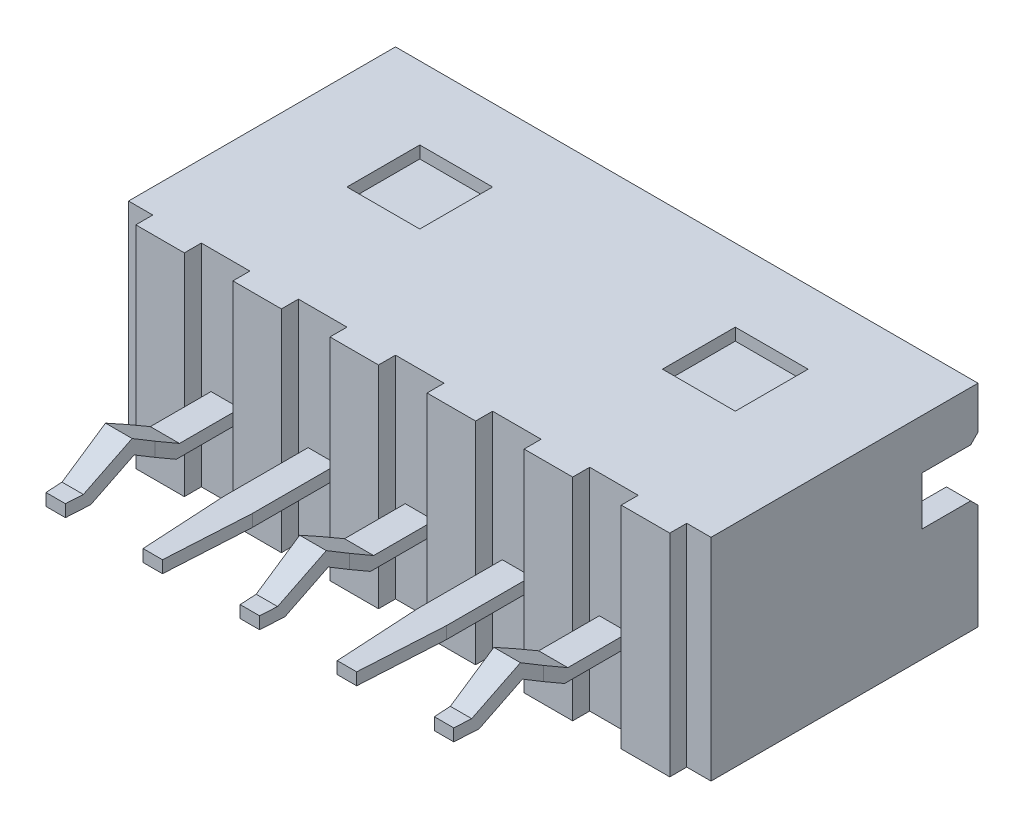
ISO-10303-21;
HEADER;
FILE_DESCRIPTION(('STEP AP214'),'2;1');
FILE_NAME('part.step','',(''),(''),'','','');
FILE_SCHEMA(('AUTOMOTIVE_DESIGN { 1 0 10303 214 1 1 1 1 }'));
ENDSEC;
DATA;
#1=APPLICATION_CONTEXT('core data for automotive mechanical design processes');
#2=APPLICATION_PROTOCOL_DEFINITION('international standard','automotive_design',2000,#1);
#3=PRODUCT_CONTEXT('',#1,'mechanical');
#4=PRODUCT('Part','Part','',(#3));
#5=PRODUCT_RELATED_PRODUCT_CATEGORY('part','',(#4));
#6=PRODUCT_DEFINITION_FORMATION('','',#4);
#7=PRODUCT_DEFINITION_CONTEXT('part definition',#1,'design');
#8=PRODUCT_DEFINITION('design','',#6,#7);
#9=PRODUCT_DEFINITION_SHAPE('','',#8);
#10=(LENGTH_UNIT() NAMED_UNIT(*) SI_UNIT(.MILLI.,.METRE.));
#11=(NAMED_UNIT(*) PLANE_ANGLE_UNIT() SI_UNIT($,.RADIAN.));
#12=(NAMED_UNIT(*) SI_UNIT($,.STERADIAN.) SOLID_ANGLE_UNIT());
#13=UNCERTAINTY_MEASURE_WITH_UNIT(LENGTH_MEASURE(1.E-05),#10,'distance_accuracy_value','');
#14=(GEOMETRIC_REPRESENTATION_CONTEXT(3) GLOBAL_UNCERTAINTY_ASSIGNED_CONTEXT((#13)) GLOBAL_UNIT_ASSIGNED_CONTEXT((#10,
#11,#12)) REPRESENTATION_CONTEXT('',''));
#15=CARTESIAN_POINT('',(0.,0.,0.));
#16=DIRECTION('',(0.,0.,1.));
#17=DIRECTION('',(1.,0.,0.));
#18=AXIS2_PLACEMENT_3D('',#15,#16,#17);
#19=CARTESIAN_POINT('',(-4.3,0.175,5.5));
#20=DIRECTION('',(-1.,0.,0.));
#21=DIRECTION('',(0.,0.,1.));
#22=AXIS2_PLACEMENT_3D('',#19,#20,#21);
#23=PLANE('',#22);
#24=DIRECTION('',(0.,0.501036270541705,0.865426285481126));
#25=VECTOR('',#24,1.);
#26=CARTESIAN_POINT('',(-4.3,-3.42408478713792,1.98236487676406));
#27=LINE('',#26,#25);
#28=CARTESIAN_POINT('',(-4.3,-0.625,6.81714769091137));
#29=VERTEX_POINT('',#28);
#30=CARTESIAN_POINT('',(-4.3,-0.374401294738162,7.25));
#31=VERTEX_POINT('',#30);
#32=EDGE_CURVE('E3653',#29,#31,#27,.T.);
#33=ORIENTED_EDGE('',*,*,#32,.T.);
#34=DIRECTION('',(0.,-1.,0.));
#35=VECTOR('',#34,1.);
#36=CARTESIAN_POINT('',(-4.3,2.17605,7.25));
#37=LINE('',#36,#35);
#38=CARTESIAN_POINT('',(-4.3,-0.0855263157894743,7.25));
#39=VERTEX_POINT('',#38);
#40=EDGE_CURVE('E3555',#39,#31,#37,.T.);
#41=ORIENTED_EDGE('',*,*,#40,.F.);
#42=DIRECTION('',(0.,-0.501036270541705,-0.865426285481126));
#43=VECTOR('',#42,1.);
#44=CARTESIAN_POINT('',(-4.3,-3.20772821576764,1.85710580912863));
#45=LINE('',#44,#43);
#46=CARTESIAN_POINT('',(-4.3,-0.375,6.75));
#47=VERTEX_POINT('',#46);
#48=EDGE_CURVE('E3670',#39,#47,#45,.T.);
#49=ORIENTED_EDGE('',*,*,#48,.T.);
#50=DIRECTION('',(0.,0.,-1.));
#51=VECTOR('',#50,1.);
#52=CARTESIAN_POINT('',(-4.3,-0.375,0.));
#53=LINE('',#52,#51);
#54=CARTESIAN_POINT('',(-4.3,-0.375,5.5));
#55=VERTEX_POINT('',#54);
#56=EDGE_CURVE('E3666',#47,#55,#53,.T.);
#57=ORIENTED_EDGE('',*,*,#56,.T.);
#58=DIRECTION('',(0.,-1.,0.));
#59=VECTOR('',#58,1.);
#60=CARTESIAN_POINT('',(-4.3,0.175,5.5));
#61=LINE('',#60,#59);
#62=CARTESIAN_POINT('',(-4.3,-0.625,5.5));
#63=VERTEX_POINT('',#62);
#64=EDGE_CURVE('E1078',#55,#63,#61,.T.);
#65=ORIENTED_EDGE('',*,*,#64,.T.);
#66=DIRECTION('',(0.,0.,-1.));
#67=VECTOR('',#66,1.);
#68=CARTESIAN_POINT('',(-4.3,-0.625,5.5));
#69=LINE('',#68,#67);
#70=EDGE_CURVE('E1067',#29,#63,#69,.T.);
#71=ORIENTED_EDGE('',*,*,#70,.F.);
#72=EDGE_LOOP('',(#33,#41,#49,#57,#65,#71));
#73=FACE_BOUND('',#72,.T.);
#74=ADVANCED_FACE('F209',(#73),#23,.T.);
#75=CARTESIAN_POINT('',(-4.3,0.175,9.));
#76=DIRECTION('',(0.,0.,1.));
#77=DIRECTION('',(1.,0.,0.));
#78=AXIS2_PLACEMENT_3D('',#75,#76,#77);
#79=PLANE('',#78);
#80=DIRECTION('',(0.,1.,0.));
#81=VECTOR('',#80,1.);
#82=CARTESIAN_POINT('',(-3.8,-2.17605,9.));
#83=LINE('',#82,#81);
#84=CARTESIAN_POINT('',(-3.8,-0.625,9.));
#85=VERTEX_POINT('',#84);
#86=CARTESIAN_POINT('',(-3.8,-0.375,9.));
#87=VERTEX_POINT('',#86);
#88=EDGE_CURVE('E3502',#85,#87,#83,.T.);
#89=ORIENTED_EDGE('',*,*,#88,.T.);
#90=DIRECTION('',(-1.,0.,0.));
#91=VECTOR('',#90,1.);
#92=CARTESIAN_POINT('',(6.001,-0.375,9.));
#93=LINE('',#92,#91);
#94=CARTESIAN_POINT('',(-4.2,-0.375,9.));
#95=VERTEX_POINT('',#94);
#96=EDGE_CURVE('E3645',#87,#95,#93,.T.);
#97=ORIENTED_EDGE('',*,*,#96,.T.);
#98=DIRECTION('',(0.,-1.,0.));
#99=VECTOR('',#98,1.);
#100=CARTESIAN_POINT('',(-4.2,-2.17605,9.));
#101=LINE('',#100,#99);
#102=CARTESIAN_POINT('',(-4.2,-0.625,9.));
#103=VERTEX_POINT('',#102);
#104=EDGE_CURVE('E3545',#95,#103,#101,.T.);
#105=ORIENTED_EDGE('',*,*,#104,.T.);
#106=DIRECTION('',(-1.,0.,0.));
#107=VECTOR('',#106,1.);
#108=CARTESIAN_POINT('',(-4.3,-0.625,9.));
#109=LINE('',#108,#107);
#110=EDGE_CURVE('E1076',#85,#103,#109,.T.);
#111=ORIENTED_EDGE('',*,*,#110,.F.);
#112=EDGE_LOOP('',(#89,#97,#105,#111));
#113=FACE_BOUND('',#112,.T.);
#114=ADVANCED_FACE('F1954',(#113),#79,.T.);
#115=CARTESIAN_POINT('',(0.,-0.625,0.));
#116=DIRECTION('',(0.,1.,0.));
#117=DIRECTION('',(0.,0.,1.));
#118=AXIS2_PLACEMENT_3D('',#115,#116,#117);
#119=PLANE('',#118);
#120=DIRECTION('',(-1.,0.,0.));
#121=VECTOR('',#120,1.);
#122=CARTESIAN_POINT('',(6.001,-0.625,8.50526315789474));
#123=LINE('',#122,#121);
#124=CARTESIAN_POINT('',(-3.77172932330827,-0.624999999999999,8.50526315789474));
#125=VERTEX_POINT('',#124);
#126=CARTESIAN_POINT('',(-4.22827067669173,-0.624999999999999,8.50526315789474));
#127=VERTEX_POINT('',#126);
#128=EDGE_CURVE('E3657',#125,#127,#123,.T.);
#129=ORIENTED_EDGE('',*,*,#128,.F.);
#130=DIRECTION('',(0.0570497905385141,0.,-0.998371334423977));
#131=VECTOR('',#130,1.);
#132=CARTESIAN_POINT('',(-3.7,-0.625,7.25));
#133=LINE('',#132,#131);
#134=EDGE_CURVE('E3497',#85,#125,#133,.T.);
#135=ORIENTED_EDGE('',*,*,#134,.F.);
#136=ORIENTED_EDGE('',*,*,#110,.T.);
#137=DIRECTION('',(0.0570497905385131,0.,0.998371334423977));
#138=VECTOR('',#137,1.);
#139=CARTESIAN_POINT('',(-4.2,-0.625,9.));
#140=LINE('',#139,#138);
#141=EDGE_CURVE('E3540',#127,#103,#140,.T.);
#142=ORIENTED_EDGE('',*,*,#141,.F.);
#143=EDGE_LOOP('',(#129,#135,#136,#142));
#144=FACE_BOUND('',#143,.T.);
#145=ADVANCED_FACE('F1960',(#144),#119,.F.);
#146=CARTESIAN_POINT('',(6.001,-3.20772821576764,1.85710580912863));
#147=DIRECTION('',(0.,0.865426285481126,-0.501036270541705));
#148=DIRECTION('',(0.,0.501036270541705,0.865426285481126));
#149=AXIS2_PLACEMENT_3D('',#146,#147,#148);
#150=PLANE('',#149);
#151=DIRECTION('',(-0.0493925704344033,0.500424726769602,0.86436998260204));
#152=VECTOR('',#151,1.);
#153=CARTESIAN_POINT('',(-3.75589997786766,0.480828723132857,8.22824961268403));
#154=LINE('',#153,#152);
#155=CARTESIAN_POINT('',(-3.7,-0.0855263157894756,7.25));
#156=VERTEX_POINT('',#155);
#157=CARTESIAN_POINT('',(-3.72571428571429,0.175000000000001,7.7));
#158=VERTEX_POINT('',#157);
#159=EDGE_CURVE('E3489',#156,#158,#154,.T.);
#160=ORIENTED_EDGE('',*,*,#159,.F.);
#161=DIRECTION('',(0.,-0.501036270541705,-0.865426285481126));
#162=VECTOR('',#161,1.);
#163=CARTESIAN_POINT('',(-3.7,-3.20772821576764,1.85710580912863));
#164=LINE('',#163,#162);
#165=CARTESIAN_POINT('',(-3.7,-0.375,6.75));
#166=VERTEX_POINT('',#165);
#167=EDGE_CURVE('E3652',#156,#166,#164,.T.);
#168=ORIENTED_EDGE('',*,*,#167,.T.);
#169=DIRECTION('',(-1.,0.,0.));
#170=VECTOR('',#169,1.);
#171=CARTESIAN_POINT('',(6.001,-0.375,6.75));
#172=LINE('',#171,#170);
#173=EDGE_CURVE('E3663',#166,#47,#172,.T.);
#174=ORIENTED_EDGE('',*,*,#173,.T.);
#175=ORIENTED_EDGE('',*,*,#48,.F.);
#176=DIRECTION('',(-0.0493925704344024,-0.500424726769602,-0.86436998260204));
#177=VECTOR('',#176,1.);
#178=CARTESIAN_POINT('',(-4.16914251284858,1.24026664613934,9.54000602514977));
#179=LINE('',#178,#177);
#180=CARTESIAN_POINT('',(-4.27428571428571,0.175000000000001,7.7));
#181=VERTEX_POINT('',#180);
#182=EDGE_CURVE('E3553',#181,#39,#179,.T.);
#183=ORIENTED_EDGE('',*,*,#182,.F.);
#184=DIRECTION('',(-1.,0.,0.));
#185=VECTOR('',#184,1.);
#186=CARTESIAN_POINT('',(6.001,0.175,7.7));
#187=LINE('',#186,#185);
#188=EDGE_CURVE('E3668',#158,#181,#187,.T.);
#189=ORIENTED_EDGE('',*,*,#188,.F.);
#190=EDGE_LOOP('',(#160,#168,#174,#175,#183,#189));
#191=FACE_BOUND('',#190,.T.);
#192=ADVANCED_FACE('F2657',(#191),#150,.T.);
#193=CARTESIAN_POINT('',(6.001,3.21986514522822,1.86413245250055));
#194=DIRECTION('',(0.,-0.865426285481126,-0.501036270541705));
#195=DIRECTION('',(0.,0.501036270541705,-0.865426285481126));
#196=AXIS2_PLACEMENT_3D('',#193,#194,#195);
#197=PLANE('',#196);
#198=DIRECTION('',(-0.0493925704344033,-0.500424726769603,0.86436998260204));
#199=VECTOR('',#198,1.);
#200=CARTESIAN_POINT('',(-3.75630052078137,-0.468681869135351,8.23525911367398));
#201=LINE('',#200,#199);
#202=CARTESIAN_POINT('',(-3.72349745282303,-0.136334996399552,7.66120542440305));
#203=VERTEX_POINT('',#202);
#204=EDGE_CURVE('E3500',#203,#125,#201,.T.);
#205=ORIENTED_EDGE('',*,*,#204,.T.);
#206=ORIENTED_EDGE('',*,*,#128,.T.);
#207=DIRECTION('',(0.0493925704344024,-0.500424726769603,0.86436998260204));
#208=VECTOR('',#207,1.);
#209=CARTESIAN_POINT('',(-4.27631397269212,-0.138245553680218,7.66450547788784));
#210=LINE('',#209,#208);
#211=CARTESIAN_POINT('',(-4.27650254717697,-0.136334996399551,7.66120542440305));
#212=VERTEX_POINT('',#211);
#213=EDGE_CURVE('E3546',#212,#127,#210,.T.);
#214=ORIENTED_EDGE('',*,*,#213,.F.);
#215=DIRECTION('',(-1.,0.,0.));
#216=VECTOR('',#215,1.);
#217=CARTESIAN_POINT('',(6.001,-0.136334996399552,7.66120542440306));
#218=LINE('',#217,#216);
#219=EDGE_CURVE('E3646',#203,#212,#218,.T.);
#220=ORIENTED_EDGE('',*,*,#219,.F.);
#221=EDGE_LOOP('',(#205,#206,#214,#220));
#222=FACE_BOUND('',#221,.T.);
#223=ADVANCED_FACE('F2649',(#222),#197,.T.);
#224=CARTESIAN_POINT('',(6.001,-3.42408478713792,1.98236487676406));
#225=DIRECTION('',(0.,-0.865426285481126,0.501036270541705));
#226=DIRECTION('',(0.,-0.501036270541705,-0.865426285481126));
#227=AXIS2_PLACEMENT_3D('',#224,#225,#226);
#228=PLANE('',#227);
#229=DIRECTION('',(0.0493925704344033,-0.500424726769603,-0.86436998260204));
#230=VECTOR('',#229,1.);
#231=CARTESIAN_POINT('',(-3.7630401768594,0.264295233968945,8.35320309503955));
#232=LINE('',#231,#230);
#233=CARTESIAN_POINT('',(-3.7,-0.374401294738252,7.24999999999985));
#234=VERTEX_POINT('',#233);
#235=EDGE_CURVE('E3492',#203,#234,#232,.T.);
#236=ORIENTED_EDGE('',*,*,#235,.F.);
#237=ORIENTED_EDGE('',*,*,#219,.T.);
#238=DIRECTION('',(0.0493925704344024,0.500424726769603,0.86436998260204));
#239=VECTOR('',#238,1.);
#240=CARTESIAN_POINT('',(-4.16200231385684,1.02373315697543,9.66495950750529));
#241=LINE('',#240,#239);
#242=EDGE_CURVE('E3549',#31,#212,#241,.T.);
#243=ORIENTED_EDGE('',*,*,#242,.F.);
#244=ORIENTED_EDGE('',*,*,#32,.F.);
#245=DIRECTION('',(-1.,0.,0.));
#246=VECTOR('',#245,1.);
#247=CARTESIAN_POINT('',(6.001,-0.625,6.81714769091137));
#248=LINE('',#247,#246);
#249=CARTESIAN_POINT('',(-3.7,-0.625,6.81714769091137));
#250=VERTEX_POINT('',#249);
#251=EDGE_CURVE('E3655',#250,#29,#248,.T.);
#252=ORIENTED_EDGE('',*,*,#251,.F.);
#253=DIRECTION('',(0.,0.501036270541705,0.865426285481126));
#254=VECTOR('',#253,1.);
#255=CARTESIAN_POINT('',(-3.7,-3.42408478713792,1.98236487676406));
#256=LINE('',#255,#254);
#257=EDGE_CURVE('E3649',#250,#234,#256,.T.);
#258=ORIENTED_EDGE('',*,*,#257,.T.);
#259=EDGE_LOOP('',(#236,#237,#243,#244,#252,#258));
#260=FACE_BOUND('',#259,.T.);
#261=ADVANCED_FACE('F2641',(#260),#228,.T.);
#262=CARTESIAN_POINT('',(6.001,3.46986514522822,2.00886929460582));
#263=DIRECTION('',(0.,0.865426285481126,0.501036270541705));
#264=DIRECTION('',(0.,-0.501036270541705,0.865426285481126));
#265=AXIS2_PLACEMENT_3D('',#262,#263,#264);
#266=PLANE('',#265);
#267=DIRECTION('',(-0.0493925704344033,-0.500424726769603,0.86436998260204));
#268=VECTOR('',#267,1.);
#269=CARTESIAN_POINT('',(-3.65697901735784,0.871396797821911,6.49713280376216));
#270=LINE('',#269,#268);
#271=CARTESIAN_POINT('',(-3.78,-0.375,8.65));
#272=VERTEX_POINT('',#271);
#273=EDGE_CURVE('E3480',#158,#272,#270,.T.);
#274=ORIENTED_EDGE('',*,*,#273,.F.);
#275=ORIENTED_EDGE('',*,*,#188,.T.);
#276=DIRECTION('',(-0.0493925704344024,0.500424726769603,-0.86436998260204));
#277=VECTOR('',#276,1.);
#278=CARTESIAN_POINT('',(-4.26806347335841,0.111958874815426,7.8088892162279));
#279=LINE('',#278,#277);
#280=CARTESIAN_POINT('',(-4.22,-0.375,8.65));
#281=VERTEX_POINT('',#280);
#282=EDGE_CURVE('E3550',#281,#181,#279,.T.);
#283=ORIENTED_EDGE('',*,*,#282,.F.);
#284=DIRECTION('',(-1.,0.,0.));
#285=VECTOR('',#284,1.);
#286=CARTESIAN_POINT('',(6.001,-0.375,8.65));
#287=LINE('',#286,#285);
#288=EDGE_CURVE('E213',#272,#281,#287,.T.);
#289=ORIENTED_EDGE('',*,*,#288,.F.);
#290=EDGE_LOOP('',(#274,#275,#283,#289));
#291=FACE_BOUND('',#290,.T.);
#292=ADVANCED_FACE('F2633',(#291),#266,.T.);
#293=CARTESIAN_POINT('',(6.001,-0.375000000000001,0.));
#294=DIRECTION('',(0.,1.,0.));
#295=DIRECTION('',(0.,0.,1.));
#296=AXIS2_PLACEMENT_3D('',#293,#294,#295);
#297=PLANE('',#296);
#298=DIRECTION('',(-0.0570497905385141,0.,0.998371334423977));
#299=VECTOR('',#298,1.);
#300=CARTESIAN_POINT('',(-3.7,-0.375,7.25));
#301=LINE('',#300,#299);
#302=EDGE_CURVE('E3491',#272,#87,#301,.T.);
#303=ORIENTED_EDGE('',*,*,#302,.F.);
#304=ORIENTED_EDGE('',*,*,#288,.T.);
#305=DIRECTION('',(-0.0570497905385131,0.,-0.998371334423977));
#306=VECTOR('',#305,1.);
#307=CARTESIAN_POINT('',(-4.2,-0.375,9.));
#308=LINE('',#307,#306);
#309=EDGE_CURVE('E3537',#95,#281,#308,.T.);
#310=ORIENTED_EDGE('',*,*,#309,.F.);
#311=ORIENTED_EDGE('',*,*,#96,.F.);
#312=EDGE_LOOP('',(#303,#304,#310,#311));
#313=FACE_BOUND('',#312,.T.);
#314=ADVANCED_FACE('F2625',(#313),#297,.T.);
#315=CARTESIAN_POINT('',(3.7,0.175,5.5));
#316=DIRECTION('',(-1.,0.,0.));
#317=DIRECTION('',(0.,0.,1.));
#318=AXIS2_PLACEMENT_3D('',#315,#316,#317);
#319=PLANE('',#318);
#320=DIRECTION('',(0.,-1.,0.));
#321=VECTOR('',#320,1.);
#322=CARTESIAN_POINT('',(3.7,2.17605,7.25));
#323=LINE('',#322,#321);
#324=CARTESIAN_POINT('',(3.7,-0.0855263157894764,7.25));
#325=VERTEX_POINT('',#324);
#326=CARTESIAN_POINT('',(3.7,-0.374401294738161,7.25));
#327=VERTEX_POINT('',#326);
#328=EDGE_CURVE('E234',#325,#327,#323,.T.);
#329=ORIENTED_EDGE('',*,*,#328,.F.);
#330=DIRECTION('',(0.,0.501036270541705,0.865426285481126));
#331=VECTOR('',#330,1.);
#332=CARTESIAN_POINT('',(3.7,-3.20772821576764,1.85710580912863));
#333=LINE('',#332,#331);
#334=CARTESIAN_POINT('',(3.7,-0.375,6.75));
#335=VERTEX_POINT('',#334);
#336=EDGE_CURVE('E3594',#335,#325,#333,.T.);
#337=ORIENTED_EDGE('',*,*,#336,.F.);
#338=DIRECTION('',(0.,0.,1.));
#339=VECTOR('',#338,1.);
#340=CARTESIAN_POINT('',(3.7,-0.375,0.));
#341=LINE('',#340,#339);
#342=CARTESIAN_POINT('',(3.7,-0.375,5.5));
#343=VERTEX_POINT('',#342);
#344=EDGE_CURVE('E3582',#343,#335,#341,.T.);
#345=ORIENTED_EDGE('',*,*,#344,.F.);
#346=DIRECTION('',(0.,-1.,0.));
#347=VECTOR('',#346,1.);
#348=CARTESIAN_POINT('',(3.7,0.175,5.5));
#349=LINE('',#348,#347);
#350=CARTESIAN_POINT('',(3.7,-0.625,5.5));
#351=VERTEX_POINT('',#350);
#352=EDGE_CURVE('E3688',#343,#351,#349,.T.);
#353=ORIENTED_EDGE('',*,*,#352,.T.);
#354=DIRECTION('',(0.,0.,-1.));
#355=VECTOR('',#354,1.);
#356=CARTESIAN_POINT('',(3.7,-0.625,5.5));
#357=LINE('',#356,#355);
#358=CARTESIAN_POINT('',(3.7,-0.625,6.81714769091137));
#359=VERTEX_POINT('',#358);
#360=EDGE_CURVE('E3674',#359,#351,#357,.T.);
#361=ORIENTED_EDGE('',*,*,#360,.F.);
#362=DIRECTION('',(0.,-0.501036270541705,-0.865426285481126));
#363=VECTOR('',#362,1.);
#364=CARTESIAN_POINT('',(3.7,-3.42408478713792,1.98236487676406));
#365=LINE('',#364,#363);
#366=EDGE_CURVE('E3577',#327,#359,#365,.T.);
#367=ORIENTED_EDGE('',*,*,#366,.F.);
#368=EDGE_LOOP('',(#329,#337,#345,#353,#361,#367));
#369=FACE_BOUND('',#368,.T.);
#370=ADVANCED_FACE('F2617',(#369),#319,.T.);
#371=CARTESIAN_POINT('',(4.3,0.175,5.5));
#372=DIRECTION('',(1.,0.,0.));
#373=DIRECTION('',(0.,0.,-1.));
#374=AXIS2_PLACEMENT_3D('',#371,#372,#373);
#375=PLANE('',#374);
#376=DIRECTION('',(0.,-1.,0.));
#377=VECTOR('',#376,1.);
#378=CARTESIAN_POINT('',(4.3,2.17605,7.25));
#379=LINE('',#378,#377);
#380=CARTESIAN_POINT('',(4.3,-0.0855263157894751,7.25));
#381=VERTEX_POINT('',#380);
#382=CARTESIAN_POINT('',(4.3,-0.374401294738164,7.25));
#383=VERTEX_POINT('',#382);
#384=EDGE_CURVE('E3426',#381,#383,#379,.T.);
#385=ORIENTED_EDGE('',*,*,#384,.T.);
#386=DIRECTION('',(0.,-0.501036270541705,-0.865426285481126));
#387=VECTOR('',#386,1.);
#388=CARTESIAN_POINT('',(4.3,-3.42408478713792,1.98236487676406));
#389=LINE('',#388,#387);
#390=CARTESIAN_POINT('',(4.3,-0.625,6.81714769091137));
#391=VERTEX_POINT('',#390);
#392=EDGE_CURVE('E3580',#383,#391,#389,.T.);
#393=ORIENTED_EDGE('',*,*,#392,.T.);
#394=DIRECTION('',(0.,0.,1.));
#395=VECTOR('',#394,1.);
#396=CARTESIAN_POINT('',(4.3,-0.625,5.5));
#397=LINE('',#396,#395);
#398=CARTESIAN_POINT('',(4.3,-0.625,5.5));
#399=VERTEX_POINT('',#398);
#400=EDGE_CURVE('E3682',#399,#391,#397,.T.);
#401=ORIENTED_EDGE('',*,*,#400,.F.);
#402=DIRECTION('',(0.,-1.,0.));
#403=VECTOR('',#402,1.);
#404=CARTESIAN_POINT('',(4.3,0.175,5.5));
#405=LINE('',#404,#403);
#406=CARTESIAN_POINT('',(4.3,-0.375,5.5));
#407=VERTEX_POINT('',#406);
#408=EDGE_CURVE('E3689',#407,#399,#405,.T.);
#409=ORIENTED_EDGE('',*,*,#408,.F.);
#410=DIRECTION('',(0.,0.,1.));
#411=VECTOR('',#410,1.);
#412=CARTESIAN_POINT('',(4.3,-0.375,0.));
#413=LINE('',#412,#411);
#414=CARTESIAN_POINT('',(4.3,-0.375,6.75));
#415=VERTEX_POINT('',#414);
#416=EDGE_CURVE('E3593',#407,#415,#413,.T.);
#417=ORIENTED_EDGE('',*,*,#416,.T.);
#418=DIRECTION('',(0.,0.501036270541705,0.865426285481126));
#419=VECTOR('',#418,1.);
#420=CARTESIAN_POINT('',(4.3,-3.20772821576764,1.85710580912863));
#421=LINE('',#420,#419);
#422=EDGE_CURVE('E3597',#415,#381,#421,.T.);
#423=ORIENTED_EDGE('',*,*,#422,.T.);
#424=EDGE_LOOP('',(#385,#393,#401,#409,#417,#423));
#425=FACE_BOUND('',#424,.T.);
#426=ADVANCED_FACE('F2610',(#425),#375,.T.);
#427=CARTESIAN_POINT('',(0.,-0.625,0.));
#428=DIRECTION('',(0.,1.,0.));
#429=DIRECTION('',(0.,0.,1.));
#430=AXIS2_PLACEMENT_3D('',#427,#428,#429);
#431=PLANE('',#430);
#432=DIRECTION('',(-1.,0.,0.));
#433=VECTOR('',#432,1.);
#434=CARTESIAN_POINT('',(3.7,-0.625,9.));
#435=LINE('',#434,#433);
#436=CARTESIAN_POINT('',(4.2,-0.625,9.));
#437=VERTEX_POINT('',#436);
#438=CARTESIAN_POINT('',(3.8,-0.625,9.));
#439=VERTEX_POINT('',#438);
#440=EDGE_CURVE('E3685',#437,#439,#435,.T.);
#441=ORIENTED_EDGE('',*,*,#440,.T.);
#442=DIRECTION('',(0.0570497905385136,0.,0.998371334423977));
#443=VECTOR('',#442,1.);
#444=CARTESIAN_POINT('',(3.7,-0.625,7.25));
#445=LINE('',#444,#443);
#446=CARTESIAN_POINT('',(3.77172932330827,-0.625,8.50526315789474));
#447=VERTEX_POINT('',#446);
#448=EDGE_CURVE('E3418',#447,#439,#445,.T.);
#449=ORIENTED_EDGE('',*,*,#448,.F.);
#450=DIRECTION('',(1.,0.,0.));
#451=VECTOR('',#450,1.);
#452=CARTESIAN_POINT('',(-6.001025,-0.625,8.50526315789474));
#453=LINE('',#452,#451);
#454=CARTESIAN_POINT('',(4.22827067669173,-0.625,8.50526315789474));
#455=VERTEX_POINT('',#454);
#456=EDGE_CURVE('E3585',#447,#455,#453,.T.);
#457=ORIENTED_EDGE('',*,*,#456,.T.);
#458=DIRECTION('',(0.0570497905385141,0.,-0.998371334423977));
#459=VECTOR('',#458,1.);
#460=CARTESIAN_POINT('',(4.2,-0.625,9.));
#461=LINE('',#460,#459);
#462=EDGE_CURVE('E3440',#437,#455,#461,.T.);
#463=ORIENTED_EDGE('',*,*,#462,.F.);
#464=EDGE_LOOP('',(#441,#449,#457,#463));
#465=FACE_BOUND('',#464,.T.);
#466=ADVANCED_FACE('F2603',(#465),#431,.F.);
#467=DIRECTION('',(1.,0.,0.));
#468=VECTOR('',#467,1.);
#469=CARTESIAN_POINT('',(-6.001025,-0.625,6.81714769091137));
#470=LINE('',#469,#468);
#471=EDGE_CURVE('E3587',#359,#391,#470,.T.);
#472=ORIENTED_EDGE('',*,*,#471,.F.);
#473=ORIENTED_EDGE('',*,*,#360,.T.);
#474=DIRECTION('',(1.,0.,0.));
#475=VECTOR('',#474,1.);
#476=CARTESIAN_POINT('',(3.7,-0.625,5.5));
#477=LINE('',#476,#475);
#478=EDGE_CURVE('E3679',#351,#399,#477,.T.);
#479=ORIENTED_EDGE('',*,*,#478,.T.);
#480=ORIENTED_EDGE('',*,*,#400,.T.);
#481=EDGE_LOOP('',(#472,#473,#479,#480));
#482=FACE_BOUND('',#481,.T.);
#483=ADVANCED_FACE('F2595',(#482),#431,.F.);
#484=CARTESIAN_POINT('',(3.7,0.175,9.));
#485=DIRECTION('',(0.,0.,1.));
#486=DIRECTION('',(1.,0.,0.));
#487=AXIS2_PLACEMENT_3D('',#484,#485,#486);
#488=PLANE('',#487);
#489=DIRECTION('',(0.,-1.,0.));
#490=VECTOR('',#489,1.);
#491=CARTESIAN_POINT('',(3.8,-2.17605,9.));
#492=LINE('',#491,#490);
#493=CARTESIAN_POINT('',(3.8,-0.375,9.));
#494=VERTEX_POINT('',#493);
#495=EDGE_CURVE('E3421',#494,#439,#492,.T.);
#496=ORIENTED_EDGE('',*,*,#495,.T.);
#497=ORIENTED_EDGE('',*,*,#440,.F.);
#498=DIRECTION('',(0.,1.,0.));
#499=VECTOR('',#498,1.);
#500=CARTESIAN_POINT('',(4.2,-2.17605,9.));
#501=LINE('',#500,#499);
#502=CARTESIAN_POINT('',(4.2,-0.375,9.));
#503=VERTEX_POINT('',#502);
#504=EDGE_CURVE('E3439',#437,#503,#501,.T.);
#505=ORIENTED_EDGE('',*,*,#504,.T.);
#506=DIRECTION('',(1.,0.,0.));
#507=VECTOR('',#506,1.);
#508=CARTESIAN_POINT('',(-6.001025,-0.375,9.));
#509=LINE('',#508,#507);
#510=EDGE_CURVE('E3610',#494,#503,#509,.T.);
#511=ORIENTED_EDGE('',*,*,#510,.F.);
#512=EDGE_LOOP('',(#496,#497,#505,#511));
#513=FACE_BOUND('',#512,.T.);
#514=ADVANCED_FACE('F2587',(#513),#488,.T.);
#515=CARTESIAN_POINT('',(-0.3,0.175,5.5));
#516=DIRECTION('',(-1.,0.,0.));
#517=DIRECTION('',(0.,0.,1.));
#518=AXIS2_PLACEMENT_3D('',#515,#516,#517);
#519=PLANE('',#518);
#520=DIRECTION('',(0.,-1.,0.));
#521=VECTOR('',#520,1.);
#522=CARTESIAN_POINT('',(-0.3,2.17605,7.25));
#523=LINE('',#522,#521);
#524=CARTESIAN_POINT('',(-0.3,-0.0855263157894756,7.25));
#525=VERTEX_POINT('',#524);
#526=CARTESIAN_POINT('',(-0.3,-0.374401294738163,7.25));
#527=VERTEX_POINT('',#526);
#528=EDGE_CURVE('E3454',#525,#527,#523,.T.);
#529=ORIENTED_EDGE('',*,*,#528,.F.);
#530=DIRECTION('',(0.,0.501036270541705,0.865426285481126));
#531=VECTOR('',#530,1.);
#532=CARTESIAN_POINT('',(-0.3,-3.20772821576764,1.85710580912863));
#533=LINE('',#532,#531);
#534=CARTESIAN_POINT('',(-0.299999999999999,-0.375,6.75));
#535=VERTEX_POINT('',#534);
#536=EDGE_CURVE('E3627',#535,#525,#533,.T.);
#537=ORIENTED_EDGE('',*,*,#536,.F.);
#538=DIRECTION('',(0.,0.,1.));
#539=VECTOR('',#538,1.);
#540=CARTESIAN_POINT('',(-0.3,-0.375,0.));
#541=LINE('',#540,#539);
#542=CARTESIAN_POINT('',(-0.3,-0.375,5.5));
#543=VERTEX_POINT('',#542);
#544=EDGE_CURVE('E3615',#543,#535,#541,.T.);
#545=ORIENTED_EDGE('',*,*,#544,.F.);
#546=DIRECTION('',(0.,-1.,0.));
#547=VECTOR('',#546,1.);
#548=CARTESIAN_POINT('',(-0.3,0.175,5.5));
#549=LINE('',#548,#547);
#550=CARTESIAN_POINT('',(-0.3,-0.625,5.5));
#551=VERTEX_POINT('',#550);
#552=EDGE_CURVE('E1058',#543,#551,#549,.T.);
#553=ORIENTED_EDGE('',*,*,#552,.T.);
#554=DIRECTION('',(0.,0.,-1.));
#555=VECTOR('',#554,1.);
#556=CARTESIAN_POINT('',(-0.3,-0.625,5.5));
#557=LINE('',#556,#555);
#558=CARTESIAN_POINT('',(-0.3,-0.625,6.81714769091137));
#559=VERTEX_POINT('',#558);
#560=EDGE_CURVE('E3706',#559,#551,#557,.T.);
#561=ORIENTED_EDGE('',*,*,#560,.F.);
#562=DIRECTION('',(0.,-0.501036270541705,-0.865426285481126));
#563=VECTOR('',#562,1.);
#564=CARTESIAN_POINT('',(-0.300000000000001,-3.42408478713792,1.98236487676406));
#565=LINE('',#564,#563);
#566=EDGE_CURVE('E3609',#527,#559,#565,.T.);
#567=ORIENTED_EDGE('',*,*,#566,.F.);
#568=EDGE_LOOP('',(#529,#537,#545,#553,#561,#567));
#569=FACE_BOUND('',#568,.T.);
#570=ADVANCED_FACE('F2579',(#569),#519,.T.);
#571=CARTESIAN_POINT('',(0.3,0.175,5.5));
#572=DIRECTION('',(1.,0.,0.));
#573=DIRECTION('',(0.,0.,-1.));
#574=AXIS2_PLACEMENT_3D('',#571,#572,#573);
#575=PLANE('',#574);
#576=DIRECTION('',(0.,1.,0.));
#577=VECTOR('',#576,1.);
#578=CARTESIAN_POINT('',(0.3,2.17605,7.25));
#579=LINE('',#578,#577);
#580=CARTESIAN_POINT('',(0.3,-0.374401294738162,7.25));
#581=VERTEX_POINT('',#580);
#582=CARTESIAN_POINT('',(0.3,-0.0855263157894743,7.25));
#583=VERTEX_POINT('',#582);
#584=EDGE_CURVE('E3473',#581,#583,#579,.T.);
#585=ORIENTED_EDGE('',*,*,#584,.F.);
#586=DIRECTION('',(0.,-0.501036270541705,-0.865426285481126));
#587=VECTOR('',#586,1.);
#588=CARTESIAN_POINT('',(0.3,-3.42408478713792,1.98236487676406));
#589=LINE('',#588,#587);
#590=CARTESIAN_POINT('',(0.3,-0.625,6.81714769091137));
#591=VERTEX_POINT('',#590);
#592=EDGE_CURVE('E3613',#581,#591,#589,.T.);
#593=ORIENTED_EDGE('',*,*,#592,.T.);
#594=DIRECTION('',(0.,0.,1.));
#595=VECTOR('',#594,1.);
#596=CARTESIAN_POINT('',(0.3,-0.625,5.5));
#597=LINE('',#596,#595);
#598=CARTESIAN_POINT('',(0.3,-0.625,5.5));
#599=VERTEX_POINT('',#598);
#600=EDGE_CURVE('E3713',#599,#591,#597,.T.);
#601=ORIENTED_EDGE('',*,*,#600,.F.);
#602=DIRECTION('',(0.,-1.,0.));
#603=VECTOR('',#602,1.);
#604=CARTESIAN_POINT('',(0.3,0.175,5.5));
#605=LINE('',#604,#603);
#606=CARTESIAN_POINT('',(0.3,-0.375,5.5));
#607=VERTEX_POINT('',#606);
#608=EDGE_CURVE('E1054',#607,#599,#605,.T.);
#609=ORIENTED_EDGE('',*,*,#608,.F.);
#610=DIRECTION('',(0.,0.,1.));
#611=VECTOR('',#610,1.);
#612=CARTESIAN_POINT('',(0.3,-0.375,0.));
#613=LINE('',#612,#611);
#614=CARTESIAN_POINT('',(0.3,-0.375,6.75));
#615=VERTEX_POINT('',#614);
#616=EDGE_CURVE('E3626',#607,#615,#613,.T.);
#617=ORIENTED_EDGE('',*,*,#616,.T.);
#618=DIRECTION('',(0.,0.501036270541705,0.865426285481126));
#619=VECTOR('',#618,1.);
#620=CARTESIAN_POINT('',(0.3,-3.20772821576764,1.85710580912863));
#621=LINE('',#620,#619);
#622=EDGE_CURVE('E3630',#615,#583,#621,.T.);
#623=ORIENTED_EDGE('',*,*,#622,.T.);
#624=EDGE_LOOP('',(#585,#593,#601,#609,#617,#623));
#625=FACE_BOUND('',#624,.T.);
#626=ADVANCED_FACE('F2572',(#625),#575,.T.);
#627=CARTESIAN_POINT('',(0.,-0.625,0.));
#628=DIRECTION('',(0.,1.,0.));
#629=DIRECTION('',(0.,0.,1.));
#630=AXIS2_PLACEMENT_3D('',#627,#628,#629);
#631=PLANE('',#630);
#632=DIRECTION('',(-1.,0.,0.));
#633=VECTOR('',#632,1.);
#634=CARTESIAN_POINT('',(-0.299999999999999,-0.625,9.));
#635=LINE('',#634,#633);
#636=CARTESIAN_POINT('',(0.199999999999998,-0.625,9.));
#637=VERTEX_POINT('',#636);
#638=CARTESIAN_POINT('',(-0.199999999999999,-0.625,9.));
#639=VERTEX_POINT('',#638);
#640=EDGE_CURVE('E3716',#637,#639,#635,.T.);
#641=ORIENTED_EDGE('',*,*,#640,.T.);
#642=DIRECTION('',(0.0570497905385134,0.,0.998371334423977));
#643=VECTOR('',#642,1.);
#644=CARTESIAN_POINT('',(-0.3,-0.625,7.25));
#645=LINE('',#644,#643);
#646=CARTESIAN_POINT('',(-0.228270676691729,-0.625,8.50526315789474));
#647=VERTEX_POINT('',#646);
#648=EDGE_CURVE('E3459',#647,#639,#645,.T.);
#649=ORIENTED_EDGE('',*,*,#648,.F.);
#650=DIRECTION('',(1.,0.,0.));
#651=VECTOR('',#650,1.);
#652=CARTESIAN_POINT('',(-6.001025,-0.625,8.50526315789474));
#653=LINE('',#652,#651);
#654=CARTESIAN_POINT('',(0.228270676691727,-0.625,8.50526315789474));
#655=VERTEX_POINT('',#654);
#656=EDGE_CURVE('E3618',#647,#655,#653,.T.);
#657=ORIENTED_EDGE('',*,*,#656,.T.);
#658=DIRECTION('',(0.0570497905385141,0.,-0.998371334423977));
#659=VECTOR('',#658,1.);
#660=CARTESIAN_POINT('',(0.199999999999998,-0.625,9.));
#661=LINE('',#660,#659);
#662=EDGE_CURVE('E3477',#637,#655,#661,.T.);
#663=ORIENTED_EDGE('',*,*,#662,.F.);
#664=EDGE_LOOP('',(#641,#649,#657,#663));
#665=FACE_BOUND('',#664,.T.);
#666=ADVANCED_FACE('F2565',(#665),#631,.F.);
#667=DIRECTION('',(1.,0.,0.));
#668=VECTOR('',#667,1.);
#669=CARTESIAN_POINT('',(-6.001025,-0.625,6.81714769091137));
#670=LINE('',#669,#668);
#671=EDGE_CURVE('E3619',#559,#591,#670,.T.);
#672=ORIENTED_EDGE('',*,*,#671,.F.);
#673=ORIENTED_EDGE('',*,*,#560,.T.);
#674=DIRECTION('',(1.,0.,0.));
#675=VECTOR('',#674,1.);
#676=CARTESIAN_POINT('',(-0.3,-0.625,5.5));
#677=LINE('',#676,#675);
#678=EDGE_CURVE('E3710',#551,#599,#677,.T.);
#679=ORIENTED_EDGE('',*,*,#678,.T.);
#680=ORIENTED_EDGE('',*,*,#600,.T.);
#681=EDGE_LOOP('',(#672,#673,#679,#680));
#682=FACE_BOUND('',#681,.T.);
#683=ADVANCED_FACE('F2557',(#682),#631,.F.);
#684=CARTESIAN_POINT('',(-0.299999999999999,0.175,9.));
#685=DIRECTION('',(0.,0.,1.));
#686=DIRECTION('',(1.,0.,0.));
#687=AXIS2_PLACEMENT_3D('',#684,#685,#686);
#688=PLANE('',#687);
#689=DIRECTION('',(0.,-1.,0.));
#690=VECTOR('',#689,1.);
#691=CARTESIAN_POINT('',(-0.199999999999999,-2.17605,9.));
#692=LINE('',#691,#690);
#693=CARTESIAN_POINT('',(-0.199999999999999,-0.375,9.));
#694=VERTEX_POINT('',#693);
#695=EDGE_CURVE('E3462',#694,#639,#692,.T.);
#696=ORIENTED_EDGE('',*,*,#695,.T.);
#697=ORIENTED_EDGE('',*,*,#640,.F.);
#698=DIRECTION('',(0.,1.,0.));
#699=VECTOR('',#698,1.);
#700=CARTESIAN_POINT('',(0.199999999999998,-2.17605,9.));
#701=LINE('',#700,#699);
#702=CARTESIAN_POINT('',(0.199999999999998,-0.375,9.));
#703=VERTEX_POINT('',#702);
#704=EDGE_CURVE('E3484',#637,#703,#701,.T.);
#705=ORIENTED_EDGE('',*,*,#704,.T.);
#706=DIRECTION('',(1.,0.,0.));
#707=VECTOR('',#706,1.);
#708=CARTESIAN_POINT('',(-6.001025,-0.375,9.));
#709=LINE('',#708,#707);
#710=EDGE_CURVE('E3640',#694,#703,#709,.T.);
#711=ORIENTED_EDGE('',*,*,#710,.F.);
#712=EDGE_LOOP('',(#696,#697,#705,#711));
#713=FACE_BOUND('',#712,.T.);
#714=ADVANCED_FACE('F2549',(#713),#688,.T.);
#715=CARTESIAN_POINT('',(-3.7,0.175,5.5));
#716=DIRECTION('',(1.,0.,0.));
#717=DIRECTION('',(0.,0.,-1.));
#718=AXIS2_PLACEMENT_3D('',#715,#716,#717);
#719=PLANE('',#718);
#720=DIRECTION('',(0.,1.,0.));
#721=VECTOR('',#720,1.);
#722=CARTESIAN_POINT('',(-3.7,2.17605,7.25000000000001));
#723=LINE('',#722,#721);
#724=EDGE_CURVE('E3494',#234,#156,#723,.T.);
#725=ORIENTED_EDGE('',*,*,#724,.F.);
#726=ORIENTED_EDGE('',*,*,#257,.F.);
#727=DIRECTION('',(0.,0.,1.));
#728=VECTOR('',#727,1.);
#729=CARTESIAN_POINT('',(-3.7,-0.625,5.5));
#730=LINE('',#729,#728);
#731=CARTESIAN_POINT('',(-3.7,-0.625,5.5));
#732=VERTEX_POINT('',#731);
#733=EDGE_CURVE('E1073',#732,#250,#730,.T.);
#734=ORIENTED_EDGE('',*,*,#733,.F.);
#735=DIRECTION('',(0.,-1.,0.));
#736=VECTOR('',#735,1.);
#737=CARTESIAN_POINT('',(-3.7,0.175,5.5));
#738=LINE('',#737,#736);
#739=CARTESIAN_POINT('',(-3.7,-0.375,5.5));
#740=VERTEX_POINT('',#739);
#741=EDGE_CURVE('E1079',#740,#732,#738,.T.);
#742=ORIENTED_EDGE('',*,*,#741,.F.);
#743=DIRECTION('',(0.,0.,-1.));
#744=VECTOR('',#743,1.);
#745=CARTESIAN_POINT('',(-3.7,-0.375,0.));
#746=LINE('',#745,#744);
#747=EDGE_CURVE('E3662',#166,#740,#746,.T.);
#748=ORIENTED_EDGE('',*,*,#747,.F.);
#749=ORIENTED_EDGE('',*,*,#167,.F.);
#750=EDGE_LOOP('',(#725,#726,#734,#742,#748,#749));
#751=FACE_BOUND('',#750,.T.);
#752=ADVANCED_FACE('F1966',(#751),#719,.T.);
#753=ORIENTED_EDGE('',*,*,#251,.T.);
#754=ORIENTED_EDGE('',*,*,#70,.T.);
#755=DIRECTION('',(1.,0.,0.));
#756=VECTOR('',#755,1.);
#757=CARTESIAN_POINT('',(-4.3,-0.625,5.5));
#758=LINE('',#757,#756);
#759=EDGE_CURVE('E1070',#63,#732,#758,.T.);
#760=ORIENTED_EDGE('',*,*,#759,.T.);
#761=ORIENTED_EDGE('',*,*,#733,.T.);
#762=EDGE_LOOP('',(#753,#754,#760,#761));
#763=FACE_BOUND('',#762,.T.);
#764=ADVANCED_FACE('F2535',(#763),#119,.F.);
#765=CARTESIAN_POINT('',(0.,0.,0.));
#766=DIRECTION('',(0.,0.,1.));
#767=DIRECTION('',(1.,0.,0.));
#768=AXIS2_PLACEMENT_3D('',#765,#766,#767);
#769=PLANE('',#768);
#770=DIRECTION('',(0.,-1.,0.));
#771=VECTOR('',#770,1.);
#772=CARTESIAN_POINT('',(-5.5,1.675,0.));
#773=LINE('',#772,#771);
#774=CARTESIAN_POINT('',(-5.5,1.675,0.));
#775=VERTEX_POINT('',#774);
#776=CARTESIAN_POINT('',(-5.5,1.3,0.));
#777=VERTEX_POINT('',#776);
#778=EDGE_CURVE('E1740',#775,#777,#773,.T.);
#779=ORIENTED_EDGE('',*,*,#778,.T.);
#780=DIRECTION('',(-1.,0.,0.));
#781=VECTOR('',#780,1.);
#782=CARTESIAN_POINT('',(-5.5,1.3,0.));
#783=LINE('',#782,#781);
#784=CARTESIAN_POINT('',(-6.,1.3,0.));
#785=VERTEX_POINT('',#784);
#786=EDGE_CURVE('E1140',#777,#785,#783,.T.);
#787=ORIENTED_EDGE('',*,*,#786,.T.);
#788=DIRECTION('',(0.,-1.,0.));
#789=VECTOR('',#788,1.);
#790=CARTESIAN_POINT('',(-6.,2.175,0.));
#791=LINE('',#790,#789);
#792=CARTESIAN_POINT('',(-6.,2.175,0.));
#793=VERTEX_POINT('',#792);
#794=EDGE_CURVE('E1699',#793,#785,#791,.T.);
#795=ORIENTED_EDGE('',*,*,#794,.F.);
#796=DIRECTION('',(-1.,0.,0.));
#797=VECTOR('',#796,1.);
#798=CARTESIAN_POINT('',(-6.,2.175,0.));
#799=LINE('',#798,#797);
#800=CARTESIAN_POINT('',(6.,2.175,0.));
#801=VERTEX_POINT('',#800);
#802=EDGE_CURVE('E1670',#801,#793,#799,.T.);
#803=ORIENTED_EDGE('',*,*,#802,.F.);
#804=DIRECTION('',(0.,1.,0.));
#805=VECTOR('',#804,1.);
#806=CARTESIAN_POINT('',(6.,2.175,0.));
#807=LINE('',#806,#805);
#808=CARTESIAN_POINT('',(6.,1.3,0.));
#809=VERTEX_POINT('',#808);
#810=EDGE_CURVE('E1696',#809,#801,#807,.T.);
#811=ORIENTED_EDGE('',*,*,#810,.F.);
#812=DIRECTION('',(1.,0.,0.));
#813=VECTOR('',#812,1.);
#814=CARTESIAN_POINT('',(5.5,1.3,0.));
#815=LINE('',#814,#813);
#816=CARTESIAN_POINT('',(5.5,1.3,0.));
#817=VERTEX_POINT('',#816);
#818=EDGE_CURVE('E1169',#817,#809,#815,.T.);
#819=ORIENTED_EDGE('',*,*,#818,.F.);
#820=DIRECTION('',(0.,1.,0.));
#821=VECTOR('',#820,1.);
#822=CARTESIAN_POINT('',(5.5,-1.175,0.));
#823=LINE('',#822,#821);
#824=CARTESIAN_POINT('',(5.5,1.675,0.));
#825=VERTEX_POINT('',#824);
#826=EDGE_CURVE('E1724',#817,#825,#823,.T.);
#827=ORIENTED_EDGE('',*,*,#826,.T.);
#828=DIRECTION('',(-1.,0.,0.));
#829=VECTOR('',#828,1.);
#830=CARTESIAN_POINT('',(-5.5,1.675,0.));
#831=LINE('',#830,#829);
#832=EDGE_CURVE('E1744',#825,#775,#831,.T.);
#833=ORIENTED_EDGE('',*,*,#832,.T.);
#834=EDGE_LOOP('',(#779,#787,#795,#803,#811,#819,#827,#833));
#835=FACE_BOUND('',#834,.T.);
#836=ADVANCED_FACE('F1777',(#835),#769,.F.);
#837=CARTESIAN_POINT('',(0.,0.,2.85));
#838=DIRECTION('',(0.,0.,1.));
#839=DIRECTION('',(1.,0.,0.));
#840=AXIS2_PLACEMENT_3D('',#837,#838,#839);
#841=PLANE('',#840);
#842=DIRECTION('',(1.,0.,0.));
#843=VECTOR('',#842,1.);
#844=CARTESIAN_POINT('',(-1.85,0.75,2.85));
#845=LINE('',#844,#843);
#846=CARTESIAN_POINT('',(-2.15,0.75,2.85));
#847=VERTEX_POINT('',#846);
#848=CARTESIAN_POINT('',(-1.85,0.75,2.85));
#849=VERTEX_POINT('',#848);
#850=EDGE_CURVE('E1307',#847,#849,#845,.T.);
#851=ORIENTED_EDGE('',*,*,#850,.F.);
#852=DIRECTION('',(0.,1.,0.));
#853=VECTOR('',#852,1.);
#854=CARTESIAN_POINT('',(-2.15,0.75,2.85));
#855=LINE('',#854,#853);
#856=CARTESIAN_POINT('',(-2.15,-0.75,2.85));
#857=VERTEX_POINT('',#856);
#858=EDGE_CURVE('E1304',#857,#847,#855,.T.);
#859=ORIENTED_EDGE('',*,*,#858,.F.);
#860=DIRECTION('',(-1.,0.,0.));
#861=VECTOR('',#860,1.);
#862=CARTESIAN_POINT('',(-1.85,-0.75,2.85));
#863=LINE('',#862,#861);
#864=CARTESIAN_POINT('',(-1.85,-0.75,2.85));
#865=VERTEX_POINT('',#864);
#866=EDGE_CURVE('E1301',#865,#857,#863,.T.);
#867=ORIENTED_EDGE('',*,*,#866,.F.);
#868=DIRECTION('',(0.,-1.,0.));
#869=VECTOR('',#868,1.);
#870=CARTESIAN_POINT('',(-1.85,0.75,2.85));
#871=LINE('',#870,#869);
#872=EDGE_CURVE('E1268',#849,#865,#871,.T.);
#873=ORIENTED_EDGE('',*,*,#872,.F.);
#874=EDGE_LOOP('',(#851,#859,#867,#873));
#875=FACE_BOUND('',#874,.T.);
#876=DIRECTION('',(1.,0.,0.));
#877=VECTOR('',#876,1.);
#878=CARTESIAN_POINT('',(2.15,0.75,2.85));
#879=LINE('',#878,#877);
#880=CARTESIAN_POINT('',(1.85,0.75,2.85));
#881=VERTEX_POINT('',#880);
#882=CARTESIAN_POINT('',(2.15,0.75,2.85));
#883=VERTEX_POINT('',#882);
#884=EDGE_CURVE('E1367',#881,#883,#879,.T.);
#885=ORIENTED_EDGE('',*,*,#884,.F.);
#886=DIRECTION('',(0.,1.,0.));
#887=VECTOR('',#886,1.);
#888=CARTESIAN_POINT('',(1.85,0.75,2.85));
#889=LINE('',#888,#887);
#890=CARTESIAN_POINT('',(1.85,-0.75,2.85));
#891=VERTEX_POINT('',#890);
#892=EDGE_CURVE('E1364',#891,#881,#889,.T.);
#893=ORIENTED_EDGE('',*,*,#892,.F.);
#894=DIRECTION('',(-1.,0.,0.));
#895=VECTOR('',#894,1.);
#896=CARTESIAN_POINT('',(2.15,-0.75,2.85));
#897=LINE('',#896,#895);
#898=CARTESIAN_POINT('',(2.15,-0.75,2.85));
#899=VERTEX_POINT('',#898);
#900=EDGE_CURVE('E1361',#899,#891,#897,.T.);
#901=ORIENTED_EDGE('',*,*,#900,.F.);
#902=DIRECTION('',(0.,-1.,0.));
#903=VECTOR('',#902,1.);
#904=CARTESIAN_POINT('',(2.15,0.75,2.85));
#905=LINE('',#904,#903);
#906=EDGE_CURVE('E1328',#883,#899,#905,.T.);
#907=ORIENTED_EDGE('',*,*,#906,.F.);
#908=EDGE_LOOP('',(#885,#893,#901,#907));
#909=FACE_BOUND('',#908,.T.);
#910=DIRECTION('',(-1.,0.,0.));
#911=VECTOR('',#910,1.);
#912=CARTESIAN_POINT('',(-5.5,1.675,2.85));
#913=LINE('',#912,#911);
#914=CARTESIAN_POINT('',(5.5,1.675,2.85));
#915=VERTEX_POINT('',#914);
#916=CARTESIAN_POINT('',(-5.5,1.675,2.85));
#917=VERTEX_POINT('',#916);
#918=EDGE_CURVE('E1594',#915,#917,#913,.T.);
#919=ORIENTED_EDGE('',*,*,#918,.F.);
#920=DIRECTION('',(0.,1.,0.));
#921=VECTOR('',#920,1.);
#922=CARTESIAN_POINT('',(5.5,-1.175,2.85));
#923=LINE('',#922,#921);
#924=CARTESIAN_POINT('',(5.5,-1.175,2.85));
#925=VERTEX_POINT('',#924);
#926=EDGE_CURVE('E1720',#925,#915,#923,.T.);
#927=ORIENTED_EDGE('',*,*,#926,.F.);
#928=DIRECTION('',(1.,0.,0.));
#929=VECTOR('',#928,1.);
#930=CARTESIAN_POINT('',(5.25,-1.175,2.85));
#931=LINE('',#930,#929);
#932=CARTESIAN_POINT('',(5.25,-1.175,2.85));
#933=VERTEX_POINT('',#932);
#934=EDGE_CURVE('E1749',#933,#925,#931,.T.);
#935=ORIENTED_EDGE('',*,*,#934,.F.);
#936=DIRECTION('',(0.447213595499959,0.894427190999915,0.));
#937=VECTOR('',#936,1.);
#938=CARTESIAN_POINT('',(5.,-1.675,2.85));
#939=LINE('',#938,#937);
#940=CARTESIAN_POINT('',(5.,-1.675,2.85));
#941=VERTEX_POINT('',#940);
#942=EDGE_CURVE('E1752',#941,#933,#939,.T.);
#943=ORIENTED_EDGE('',*,*,#942,.F.);
#944=DIRECTION('',(1.,0.,0.));
#945=VECTOR('',#944,1.);
#946=CARTESIAN_POINT('',(-5.,-1.675,2.85));
#947=LINE('',#946,#945);
#948=CARTESIAN_POINT('',(-5.,-1.675,2.85));
#949=VERTEX_POINT('',#948);
#950=EDGE_CURVE('E1755',#949,#941,#947,.T.);
#951=ORIENTED_EDGE('',*,*,#950,.F.);
#952=DIRECTION('',(0.447213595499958,-0.894427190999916,0.));
#953=VECTOR('',#952,1.);
#954=CARTESIAN_POINT('',(-5.25,-1.175,2.85));
#955=LINE('',#954,#953);
#956=CARTESIAN_POINT('',(-5.25,-1.175,2.85));
#957=VERTEX_POINT('',#956);
#958=EDGE_CURVE('E1758',#957,#949,#955,.T.);
#959=ORIENTED_EDGE('',*,*,#958,.F.);
#960=DIRECTION('',(1.,0.,0.));
#961=VECTOR('',#960,1.);
#962=CARTESIAN_POINT('',(-5.5,-1.175,2.85));
#963=LINE('',#962,#961);
#964=CARTESIAN_POINT('',(-5.5,-1.175,2.85));
#965=VERTEX_POINT('',#964);
#966=EDGE_CURVE('E1761',#965,#957,#963,.T.);
#967=ORIENTED_EDGE('',*,*,#966,.F.);
#968=DIRECTION('',(0.,-1.,0.));
#969=VECTOR('',#968,1.);
#970=CARTESIAN_POINT('',(-5.5,1.675,2.85));
#971=LINE('',#970,#969);
#972=EDGE_CURVE('E1763',#917,#965,#971,.T.);
#973=ORIENTED_EDGE('',*,*,#972,.F.);
#974=EDGE_LOOP('',(#919,#927,#935,#943,#951,#959,#967,#973));
#975=FACE_BOUND('',#974,.T.);
#976=DIRECTION('',(1.,0.,0.));
#977=VECTOR('',#976,1.);
#978=CARTESIAN_POINT('',(4.15,0.75,2.85));
#979=LINE('',#978,#977);
#980=CARTESIAN_POINT('',(3.85,0.75,2.85));
#981=VERTEX_POINT('',#980);
#982=CARTESIAN_POINT('',(4.15,0.75,2.85));
#983=VERTEX_POINT('',#982);
#984=EDGE_CURVE('E1397',#981,#983,#979,.T.);
#985=ORIENTED_EDGE('',*,*,#984,.F.);
#986=DIRECTION('',(0.,1.,0.));
#987=VECTOR('',#986,1.);
#988=CARTESIAN_POINT('',(3.85,0.75,2.85));
#989=LINE('',#988,#987);
#990=CARTESIAN_POINT('',(3.85,-0.75,2.85));
#991=VERTEX_POINT('',#990);
#992=EDGE_CURVE('E1394',#991,#981,#989,.T.);
#993=ORIENTED_EDGE('',*,*,#992,.F.);
#994=DIRECTION('',(-1.,0.,0.));
#995=VECTOR('',#994,1.);
#996=CARTESIAN_POINT('',(4.15,-0.75,2.85));
#997=LINE('',#996,#995);
#998=CARTESIAN_POINT('',(4.15,-0.75,2.85));
#999=VERTEX_POINT('',#998);
#1000=EDGE_CURVE('E1391',#999,#991,#997,.T.);
#1001=ORIENTED_EDGE('',*,*,#1000,.F.);
#1002=DIRECTION('',(0.,-1.,0.));
#1003=VECTOR('',#1002,1.);
#1004=CARTESIAN_POINT('',(4.15,0.75,2.85));
#1005=LINE('',#1004,#1003);
#1006=EDGE_CURVE('E1358',#983,#999,#1005,.T.);
#1007=ORIENTED_EDGE('',*,*,#1006,.F.);
#1008=EDGE_LOOP('',(#985,#993,#1001,#1007));
#1009=FACE_BOUND('',#1008,.T.);
#1010=DIRECTION('',(1.,0.,0.));
#1011=VECTOR('',#1010,1.);
#1012=CARTESIAN_POINT('',(0.15,0.75,2.85));
#1013=LINE('',#1012,#1011);
#1014=CARTESIAN_POINT('',(-0.15,0.75,2.85));
#1015=VERTEX_POINT('',#1014);
#1016=CARTESIAN_POINT('',(0.15,0.75,2.85));
#1017=VERTEX_POINT('',#1016);
#1018=EDGE_CURVE('E1337',#1015,#1017,#1013,.T.);
#1019=ORIENTED_EDGE('',*,*,#1018,.F.);
#1020=DIRECTION('',(0.,1.,0.));
#1021=VECTOR('',#1020,1.);
#1022=CARTESIAN_POINT('',(-0.15,0.75,2.85));
#1023=LINE('',#1022,#1021);
#1024=CARTESIAN_POINT('',(-0.15,-0.75,2.85));
#1025=VERTEX_POINT('',#1024);
#1026=EDGE_CURVE('E1334',#1025,#1015,#1023,.T.);
#1027=ORIENTED_EDGE('',*,*,#1026,.F.);
#1028=DIRECTION('',(-1.,0.,0.));
#1029=VECTOR('',#1028,1.);
#1030=CARTESIAN_POINT('',(0.15,-0.75,2.85));
#1031=LINE('',#1030,#1029);
#1032=CARTESIAN_POINT('',(0.15,-0.75,2.85));
#1033=VERTEX_POINT('',#1032);
#1034=EDGE_CURVE('E1331',#1033,#1025,#1031,.T.);
#1035=ORIENTED_EDGE('',*,*,#1034,.F.);
#1036=DIRECTION('',(0.,-1.,0.));
#1037=VECTOR('',#1036,1.);
#1038=CARTESIAN_POINT('',(0.15,0.75,2.85));
#1039=LINE('',#1038,#1037);
#1040=EDGE_CURVE('E1298',#1017,#1033,#1039,.T.);
#1041=ORIENTED_EDGE('',*,*,#1040,.F.);
#1042=EDGE_LOOP('',(#1019,#1027,#1035,#1041));
#1043=FACE_BOUND('',#1042,.T.);
#1044=DIRECTION('',(1.,0.,0.));
#1045=VECTOR('',#1044,1.);
#1046=CARTESIAN_POINT('',(-3.85,0.75,2.85));
#1047=LINE('',#1046,#1045);
#1048=CARTESIAN_POINT('',(-4.15,0.75,2.85));
#1049=VERTEX_POINT('',#1048);
#1050=CARTESIAN_POINT('',(-3.85,0.75,2.85));
#1051=VERTEX_POINT('',#1050);
#1052=EDGE_CURVE('E1277',#1049,#1051,#1047,.T.);
#1053=ORIENTED_EDGE('',*,*,#1052,.F.);
#1054=DIRECTION('',(0.,1.,0.));
#1055=VECTOR('',#1054,1.);
#1056=CARTESIAN_POINT('',(-4.15,0.75,2.85));
#1057=LINE('',#1056,#1055);
#1058=CARTESIAN_POINT('',(-4.15,-0.75,2.85));
#1059=VERTEX_POINT('',#1058);
#1060=EDGE_CURVE('E1274',#1059,#1049,#1057,.T.);
#1061=ORIENTED_EDGE('',*,*,#1060,.F.);
#1062=DIRECTION('',(-1.,0.,0.));
#1063=VECTOR('',#1062,1.);
#1064=CARTESIAN_POINT('',(-3.85,-0.75,2.85));
#1065=LINE('',#1064,#1063);
#1066=CARTESIAN_POINT('',(-3.85,-0.75,2.85));
#1067=VERTEX_POINT('',#1066);
#1068=EDGE_CURVE('E1271',#1067,#1059,#1065,.T.);
#1069=ORIENTED_EDGE('',*,*,#1068,.F.);
#1070=DIRECTION('',(0.,-1.,0.));
#1071=VECTOR('',#1070,1.);
#1072=CARTESIAN_POINT('',(-3.85,0.75,2.85));
#1073=LINE('',#1072,#1071);
#1074=EDGE_CURVE('E1252',#1051,#1067,#1073,.T.);
#1075=ORIENTED_EDGE('',*,*,#1074,.F.);
#1076=EDGE_LOOP('',(#1053,#1061,#1069,#1075));
#1077=FACE_BOUND('',#1076,.T.);
#1078=ADVANCED_FACE('F1784',(#875,#909,#975,#1009,#1043,#1077),#841,.F.);
#1079=CARTESIAN_POINT('',(0.,0.,5.5));
#1080=DIRECTION('',(0.,0.,1.));
#1081=DIRECTION('',(1.,0.,0.));
#1082=AXIS2_PLACEMENT_3D('',#1079,#1080,#1081);
#1083=PLANE('',#1082);
#1084=ORIENTED_EDGE('',*,*,#352,.F.);
#1085=DIRECTION('',(1.,0.,0.));
#1086=VECTOR('',#1085,1.);
#1087=CARTESIAN_POINT('',(-6.001025,-0.375,5.5));
#1088=LINE('',#1087,#1086);
#1089=EDGE_CURVE('E3591',#343,#407,#1088,.T.);
#1090=ORIENTED_EDGE('',*,*,#1089,.T.);
#1091=ORIENTED_EDGE('',*,*,#408,.T.);
#1092=ORIENTED_EDGE('',*,*,#478,.F.);
#1093=EDGE_LOOP('',(#1084,#1090,#1091,#1092));
#1094=FACE_BOUND('',#1093,.T.);
#1095=DIRECTION('',(0.,1.,0.));
#1096=VECTOR('',#1095,1.);
#1097=CARTESIAN_POINT('',(4.5,-3.23448100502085,5.5));
#1098=LINE('',#1097,#1096);
#1099=CARTESIAN_POINT('',(4.5,-2.175,5.5));
#1100=VERTEX_POINT('',#1099);
#1101=CARTESIAN_POINT('',(4.5,2.175,5.5));
#1102=VERTEX_POINT('',#1101);
#1103=EDGE_CURVE('E1412',#1100,#1102,#1098,.T.);
#1104=ORIENTED_EDGE('',*,*,#1103,.T.);
#1105=DIRECTION('',(-1.,0.,0.));
#1106=VECTOR('',#1105,1.);
#1107=CARTESIAN_POINT('',(-6.,2.175,5.5));
#1108=LINE('',#1107,#1106);
#1109=CARTESIAN_POINT('',(3.5,2.175,5.5));
#1110=VERTEX_POINT('',#1109);
#1111=EDGE_CURVE('E1590',#1102,#1110,#1108,.T.);
#1112=ORIENTED_EDGE('',*,*,#1111,.T.);
#1113=DIRECTION('',(0.,1.,0.));
#1114=VECTOR('',#1113,1.);
#1115=CARTESIAN_POINT('',(3.5,-3.23448100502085,5.5));
#1116=LINE('',#1115,#1114);
#1117=CARTESIAN_POINT('',(3.5,-2.175,5.5));
#1118=VERTEX_POINT('',#1117);
#1119=EDGE_CURVE('E1451',#1118,#1110,#1116,.T.);
#1120=ORIENTED_EDGE('',*,*,#1119,.F.);
#1121=DIRECTION('',(1.,0.,0.));
#1122=VECTOR('',#1121,1.);
#1123=CARTESIAN_POINT('',(-6.,-2.175,5.5));
#1124=LINE('',#1123,#1122);
#1125=EDGE_CURVE('E1585',#1118,#1100,#1124,.T.);
#1126=ORIENTED_EDGE('',*,*,#1125,.T.);
#1127=EDGE_LOOP('',(#1104,#1112,#1120,#1126));
#1128=FACE_BOUND('',#1127,.T.);
#1129=ADVANCED_FACE('F1908',(#1094,#1128),#1083,.T.);
#1130=DIRECTION('',(0.,-1.,0.));
#1131=VECTOR('',#1130,1.);
#1132=CARTESIAN_POINT('',(1.7,0.175,5.5));
#1133=LINE('',#1132,#1131);
#1134=CARTESIAN_POINT('',(1.7,-0.375,5.5));
#1135=VERTEX_POINT('',#1134);
#1136=CARTESIAN_POINT('',(1.7,-0.625,5.5));
#1137=VERTEX_POINT('',#1136);
#1138=EDGE_CURVE('E3703',#1135,#1137,#1133,.T.);
#1139=ORIENTED_EDGE('',*,*,#1138,.F.);
#1140=DIRECTION('',(1.,0.,0.));
#1141=VECTOR('',#1140,1.);
#1142=CARTESIAN_POINT('',(-6.001025,-0.375,5.5));
#1143=LINE('',#1142,#1141);
#1144=CARTESIAN_POINT('',(2.3,-0.375,5.5));
#1145=VERTEX_POINT('',#1144);
#1146=EDGE_CURVE('E3563',#1135,#1145,#1143,.T.);
#1147=ORIENTED_EDGE('',*,*,#1146,.T.);
#1148=DIRECTION('',(0.,-1.,0.));
#1149=VECTOR('',#1148,1.);
#1150=CARTESIAN_POINT('',(2.3,0.175,5.5));
#1151=LINE('',#1150,#1149);
#1152=CARTESIAN_POINT('',(2.3,-0.625,5.5));
#1153=VERTEX_POINT('',#1152);
#1154=EDGE_CURVE('E3704',#1145,#1153,#1151,.T.);
#1155=ORIENTED_EDGE('',*,*,#1154,.T.);
#1156=DIRECTION('',(1.,0.,0.));
#1157=VECTOR('',#1156,1.);
#1158=CARTESIAN_POINT('',(1.7,-0.625,5.5));
#1159=LINE('',#1158,#1157);
#1160=EDGE_CURVE('E3695',#1137,#1153,#1159,.T.);
#1161=ORIENTED_EDGE('',*,*,#1160,.F.);
#1162=EDGE_LOOP('',(#1139,#1147,#1155,#1161));
#1163=FACE_BOUND('',#1162,.T.);
#1164=DIRECTION('',(0.,1.,0.));
#1165=VECTOR('',#1164,1.);
#1166=CARTESIAN_POINT('',(2.5,-3.23448100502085,5.5));
#1167=LINE('',#1166,#1165);
#1168=CARTESIAN_POINT('',(2.5,-2.175,5.5));
#1169=VERTEX_POINT('',#1168);
#1170=CARTESIAN_POINT('',(2.5,2.175,5.5));
#1171=VERTEX_POINT('',#1170);
#1172=EDGE_CURVE('E1437',#1169,#1171,#1167,.T.);
#1173=ORIENTED_EDGE('',*,*,#1172,.T.);
#1174=CARTESIAN_POINT('',(1.5,2.175,5.5));
#1175=VERTEX_POINT('',#1174);
#1176=EDGE_CURVE('E1589',#1171,#1175,#1108,.T.);
#1177=ORIENTED_EDGE('',*,*,#1176,.T.);
#1178=DIRECTION('',(0.,1.,0.));
#1179=VECTOR('',#1178,1.);
#1180=CARTESIAN_POINT('',(1.5,-3.23448100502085,5.5));
#1181=LINE('',#1180,#1179);
#1182=CARTESIAN_POINT('',(1.5,-2.175,5.5));
#1183=VERTEX_POINT('',#1182);
#1184=EDGE_CURVE('E1476',#1183,#1175,#1181,.T.);
#1185=ORIENTED_EDGE('',*,*,#1184,.F.);
#1186=EDGE_CURVE('E1582',#1183,#1169,#1124,.T.);
#1187=ORIENTED_EDGE('',*,*,#1186,.T.);
#1188=EDGE_LOOP('',(#1173,#1177,#1185,#1187));
#1189=FACE_BOUND('',#1188,.T.);
#1190=ADVANCED_FACE('F2512',(#1163,#1189),#1083,.T.);
#1191=ORIENTED_EDGE('',*,*,#552,.F.);
#1192=DIRECTION('',(1.,0.,0.));
#1193=VECTOR('',#1192,1.);
#1194=CARTESIAN_POINT('',(-6.001025,-0.375,5.5));
#1195=LINE('',#1194,#1193);
#1196=EDGE_CURVE('E3624',#543,#607,#1195,.T.);
#1197=ORIENTED_EDGE('',*,*,#1196,.T.);
#1198=ORIENTED_EDGE('',*,*,#608,.T.);
#1199=ORIENTED_EDGE('',*,*,#678,.F.);
#1200=EDGE_LOOP('',(#1191,#1197,#1198,#1199));
#1201=FACE_BOUND('',#1200,.T.);
#1202=DIRECTION('',(0.,1.,0.));
#1203=VECTOR('',#1202,1.);
#1204=CARTESIAN_POINT('',(0.5,-3.23448100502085,5.5));
#1205=LINE('',#1204,#1203);
#1206=CARTESIAN_POINT('',(0.5,-2.175,5.5));
#1207=VERTEX_POINT('',#1206);
#1208=CARTESIAN_POINT('',(0.5,2.175,5.5));
#1209=VERTEX_POINT('',#1208);
#1210=EDGE_CURVE('E1462',#1207,#1209,#1205,.T.);
#1211=ORIENTED_EDGE('',*,*,#1210,.T.);
#1212=CARTESIAN_POINT('',(-0.5,2.175,5.5));
#1213=VERTEX_POINT('',#1212);
#1214=EDGE_CURVE('E1588',#1209,#1213,#1108,.T.);
#1215=ORIENTED_EDGE('',*,*,#1214,.T.);
#1216=DIRECTION('',(0.,1.,0.));
#1217=VECTOR('',#1216,1.);
#1218=CARTESIAN_POINT('',(-0.5,-3.23448100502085,5.5));
#1219=LINE('',#1218,#1217);
#1220=CARTESIAN_POINT('',(-0.5,-2.175,5.5));
#1221=VERTEX_POINT('',#1220);
#1222=EDGE_CURVE('E1501',#1221,#1213,#1219,.T.);
#1223=ORIENTED_EDGE('',*,*,#1222,.F.);
#1224=EDGE_CURVE('E1558',#1221,#1207,#1124,.T.);
#1225=ORIENTED_EDGE('',*,*,#1224,.T.);
#1226=EDGE_LOOP('',(#1211,#1215,#1223,#1225));
#1227=FACE_BOUND('',#1226,.T.);
#1228=ADVANCED_FACE('F2503',(#1201,#1227),#1083,.T.);
#1229=DIRECTION('',(0.,-1.,0.));
#1230=VECTOR('',#1229,1.);
#1231=CARTESIAN_POINT('',(-2.3,0.175,5.5));
#1232=LINE('',#1231,#1230);
#1233=CARTESIAN_POINT('',(-2.3,-0.375,5.5));
#1234=VERTEX_POINT('',#1233);
#1235=CARTESIAN_POINT('',(-2.3,-0.625,5.5));
#1236=VERTEX_POINT('',#1235);
#1237=EDGE_CURVE('E1051',#1234,#1236,#1232,.T.);
#1238=ORIENTED_EDGE('',*,*,#1237,.F.);
#1239=DIRECTION('',(1.,0.,0.));
#1240=VECTOR('',#1239,1.);
#1241=CARTESIAN_POINT('',(-6.001025,-0.375,5.5));
#1242=LINE('',#1241,#1240);
#1243=CARTESIAN_POINT('',(-1.7,-0.375,5.5));
#1244=VERTEX_POINT('',#1243);
#1245=EDGE_CURVE('E3573',#1234,#1244,#1242,.T.);
#1246=ORIENTED_EDGE('',*,*,#1245,.T.);
#1247=DIRECTION('',(0.,-1.,0.));
#1248=VECTOR('',#1247,1.);
#1249=CARTESIAN_POINT('',(-1.7,0.175,5.5));
#1250=LINE('',#1249,#1248);
#1251=CARTESIAN_POINT('',(-1.7,-0.625,5.5));
#1252=VERTEX_POINT('',#1251);
#1253=EDGE_CURVE('E1065',#1244,#1252,#1250,.T.);
#1254=ORIENTED_EDGE('',*,*,#1253,.T.);
#1255=DIRECTION('',(1.,0.,0.));
#1256=VECTOR('',#1255,1.);
#1257=CARTESIAN_POINT('',(-2.3,-0.625,5.5));
#1258=LINE('',#1257,#1256);
#1259=EDGE_CURVE('E1053',#1236,#1252,#1258,.T.);
#1260=ORIENTED_EDGE('',*,*,#1259,.F.);
#1261=EDGE_LOOP('',(#1238,#1246,#1254,#1260));
#1262=FACE_BOUND('',#1261,.T.);
#1263=DIRECTION('',(0.,1.,0.));
#1264=VECTOR('',#1263,1.);
#1265=CARTESIAN_POINT('',(-1.5,-3.23448100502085,5.5));
#1266=LINE('',#1265,#1264);
#1267=CARTESIAN_POINT('',(-1.5,-2.175,5.5));
#1268=VERTEX_POINT('',#1267);
#1269=CARTESIAN_POINT('',(-1.5,2.175,5.5));
#1270=VERTEX_POINT('',#1269);
#1271=EDGE_CURVE('E1487',#1268,#1270,#1266,.T.);
#1272=ORIENTED_EDGE('',*,*,#1271,.T.);
#1273=CARTESIAN_POINT('',(-2.5,2.175,5.5));
#1274=VERTEX_POINT('',#1273);
#1275=EDGE_CURVE('E1606',#1270,#1274,#1108,.T.);
#1276=ORIENTED_EDGE('',*,*,#1275,.T.);
#1277=DIRECTION('',(0.,1.,0.));
#1278=VECTOR('',#1277,1.);
#1279=CARTESIAN_POINT('',(-2.5,-3.23448100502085,5.5));
#1280=LINE('',#1279,#1278);
#1281=CARTESIAN_POINT('',(-2.5,-2.175,5.5));
#1282=VERTEX_POINT('',#1281);
#1283=EDGE_CURVE('E1526',#1282,#1274,#1280,.T.);
#1284=ORIENTED_EDGE('',*,*,#1283,.F.);
#1285=EDGE_CURVE('E1554',#1282,#1268,#1124,.T.);
#1286=ORIENTED_EDGE('',*,*,#1285,.T.);
#1287=EDGE_LOOP('',(#1272,#1276,#1284,#1286));
#1288=FACE_BOUND('',#1287,.T.);
#1289=ADVANCED_FACE('F2494',(#1262,#1288),#1083,.T.);
#1290=ORIENTED_EDGE('',*,*,#64,.F.);
#1291=DIRECTION('',(-1.,0.,0.));
#1292=VECTOR('',#1291,1.);
#1293=CARTESIAN_POINT('',(6.001,-0.375,5.5));
#1294=LINE('',#1293,#1292);
#1295=EDGE_CURVE('E3667',#740,#55,#1294,.T.);
#1296=ORIENTED_EDGE('',*,*,#1295,.F.);
#1297=ORIENTED_EDGE('',*,*,#741,.T.);
#1298=ORIENTED_EDGE('',*,*,#759,.F.);
#1299=EDGE_LOOP('',(#1290,#1296,#1297,#1298));
#1300=FACE_BOUND('',#1299,.T.);
#1301=DIRECTION('',(0.,1.,0.));
#1302=VECTOR('',#1301,1.);
#1303=CARTESIAN_POINT('',(-3.5,-3.23448100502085,5.5));
#1304=LINE('',#1303,#1302);
#1305=CARTESIAN_POINT('',(-3.5,-2.175,5.5));
#1306=VERTEX_POINT('',#1305);
#1307=CARTESIAN_POINT('',(-3.5,2.175,5.5));
#1308=VERTEX_POINT('',#1307);
#1309=EDGE_CURVE('E1512',#1306,#1308,#1304,.T.);
#1310=ORIENTED_EDGE('',*,*,#1309,.T.);
#1311=CARTESIAN_POINT('',(-4.5,2.175,5.5));
#1312=VERTEX_POINT('',#1311);
#1313=EDGE_CURVE('E1559',#1308,#1312,#1108,.T.);
#1314=ORIENTED_EDGE('',*,*,#1313,.T.);
#1315=DIRECTION('',(0.,1.,0.));
#1316=VECTOR('',#1315,1.);
#1317=CARTESIAN_POINT('',(-4.5,-3.23448100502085,5.5));
#1318=LINE('',#1317,#1316);
#1319=CARTESIAN_POINT('',(-4.5,-2.175,5.5));
#1320=VERTEX_POINT('',#1319);
#1321=EDGE_CURVE('E1547',#1320,#1312,#1318,.T.);
#1322=ORIENTED_EDGE('',*,*,#1321,.F.);
#1323=EDGE_CURVE('E1557',#1320,#1306,#1124,.T.);
#1324=ORIENTED_EDGE('',*,*,#1323,.T.);
#1325=EDGE_LOOP('',(#1310,#1314,#1322,#1324));
#1326=FACE_BOUND('',#1325,.T.);
#1327=ADVANCED_FACE('F1624',(#1300,#1326),#1083,.T.);
#1328=CARTESIAN_POINT('',(-6.,-2.175,5.5));
#1329=VERTEX_POINT('',#1328);
#1330=CARTESIAN_POINT('',(-5.5,-2.175,5.5));
#1331=VERTEX_POINT('',#1330);
#1332=EDGE_CURVE('E1576',#1329,#1331,#1124,.T.);
#1333=ORIENTED_EDGE('',*,*,#1332,.T.);
#1334=DIRECTION('',(0.,1.,0.));
#1335=VECTOR('',#1334,1.);
#1336=CARTESIAN_POINT('',(-5.5,-3.23448100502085,5.5));
#1337=LINE('',#1336,#1335);
#1338=CARTESIAN_POINT('',(-5.5,2.175,5.5));
#1339=VERTEX_POINT('',#1338);
#1340=EDGE_CURVE('E1543',#1331,#1339,#1337,.T.);
#1341=ORIENTED_EDGE('',*,*,#1340,.T.);
#1342=CARTESIAN_POINT('',(-6.,2.175,5.5));
#1343=VERTEX_POINT('',#1342);
#1344=EDGE_CURVE('E1599',#1339,#1343,#1108,.T.);
#1345=ORIENTED_EDGE('',*,*,#1344,.T.);
#1346=DIRECTION('',(0.,-1.,0.));
#1347=VECTOR('',#1346,1.);
#1348=CARTESIAN_POINT('',(-6.,2.175,5.5));
#1349=LINE('',#1348,#1347);
#1350=EDGE_CURVE('E1565',#1343,#1329,#1349,.T.);
#1351=ORIENTED_EDGE('',*,*,#1350,.T.);
#1352=EDGE_LOOP('',(#1333,#1341,#1345,#1351));
#1353=FACE_BOUND('',#1352,.T.);
#1354=ADVANCED_FACE('F1664',(#1353),#1083,.T.);
#1355=CARTESIAN_POINT('',(-6.,0.,0.));
#1356=VERTEX_POINT('',#1355);
#1357=CARTESIAN_POINT('',(-6.,-2.175,0.));
#1358=VERTEX_POINT('',#1357);
#1359=EDGE_CURVE('E1681',#1356,#1358,#791,.T.);
#1360=ORIENTED_EDGE('',*,*,#1359,.F.);
#1361=DIRECTION('',(-1.,0.,0.));
#1362=VECTOR('',#1361,1.);
#1363=CARTESIAN_POINT('',(-5.5,0.,0.));
#1364=LINE('',#1363,#1362);
#1365=CARTESIAN_POINT('',(-5.5,0.,0.));
#1366=VERTEX_POINT('',#1365);
#1367=EDGE_CURVE('E1127',#1366,#1356,#1364,.T.);
#1368=ORIENTED_EDGE('',*,*,#1367,.F.);
#1369=CARTESIAN_POINT('',(-5.5,-1.175,0.));
#1370=VERTEX_POINT('',#1369);
#1371=EDGE_CURVE('E1743',#1366,#1370,#773,.T.);
#1372=ORIENTED_EDGE('',*,*,#1371,.T.);
#1373=DIRECTION('',(1.,0.,0.));
#1374=VECTOR('',#1373,1.);
#1375=CARTESIAN_POINT('',(-5.5,-1.175,0.));
#1376=LINE('',#1375,#1374);
#1377=CARTESIAN_POINT('',(-5.25,-1.175,0.));
#1378=VERTEX_POINT('',#1377);
#1379=EDGE_CURVE('E1737',#1370,#1378,#1376,.T.);
#1380=ORIENTED_EDGE('',*,*,#1379,.T.);
#1381=DIRECTION('',(0.447213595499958,-0.894427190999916,0.));
#1382=VECTOR('',#1381,1.);
#1383=CARTESIAN_POINT('',(-5.25,-1.175,0.));
#1384=LINE('',#1383,#1382);
#1385=CARTESIAN_POINT('',(-5.,-1.675,0.));
#1386=VERTEX_POINT('',#1385);
#1387=EDGE_CURVE('E1734',#1378,#1386,#1384,.T.);
#1388=ORIENTED_EDGE('',*,*,#1387,.T.);
#1389=DIRECTION('',(1.,0.,0.));
#1390=VECTOR('',#1389,1.);
#1391=CARTESIAN_POINT('',(-5.,-1.675,0.));
#1392=LINE('',#1391,#1390);
#1393=CARTESIAN_POINT('',(5.,-1.675,0.));
#1394=VERTEX_POINT('',#1393);
#1395=EDGE_CURVE('E1731',#1386,#1394,#1392,.T.);
#1396=ORIENTED_EDGE('',*,*,#1395,.T.);
#1397=DIRECTION('',(0.447213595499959,0.894427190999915,0.));
#1398=VECTOR('',#1397,1.);
#1399=CARTESIAN_POINT('',(5.,-1.675,0.));
#1400=LINE('',#1399,#1398);
#1401=CARTESIAN_POINT('',(5.25,-1.175,0.));
#1402=VERTEX_POINT('',#1401);
#1403=EDGE_CURVE('E1728',#1394,#1402,#1400,.T.);
#1404=ORIENTED_EDGE('',*,*,#1403,.T.);
#1405=DIRECTION('',(1.,0.,0.));
#1406=VECTOR('',#1405,1.);
#1407=CARTESIAN_POINT('',(5.25,-1.175,0.));
#1408=LINE('',#1407,#1406);
#1409=CARTESIAN_POINT('',(5.5,-1.175,0.));
#1410=VERTEX_POINT('',#1409);
#1411=EDGE_CURVE('E1725',#1402,#1410,#1408,.T.);
#1412=ORIENTED_EDGE('',*,*,#1411,.T.);
#1413=CARTESIAN_POINT('',(5.5,0.,0.));
#1414=VERTEX_POINT('',#1413);
#1415=EDGE_CURVE('E1721',#1410,#1414,#823,.T.);
#1416=ORIENTED_EDGE('',*,*,#1415,.T.);
#1417=DIRECTION('',(1.,0.,0.));
#1418=VECTOR('',#1417,1.);
#1419=CARTESIAN_POINT('',(5.5,0.,0.));
#1420=LINE('',#1419,#1418);
#1421=CARTESIAN_POINT('',(6.,0.,0.));
#1422=VERTEX_POINT('',#1421);
#1423=EDGE_CURVE('E1182',#1414,#1422,#1420,.T.);
#1424=ORIENTED_EDGE('',*,*,#1423,.T.);
#1425=CARTESIAN_POINT('',(6.,-2.175,0.));
#1426=VERTEX_POINT('',#1425);
#1427=EDGE_CURVE('E1693',#1426,#1422,#807,.T.);
#1428=ORIENTED_EDGE('',*,*,#1427,.F.);
#1429=DIRECTION('',(1.,0.,0.));
#1430=VECTOR('',#1429,1.);
#1431=CARTESIAN_POINT('',(-6.,-2.175,0.));
#1432=LINE('',#1431,#1430);
#1433=EDGE_CURVE('E1697',#1358,#1426,#1432,.T.);
#1434=ORIENTED_EDGE('',*,*,#1433,.F.);
#1435=EDGE_LOOP('',(#1360,#1368,#1372,#1380,#1388,#1396,#1404,#1412,#1416,#1424,#1428,#1434));
#1436=FACE_BOUND('',#1435,.T.);
#1437=ADVANCED_FACE('F1795',(#1436),#769,.F.);
#1438=CARTESIAN_POINT('',(-6.,2.175,2.85));
#1439=DIRECTION('',(1.,0.,0.));
#1440=DIRECTION('',(0.,0.,-1.));
#1441=AXIS2_PLACEMENT_3D('',#1438,#1439,#1440);
#1442=PLANE('',#1441);
#1443=ORIENTED_EDGE('',*,*,#794,.T.);
#1444=DIRECTION('',(0.,0.707106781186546,-0.707106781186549));
#1445=VECTOR('',#1444,1.);
#1446=CARTESIAN_POINT('',(-6.,1.3,0.));
#1447=LINE('',#1446,#1445);
#1448=CARTESIAN_POINT('',(-6.,1.15,0.150000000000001));
#1449=VERTEX_POINT('',#1448);
#1450=EDGE_CURVE('E1117',#1449,#785,#1447,.T.);
#1451=ORIENTED_EDGE('',*,*,#1450,.F.);
#1452=DIRECTION('',(0.,0.,-1.));
#1453=VECTOR('',#1452,1.);
#1454=CARTESIAN_POINT('',(-6.,1.15,0.150000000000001));
#1455=LINE('',#1454,#1453);
#1456=CARTESIAN_POINT('',(-6.,1.15,1.15));
#1457=VERTEX_POINT('',#1456);
#1458=EDGE_CURVE('E1136',#1457,#1449,#1455,.T.);
#1459=ORIENTED_EDGE('',*,*,#1458,.F.);
#1460=DIRECTION('',(0.,1.,0.));
#1461=VECTOR('',#1460,1.);
#1462=CARTESIAN_POINT('',(-6.,1.15,1.15));
#1463=LINE('',#1462,#1461);
#1464=CARTESIAN_POINT('',(-6.,0.15,1.15));
#1465=VERTEX_POINT('',#1464);
#1466=EDGE_CURVE('E1133',#1465,#1457,#1463,.T.);
#1467=ORIENTED_EDGE('',*,*,#1466,.F.);
#1468=DIRECTION('',(0.,0.,1.));
#1469=VECTOR('',#1468,1.);
#1470=CARTESIAN_POINT('',(-6.,0.15,1.15));
#1471=LINE('',#1470,#1469);
#1472=CARTESIAN_POINT('',(-6.,0.15,0.150000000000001));
#1473=VERTEX_POINT('',#1472);
#1474=EDGE_CURVE('E1130',#1473,#1465,#1471,.T.);
#1475=ORIENTED_EDGE('',*,*,#1474,.F.);
#1476=DIRECTION('',(0.,0.707106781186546,0.707106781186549));
#1477=VECTOR('',#1476,1.);
#1478=CARTESIAN_POINT('',(-6.,0.15,0.150000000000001));
#1479=LINE('',#1478,#1477);
#1480=EDGE_CURVE('E1112',#1356,#1473,#1479,.T.);
#1481=ORIENTED_EDGE('',*,*,#1480,.F.);
#1482=ORIENTED_EDGE('',*,*,#1359,.T.);
#1483=DIRECTION('',(0.,0.,-1.));
#1484=VECTOR('',#1483,1.);
#1485=CARTESIAN_POINT('',(-6.,-2.175,2.85));
#1486=LINE('',#1485,#1484);
#1487=EDGE_CURVE('E1678',#1329,#1358,#1486,.T.);
#1488=ORIENTED_EDGE('',*,*,#1487,.F.);
#1489=ORIENTED_EDGE('',*,*,#1350,.F.);
#1490=DIRECTION('',(0.,0.,-1.));
#1491=VECTOR('',#1490,1.);
#1492=CARTESIAN_POINT('',(-6.,2.175,2.85));
#1493=LINE('',#1492,#1491);
#1494=EDGE_CURVE('E1666',#1343,#793,#1493,.T.);
#1495=ORIENTED_EDGE('',*,*,#1494,.T.);
#1496=EDGE_LOOP('',(#1443,#1451,#1459,#1467,#1475,#1481,#1482,#1488,#1489,#1495));
#1497=FACE_BOUND('',#1496,.T.);
#1498=ADVANCED_FACE('F1676',(#1497),#1442,.F.);
#1499=CARTESIAN_POINT('',(-6.,-2.175,2.85));
#1500=DIRECTION('',(0.,1.,0.));
#1501=DIRECTION('',(0.,0.,1.));
#1502=AXIS2_PLACEMENT_3D('',#1499,#1500,#1501);
#1503=PLANE('',#1502);
#1504=ORIENTED_EDGE('',*,*,#1433,.T.);
#1505=DIRECTION('',(0.,0.,-1.));
#1506=VECTOR('',#1505,1.);
#1507=CARTESIAN_POINT('',(6.,-2.175,2.85));
#1508=LINE('',#1507,#1506);
#1509=CARTESIAN_POINT('',(6.,-2.175,5.5));
#1510=VERTEX_POINT('',#1509);
#1511=EDGE_CURVE('E1684',#1510,#1426,#1508,.T.);
#1512=ORIENTED_EDGE('',*,*,#1511,.F.);
#1513=CARTESIAN_POINT('',(5.5,-2.175,5.5));
#1514=VERTEX_POINT('',#1513);
#1515=EDGE_CURVE('E1587',#1514,#1510,#1124,.T.);
#1516=ORIENTED_EDGE('',*,*,#1515,.F.);
#1517=DIRECTION('',(0.,0.,1.));
#1518=VECTOR('',#1517,1.);
#1519=CARTESIAN_POINT('',(5.5,-2.175,5.5));
#1520=LINE('',#1519,#1518);
#1521=CARTESIAN_POINT('',(5.5,-2.175,5.85));
#1522=VERTEX_POINT('',#1521);
#1523=EDGE_CURVE('E1409',#1514,#1522,#1520,.T.);
#1524=ORIENTED_EDGE('',*,*,#1523,.T.);
#1525=DIRECTION('',(-1.,0.,0.));
#1526=VECTOR('',#1525,1.);
#1527=CARTESIAN_POINT('',(4.5,-2.175,5.85));
#1528=LINE('',#1527,#1526);
#1529=CARTESIAN_POINT('',(4.5,-2.175,5.85));
#1530=VERTEX_POINT('',#1529);
#1531=EDGE_CURVE('E1415',#1522,#1530,#1528,.T.);
#1532=ORIENTED_EDGE('',*,*,#1531,.T.);
#1533=DIRECTION('',(0.,0.,-1.));
#1534=VECTOR('',#1533,1.);
#1535=CARTESIAN_POINT('',(4.5,-2.175,5.5));
#1536=LINE('',#1535,#1534);
#1537=EDGE_CURVE('E1411',#1530,#1100,#1536,.T.);
#1538=ORIENTED_EDGE('',*,*,#1537,.T.);
#1539=ORIENTED_EDGE('',*,*,#1125,.F.);
#1540=DIRECTION('',(0.,0.,1.));
#1541=VECTOR('',#1540,1.);
#1542=CARTESIAN_POINT('',(3.5,-2.175,5.5));
#1543=LINE('',#1542,#1541);
#1544=CARTESIAN_POINT('',(3.5,-2.175,5.85));
#1545=VERTEX_POINT('',#1544);
#1546=EDGE_CURVE('E1434',#1118,#1545,#1543,.T.);
#1547=ORIENTED_EDGE('',*,*,#1546,.T.);
#1548=DIRECTION('',(-1.,0.,0.));
#1549=VECTOR('',#1548,1.);
#1550=CARTESIAN_POINT('',(2.5,-2.175,5.85));
#1551=LINE('',#1550,#1549);
#1552=CARTESIAN_POINT('',(2.5,-2.175,5.85));
#1553=VERTEX_POINT('',#1552);
#1554=EDGE_CURVE('E1440',#1545,#1553,#1551,.T.);
#1555=ORIENTED_EDGE('',*,*,#1554,.T.);
#1556=DIRECTION('',(0.,0.,-1.));
#1557=VECTOR('',#1556,1.);
#1558=CARTESIAN_POINT('',(2.5,-2.175,5.5));
#1559=LINE('',#1558,#1557);
#1560=EDGE_CURVE('E1436',#1553,#1169,#1559,.T.);
#1561=ORIENTED_EDGE('',*,*,#1560,.T.);
#1562=ORIENTED_EDGE('',*,*,#1186,.F.);
#1563=DIRECTION('',(0.,0.,1.));
#1564=VECTOR('',#1563,1.);
#1565=CARTESIAN_POINT('',(1.5,-2.175,5.5));
#1566=LINE('',#1565,#1564);
#1567=CARTESIAN_POINT('',(1.5,-2.175,5.85));
#1568=VERTEX_POINT('',#1567);
#1569=EDGE_CURVE('E1459',#1183,#1568,#1566,.T.);
#1570=ORIENTED_EDGE('',*,*,#1569,.T.);
#1571=DIRECTION('',(-1.,0.,0.));
#1572=VECTOR('',#1571,1.);
#1573=CARTESIAN_POINT('',(0.5,-2.175,5.85));
#1574=LINE('',#1573,#1572);
#1575=CARTESIAN_POINT('',(0.5,-2.175,5.85));
#1576=VERTEX_POINT('',#1575);
#1577=EDGE_CURVE('E1465',#1568,#1576,#1574,.T.);
#1578=ORIENTED_EDGE('',*,*,#1577,.T.);
#1579=DIRECTION('',(0.,0.,-1.));
#1580=VECTOR('',#1579,1.);
#1581=CARTESIAN_POINT('',(0.5,-2.175,5.5));
#1582=LINE('',#1581,#1580);
#1583=EDGE_CURVE('E1461',#1576,#1207,#1582,.T.);
#1584=ORIENTED_EDGE('',*,*,#1583,.T.);
#1585=ORIENTED_EDGE('',*,*,#1224,.F.);
#1586=DIRECTION('',(0.,0.,1.));
#1587=VECTOR('',#1586,1.);
#1588=CARTESIAN_POINT('',(-0.5,-2.175,5.5));
#1589=LINE('',#1588,#1587);
#1590=CARTESIAN_POINT('',(-0.5,-2.175,5.85));
#1591=VERTEX_POINT('',#1590);
#1592=EDGE_CURVE('E1484',#1221,#1591,#1589,.T.);
#1593=ORIENTED_EDGE('',*,*,#1592,.T.);
#1594=DIRECTION('',(-1.,0.,0.));
#1595=VECTOR('',#1594,1.);
#1596=CARTESIAN_POINT('',(-1.5,-2.175,5.85));
#1597=LINE('',#1596,#1595);
#1598=CARTESIAN_POINT('',(-1.5,-2.175,5.85));
#1599=VERTEX_POINT('',#1598);
#1600=EDGE_CURVE('E1490',#1591,#1599,#1597,.T.);
#1601=ORIENTED_EDGE('',*,*,#1600,.T.);
#1602=DIRECTION('',(0.,0.,-1.));
#1603=VECTOR('',#1602,1.);
#1604=CARTESIAN_POINT('',(-1.5,-2.175,5.5));
#1605=LINE('',#1604,#1603);
#1606=EDGE_CURVE('E1486',#1599,#1268,#1605,.T.);
#1607=ORIENTED_EDGE('',*,*,#1606,.T.);
#1608=ORIENTED_EDGE('',*,*,#1285,.F.);
#1609=DIRECTION('',(0.,0.,1.));
#1610=VECTOR('',#1609,1.);
#1611=CARTESIAN_POINT('',(-2.5,-2.175,5.5));
#1612=LINE('',#1611,#1610);
#1613=CARTESIAN_POINT('',(-2.5,-2.175,5.85));
#1614=VERTEX_POINT('',#1613);
#1615=EDGE_CURVE('E1509',#1282,#1614,#1612,.T.);
#1616=ORIENTED_EDGE('',*,*,#1615,.T.);
#1617=DIRECTION('',(-1.,0.,0.));
#1618=VECTOR('',#1617,1.);
#1619=CARTESIAN_POINT('',(-3.5,-2.175,5.85));
#1620=LINE('',#1619,#1618);
#1621=CARTESIAN_POINT('',(-3.5,-2.175,5.85));
#1622=VERTEX_POINT('',#1621);
#1623=EDGE_CURVE('E1515',#1614,#1622,#1620,.T.);
#1624=ORIENTED_EDGE('',*,*,#1623,.T.);
#1625=DIRECTION('',(0.,0.,-1.));
#1626=VECTOR('',#1625,1.);
#1627=CARTESIAN_POINT('',(-3.5,-2.175,5.5));
#1628=LINE('',#1627,#1626);
#1629=EDGE_CURVE('E1511',#1622,#1306,#1628,.T.);
#1630=ORIENTED_EDGE('',*,*,#1629,.T.);
#1631=ORIENTED_EDGE('',*,*,#1323,.F.);
#1632=DIRECTION('',(0.,0.,1.));
#1633=VECTOR('',#1632,1.);
#1634=CARTESIAN_POINT('',(-4.5,-2.175,5.5));
#1635=LINE('',#1634,#1633);
#1636=CARTESIAN_POINT('',(-4.5,-2.175,5.85));
#1637=VERTEX_POINT('',#1636);
#1638=EDGE_CURVE('E1546',#1320,#1637,#1635,.T.);
#1639=ORIENTED_EDGE('',*,*,#1638,.T.);
#1640=DIRECTION('',(-1.,0.,0.));
#1641=VECTOR('',#1640,1.);
#1642=CARTESIAN_POINT('',(-5.5,-2.175,5.85));
#1643=LINE('',#1642,#1641);
#1644=CARTESIAN_POINT('',(-5.5,-2.175,5.85));
#1645=VERTEX_POINT('',#1644);
#1646=EDGE_CURVE('E1653',#1637,#1645,#1643,.T.);
#1647=ORIENTED_EDGE('',*,*,#1646,.T.);
#1648=DIRECTION('',(0.,0.,-1.));
#1649=VECTOR('',#1648,1.);
#1650=CARTESIAN_POINT('',(-5.5,-2.175,5.5));
#1651=LINE('',#1650,#1649);
#1652=EDGE_CURVE('E1651',#1645,#1331,#1651,.T.);
#1653=ORIENTED_EDGE('',*,*,#1652,.T.);
#1654=ORIENTED_EDGE('',*,*,#1332,.F.);
#1655=ORIENTED_EDGE('',*,*,#1487,.T.);
#1656=EDGE_LOOP('',(#1504,#1512,#1516,#1524,#1532,#1538,#1539,#1547,#1555,#1561,#1562,#1570,
#1578,#1584,#1585,#1593,#1601,#1607,#1608,#1616,#1624,#1630,#1631,#1639,#1647,#1653,#1654,#1655));
#1657=FACE_BOUND('',#1656,.T.);
#1658=ADVANCED_FACE('F1629',(#1657),#1503,.F.);
#1659=CARTESIAN_POINT('',(6.,2.175,2.85));
#1660=DIRECTION('',(-1.,0.,0.));
#1661=DIRECTION('',(0.,0.,1.));
#1662=AXIS2_PLACEMENT_3D('',#1659,#1660,#1661);
#1663=PLANE('',#1662);
#1664=ORIENTED_EDGE('',*,*,#1427,.T.);
#1665=DIRECTION('',(0.,-0.707106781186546,-0.707106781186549));
#1666=VECTOR('',#1665,1.);
#1667=CARTESIAN_POINT('',(6.,0.15,0.150000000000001));
#1668=LINE('',#1667,#1666);
#1669=CARTESIAN_POINT('',(6.,0.15,0.150000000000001));
#1670=VERTEX_POINT('',#1669);
#1671=EDGE_CURVE('E1157',#1670,#1422,#1668,.T.);
#1672=ORIENTED_EDGE('',*,*,#1671,.F.);
#1673=DIRECTION('',(0.,0.,-1.));
#1674=VECTOR('',#1673,1.);
#1675=CARTESIAN_POINT('',(6.,0.15,1.15));
#1676=LINE('',#1675,#1674);
#1677=CARTESIAN_POINT('',(6.,0.15,1.15));
#1678=VERTEX_POINT('',#1677);
#1679=EDGE_CURVE('E1178',#1678,#1670,#1676,.T.);
#1680=ORIENTED_EDGE('',*,*,#1679,.F.);
#1681=DIRECTION('',(0.,-1.,0.));
#1682=VECTOR('',#1681,1.);
#1683=CARTESIAN_POINT('',(6.,1.15,1.15));
#1684=LINE('',#1683,#1682);
#1685=CARTESIAN_POINT('',(6.,1.15,1.15));
#1686=VERTEX_POINT('',#1685);
#1687=EDGE_CURVE('E1175',#1686,#1678,#1684,.T.);
#1688=ORIENTED_EDGE('',*,*,#1687,.F.);
#1689=DIRECTION('',(0.,0.,1.));
#1690=VECTOR('',#1689,1.);
#1691=CARTESIAN_POINT('',(6.,1.15,0.150000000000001));
#1692=LINE('',#1691,#1690);
#1693=CARTESIAN_POINT('',(6.,1.15,0.150000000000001));
#1694=VERTEX_POINT('',#1693);
#1695=EDGE_CURVE('E1172',#1694,#1686,#1692,.T.);
#1696=ORIENTED_EDGE('',*,*,#1695,.F.);
#1697=DIRECTION('',(0.,-0.707106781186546,0.707106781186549));
#1698=VECTOR('',#1697,1.);
#1699=CARTESIAN_POINT('',(6.,1.3,0.));
#1700=LINE('',#1699,#1698);
#1701=EDGE_CURVE('E1143',#809,#1694,#1700,.T.);
#1702=ORIENTED_EDGE('',*,*,#1701,.F.);
#1703=ORIENTED_EDGE('',*,*,#810,.T.);
#1704=DIRECTION('',(0.,0.,-1.));
#1705=VECTOR('',#1704,1.);
#1706=CARTESIAN_POINT('',(6.,2.175,2.85));
#1707=LINE('',#1706,#1705);
#1708=CARTESIAN_POINT('',(6.,2.175,5.5));
#1709=VERTEX_POINT('',#1708);
#1710=EDGE_CURVE('E1674',#1709,#801,#1707,.T.);
#1711=ORIENTED_EDGE('',*,*,#1710,.F.);
#1712=DIRECTION('',(0.,1.,0.));
#1713=VECTOR('',#1712,1.);
#1714=CARTESIAN_POINT('',(6.,2.175,5.5));
#1715=LINE('',#1714,#1713);
#1716=EDGE_CURVE('E1567',#1510,#1709,#1715,.T.);
#1717=ORIENTED_EDGE('',*,*,#1716,.F.);
#1718=ORIENTED_EDGE('',*,*,#1511,.T.);
#1719=EDGE_LOOP('',(#1664,#1672,#1680,#1688,#1696,#1702,#1703,#1711,#1717,#1718));
#1720=FACE_BOUND('',#1719,.T.);
#1721=ADVANCED_FACE('F1831',(#1720),#1663,.F.);
#1722=CARTESIAN_POINT('',(-6.,2.175,2.85));
#1723=DIRECTION('',(0.,-1.,0.));
#1724=DIRECTION('',(0.,0.,-1.));
#1725=AXIS2_PLACEMENT_3D('',#1722,#1723,#1724);
#1726=PLANE('',#1725);
#1727=DIRECTION('',(1.,0.,0.));
#1728=VECTOR('',#1727,1.);
#1729=CARTESIAN_POINT('',(2.5,2.175,3.));
#1730=LINE('',#1729,#1728);
#1731=CARTESIAN_POINT('',(2.5,2.175,3.));
#1732=VERTEX_POINT('',#1731);
#1733=CARTESIAN_POINT('',(4.,2.175,3.));
#1734=VERTEX_POINT('',#1733);
#1735=EDGE_CURVE('E1210',#1732,#1734,#1730,.T.);
#1736=ORIENTED_EDGE('',*,*,#1735,.F.);
#1737=DIRECTION('',(0.,0.,1.));
#1738=VECTOR('',#1737,1.);
#1739=CARTESIAN_POINT('',(2.5,2.175,1.5));
#1740=LINE('',#1739,#1738);
#1741=CARTESIAN_POINT('',(2.5,2.175,1.5));
#1742=VERTEX_POINT('',#1741);
#1743=EDGE_CURVE('E1185',#1742,#1732,#1740,.T.);
#1744=ORIENTED_EDGE('',*,*,#1743,.F.);
#1745=DIRECTION('',(-1.,0.,0.));
#1746=VECTOR('',#1745,1.);
#1747=CARTESIAN_POINT('',(2.5,2.175,1.5));
#1748=LINE('',#1747,#1746);
#1749=CARTESIAN_POINT('',(4.,2.175,1.5));
#1750=VERTEX_POINT('',#1749);
#1751=EDGE_CURVE('E1199',#1750,#1742,#1748,.T.);
#1752=ORIENTED_EDGE('',*,*,#1751,.F.);
#1753=DIRECTION('',(0.,0.,-1.));
#1754=VECTOR('',#1753,1.);
#1755=CARTESIAN_POINT('',(4.,2.175,1.5));
#1756=LINE('',#1755,#1754);
#1757=EDGE_CURVE('E1213',#1734,#1750,#1756,.T.);
#1758=ORIENTED_EDGE('',*,*,#1757,.F.);
#1759=EDGE_LOOP('',(#1736,#1744,#1752,#1758));
#1760=FACE_BOUND('',#1759,.T.);
#1761=DIRECTION('',(1.,0.,0.));
#1762=VECTOR('',#1761,1.);
#1763=CARTESIAN_POINT('',(-4.,2.175,3.));
#1764=LINE('',#1763,#1762);
#1765=CARTESIAN_POINT('',(-4.,2.175,3.));
#1766=VERTEX_POINT('',#1765);
#1767=CARTESIAN_POINT('',(-2.5,2.175,3.));
#1768=VERTEX_POINT('',#1767);
#1769=EDGE_CURVE('E1242',#1766,#1768,#1764,.T.);
#1770=ORIENTED_EDGE('',*,*,#1769,.F.);
#1771=DIRECTION('',(0.,0.,1.));
#1772=VECTOR('',#1771,1.);
#1773=CARTESIAN_POINT('',(-4.,2.175,1.5));
#1774=LINE('',#1773,#1772);
#1775=CARTESIAN_POINT('',(-4.,2.175,1.5));
#1776=VERTEX_POINT('',#1775);
#1777=EDGE_CURVE('E1220',#1776,#1766,#1774,.T.);
#1778=ORIENTED_EDGE('',*,*,#1777,.F.);
#1779=DIRECTION('',(-1.,0.,0.));
#1780=VECTOR('',#1779,1.);
#1781=CARTESIAN_POINT('',(-4.,2.175,1.5));
#1782=LINE('',#1781,#1780);
#1783=CARTESIAN_POINT('',(-2.5,2.175,1.5));
#1784=VERTEX_POINT('',#1783);
#1785=EDGE_CURVE('E1231',#1784,#1776,#1782,.T.);
#1786=ORIENTED_EDGE('',*,*,#1785,.F.);
#1787=DIRECTION('',(0.,0.,-1.));
#1788=VECTOR('',#1787,1.);
#1789=CARTESIAN_POINT('',(-2.5,2.175,1.5));
#1790=LINE('',#1789,#1788);
#1791=EDGE_CURVE('E1245',#1768,#1784,#1790,.T.);
#1792=ORIENTED_EDGE('',*,*,#1791,.F.);
#1793=EDGE_LOOP('',(#1770,#1778,#1786,#1792));
#1794=FACE_BOUND('',#1793,.T.);
#1795=ORIENTED_EDGE('',*,*,#802,.T.);
#1796=ORIENTED_EDGE('',*,*,#1494,.F.);
#1797=ORIENTED_EDGE('',*,*,#1344,.F.);
#1798=DIRECTION('',(0.,0.,1.));
#1799=VECTOR('',#1798,1.);
#1800=CARTESIAN_POINT('',(-5.5,2.175,5.5));
#1801=LINE('',#1800,#1799);
#1802=CARTESIAN_POINT('',(-5.5,2.175,5.85));
#1803=VERTEX_POINT('',#1802);
#1804=EDGE_CURVE('E1533',#1339,#1803,#1801,.T.);
#1805=ORIENTED_EDGE('',*,*,#1804,.T.);
#1806=DIRECTION('',(1.,0.,0.));
#1807=VECTOR('',#1806,1.);
#1808=CARTESIAN_POINT('',(-5.5,2.175,5.85));
#1809=LINE('',#1808,#1807);
#1810=CARTESIAN_POINT('',(-4.5,2.175,5.85));
#1811=VERTEX_POINT('',#1810);
#1812=EDGE_CURVE('E1534',#1803,#1811,#1809,.T.);
#1813=ORIENTED_EDGE('',*,*,#1812,.T.);
#1814=DIRECTION('',(0.,0.,-1.));
#1815=VECTOR('',#1814,1.);
#1816=CARTESIAN_POINT('',(-4.5,2.175,5.5));
#1817=LINE('',#1816,#1815);
#1818=EDGE_CURVE('E1537',#1811,#1312,#1817,.T.);
#1819=ORIENTED_EDGE('',*,*,#1818,.T.);
#1820=ORIENTED_EDGE('',*,*,#1313,.F.);
#1821=DIRECTION('',(0.,0.,1.));
#1822=VECTOR('',#1821,1.);
#1823=CARTESIAN_POINT('',(-3.5,2.175,5.5));
#1824=LINE('',#1823,#1822);
#1825=CARTESIAN_POINT('',(-3.5,2.175,5.85));
#1826=VERTEX_POINT('',#1825);
#1827=EDGE_CURVE('E1508',#1308,#1826,#1824,.T.);
#1828=ORIENTED_EDGE('',*,*,#1827,.T.);
#1829=DIRECTION('',(1.,0.,0.));
#1830=VECTOR('',#1829,1.);
#1831=CARTESIAN_POINT('',(-3.5,2.175,5.85));
#1832=LINE('',#1831,#1830);
#1833=CARTESIAN_POINT('',(-2.5,2.175,5.85));
#1834=VERTEX_POINT('',#1833);
#1835=EDGE_CURVE('E1518',#1826,#1834,#1832,.T.);
#1836=ORIENTED_EDGE('',*,*,#1835,.T.);
#1837=DIRECTION('',(0.,0.,-1.));
#1838=VECTOR('',#1837,1.);
#1839=CARTESIAN_POINT('',(-2.5,2.175,5.5));
#1840=LINE('',#1839,#1838);
#1841=EDGE_CURVE('E1521',#1834,#1274,#1840,.T.);
#1842=ORIENTED_EDGE('',*,*,#1841,.T.);
#1843=ORIENTED_EDGE('',*,*,#1275,.F.);
#1844=DIRECTION('',(0.,0.,1.));
#1845=VECTOR('',#1844,1.);
#1846=CARTESIAN_POINT('',(-1.5,2.175,5.5));
#1847=LINE('',#1846,#1845);
#1848=CARTESIAN_POINT('',(-1.5,2.175,5.85));
#1849=VERTEX_POINT('',#1848);
#1850=EDGE_CURVE('E1483',#1270,#1849,#1847,.T.);
#1851=ORIENTED_EDGE('',*,*,#1850,.T.);
#1852=DIRECTION('',(1.,0.,0.));
#1853=VECTOR('',#1852,1.);
#1854=CARTESIAN_POINT('',(-1.5,2.175,5.85));
#1855=LINE('',#1854,#1853);
#1856=CARTESIAN_POINT('',(-0.5,2.175,5.85));
#1857=VERTEX_POINT('',#1856);
#1858=EDGE_CURVE('E1493',#1849,#1857,#1855,.T.);
#1859=ORIENTED_EDGE('',*,*,#1858,.T.);
#1860=DIRECTION('',(0.,0.,-1.));
#1861=VECTOR('',#1860,1.);
#1862=CARTESIAN_POINT('',(-0.5,2.175,5.5));
#1863=LINE('',#1862,#1861);
#1864=EDGE_CURVE('E1496',#1857,#1213,#1863,.T.);
#1865=ORIENTED_EDGE('',*,*,#1864,.T.);
#1866=ORIENTED_EDGE('',*,*,#1214,.F.);
#1867=DIRECTION('',(0.,0.,1.));
#1868=VECTOR('',#1867,1.);
#1869=CARTESIAN_POINT('',(0.5,2.175,5.5));
#1870=LINE('',#1869,#1868);
#1871=CARTESIAN_POINT('',(0.5,2.175,5.85));
#1872=VERTEX_POINT('',#1871);
#1873=EDGE_CURVE('E1458',#1209,#1872,#1870,.T.);
#1874=ORIENTED_EDGE('',*,*,#1873,.T.);
#1875=DIRECTION('',(1.,0.,0.));
#1876=VECTOR('',#1875,1.);
#1877=CARTESIAN_POINT('',(0.5,2.175,5.85));
#1878=LINE('',#1877,#1876);
#1879=CARTESIAN_POINT('',(1.5,2.175,5.85));
#1880=VERTEX_POINT('',#1879);
#1881=EDGE_CURVE('E1468',#1872,#1880,#1878,.T.);
#1882=ORIENTED_EDGE('',*,*,#1881,.T.);
#1883=DIRECTION('',(0.,0.,-1.));
#1884=VECTOR('',#1883,1.);
#1885=CARTESIAN_POINT('',(1.5,2.175,5.5));
#1886=LINE('',#1885,#1884);
#1887=EDGE_CURVE('E1471',#1880,#1175,#1886,.T.);
#1888=ORIENTED_EDGE('',*,*,#1887,.T.);
#1889=ORIENTED_EDGE('',*,*,#1176,.F.);
#1890=DIRECTION('',(0.,0.,1.));
#1891=VECTOR('',#1890,1.);
#1892=CARTESIAN_POINT('',(2.5,2.175,5.5));
#1893=LINE('',#1892,#1891);
#1894=CARTESIAN_POINT('',(2.5,2.175,5.85));
#1895=VERTEX_POINT('',#1894);
#1896=EDGE_CURVE('E1433',#1171,#1895,#1893,.T.);
#1897=ORIENTED_EDGE('',*,*,#1896,.T.);
#1898=DIRECTION('',(1.,0.,0.));
#1899=VECTOR('',#1898,1.);
#1900=CARTESIAN_POINT('',(2.5,2.175,5.85));
#1901=LINE('',#1900,#1899);
#1902=CARTESIAN_POINT('',(3.5,2.175,5.85));
#1903=VERTEX_POINT('',#1902);
#1904=EDGE_CURVE('E1443',#1895,#1903,#1901,.T.);
#1905=ORIENTED_EDGE('',*,*,#1904,.T.);
#1906=DIRECTION('',(0.,0.,-1.));
#1907=VECTOR('',#1906,1.);
#1908=CARTESIAN_POINT('',(3.5,2.175,5.5));
#1909=LINE('',#1908,#1907);
#1910=EDGE_CURVE('E1446',#1903,#1110,#1909,.T.);
#1911=ORIENTED_EDGE('',*,*,#1910,.T.);
#1912=ORIENTED_EDGE('',*,*,#1111,.F.);
#1913=DIRECTION('',(0.,0.,1.));
#1914=VECTOR('',#1913,1.);
#1915=CARTESIAN_POINT('',(4.5,2.175,5.5));
#1916=LINE('',#1915,#1914);
#1917=CARTESIAN_POINT('',(4.5,2.175,5.85));
#1918=VERTEX_POINT('',#1917);
#1919=EDGE_CURVE('E1388',#1102,#1918,#1916,.T.);
#1920=ORIENTED_EDGE('',*,*,#1919,.T.);
#1921=DIRECTION('',(1.,0.,0.));
#1922=VECTOR('',#1921,1.);
#1923=CARTESIAN_POINT('',(4.5,2.175,5.85));
#1924=LINE('',#1923,#1922);
#1925=CARTESIAN_POINT('',(5.5,2.175,5.85));
#1926=VERTEX_POINT('',#1925);
#1927=EDGE_CURVE('E1418',#1918,#1926,#1924,.T.);
#1928=ORIENTED_EDGE('',*,*,#1927,.T.);
#1929=DIRECTION('',(0.,0.,-1.));
#1930=VECTOR('',#1929,1.);
#1931=CARTESIAN_POINT('',(5.5,2.175,5.5));
#1932=LINE('',#1931,#1930);
#1933=CARTESIAN_POINT('',(5.5,2.175,5.5));
#1934=VERTEX_POINT('',#1933);
#1935=EDGE_CURVE('E1421',#1926,#1934,#1932,.T.);
#1936=ORIENTED_EDGE('',*,*,#1935,.T.);
#1937=EDGE_CURVE('E1603',#1709,#1934,#1108,.T.);
#1938=ORIENTED_EDGE('',*,*,#1937,.F.);
#1939=ORIENTED_EDGE('',*,*,#1710,.T.);
#1940=EDGE_LOOP('',(#1795,#1796,#1797,#1805,#1813,#1819,#1820,#1828,#1836,#1842,#1843,#1851,
#1859,#1865,#1866,#1874,#1882,#1888,#1889,#1897,#1905,#1911,#1912,#1920,#1928,#1936,#1938,#1939));
#1941=FACE_BOUND('',#1940,.T.);
#1942=ADVANCED_FACE('F1637',(#1760,#1794,#1941),#1726,.F.);
#1943=CARTESIAN_POINT('',(-5.5,1.675,2.85));
#1944=DIRECTION('',(0.,-1.,0.));
#1945=DIRECTION('',(0.,0.,-1.));
#1946=AXIS2_PLACEMENT_3D('',#1943,#1944,#1945);
#1947=PLANE('',#1946);
#1948=ORIENTED_EDGE('',*,*,#832,.F.);
#1949=DIRECTION('',(0.,0.,-1.));
#1950=VECTOR('',#1949,1.);
#1951=CARTESIAN_POINT('',(5.5,1.675,2.85));
#1952=LINE('',#1951,#1950);
#1953=EDGE_CURVE('E1717',#915,#825,#1952,.T.);
#1954=ORIENTED_EDGE('',*,*,#1953,.F.);
#1955=ORIENTED_EDGE('',*,*,#918,.T.);
#1956=DIRECTION('',(0.,0.,-1.));
#1957=VECTOR('',#1956,1.);
#1958=CARTESIAN_POINT('',(-5.5,1.675,2.85));
#1959=LINE('',#1958,#1957);
#1960=EDGE_CURVE('E1701',#917,#775,#1959,.T.);
#1961=ORIENTED_EDGE('',*,*,#1960,.T.);
#1962=EDGE_LOOP('',(#1948,#1954,#1955,#1961));
#1963=FACE_BOUND('',#1962,.T.);
#1964=ADVANCED_FACE('F1772',(#1963),#1947,.T.);
#1965=CARTESIAN_POINT('',(-5.5,1.675,2.85));
#1966=DIRECTION('',(1.,0.,0.));
#1967=DIRECTION('',(0.,1.,0.));
#1968=AXIS2_PLACEMENT_3D('',#1965,#1966,#1967);
#1969=PLANE('',#1968);
#1970=DIRECTION('',(0.,1.,0.));
#1971=VECTOR('',#1970,1.);
#1972=CARTESIAN_POINT('',(-5.5,1.15,1.15));
#1973=LINE('',#1972,#1971);
#1974=CARTESIAN_POINT('',(-5.5,0.15,1.15));
#1975=VERTEX_POINT('',#1974);
#1976=CARTESIAN_POINT('',(-5.5,1.15,1.15));
#1977=VERTEX_POINT('',#1976);
#1978=EDGE_CURVE('E1119',#1975,#1977,#1973,.T.);
#1979=ORIENTED_EDGE('',*,*,#1978,.T.);
#1980=DIRECTION('',(0.,0.,-1.));
#1981=VECTOR('',#1980,1.);
#1982=CARTESIAN_POINT('',(-5.5,1.15,0.150000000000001));
#1983=LINE('',#1982,#1981);
#1984=CARTESIAN_POINT('',(-5.5,1.15,0.150000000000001));
#1985=VERTEX_POINT('',#1984);
#1986=EDGE_CURVE('E1121',#1977,#1985,#1983,.T.);
#1987=ORIENTED_EDGE('',*,*,#1986,.T.);
#1988=DIRECTION('',(0.,0.707106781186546,-0.707106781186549));
#1989=VECTOR('',#1988,1.);
#1990=CARTESIAN_POINT('',(-5.5,1.3,0.));
#1991=LINE('',#1990,#1989);
#1992=EDGE_CURVE('E1124',#1985,#777,#1991,.T.);
#1993=ORIENTED_EDGE('',*,*,#1992,.T.);
#1994=ORIENTED_EDGE('',*,*,#778,.F.);
#1995=ORIENTED_EDGE('',*,*,#1960,.F.);
#1996=ORIENTED_EDGE('',*,*,#972,.T.);
#1997=DIRECTION('',(0.,0.,-1.));
#1998=VECTOR('',#1997,1.);
#1999=CARTESIAN_POINT('',(-5.5,-1.175,2.85));
#2000=LINE('',#1999,#1998);
#2001=EDGE_CURVE('E1704',#965,#1370,#2000,.T.);
#2002=ORIENTED_EDGE('',*,*,#2001,.T.);
#2003=ORIENTED_EDGE('',*,*,#1371,.F.);
#2004=DIRECTION('',(0.,0.707106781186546,0.707106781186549));
#2005=VECTOR('',#2004,1.);
#2006=CARTESIAN_POINT('',(-5.5,0.15,0.150000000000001));
#2007=LINE('',#2006,#2005);
#2008=CARTESIAN_POINT('',(-5.5,0.15,0.15));
#2009=VERTEX_POINT('',#2008);
#2010=EDGE_CURVE('E1113',#1366,#2009,#2007,.T.);
#2011=ORIENTED_EDGE('',*,*,#2010,.T.);
#2012=DIRECTION('',(0.,0.,1.));
#2013=VECTOR('',#2012,1.);
#2014=CARTESIAN_POINT('',(-5.5,0.15,1.15));
#2015=LINE('',#2014,#2013);
#2016=EDGE_CURVE('E1116',#2009,#1975,#2015,.T.);
#2017=ORIENTED_EDGE('',*,*,#2016,.T.);
#2018=EDGE_LOOP('',(#1979,#1987,#1993,#1994,#1995,#1996,#2002,#2003,#2011,#2017));
#2019=FACE_BOUND('',#2018,.T.);
#2020=ADVANCED_FACE('F1774',(#2019),#1969,.T.);
#2021=CARTESIAN_POINT('',(-5.5,-1.175,2.85));
#2022=DIRECTION('',(0.,1.,0.));
#2023=DIRECTION('',(0.,0.,1.));
#2024=AXIS2_PLACEMENT_3D('',#2021,#2022,#2023);
#2025=PLANE('',#2024);
#2026=ORIENTED_EDGE('',*,*,#1379,.F.);
#2027=ORIENTED_EDGE('',*,*,#2001,.F.);
#2028=ORIENTED_EDGE('',*,*,#966,.T.);
#2029=DIRECTION('',(0.,0.,-1.));
#2030=VECTOR('',#2029,1.);
#2031=CARTESIAN_POINT('',(-5.25,-1.175,2.85));
#2032=LINE('',#2031,#2030);
#2033=EDGE_CURVE('E1707',#957,#1378,#2032,.T.);
#2034=ORIENTED_EDGE('',*,*,#2033,.T.);
#2035=EDGE_LOOP('',(#2026,#2027,#2028,#2034));
#2036=FACE_BOUND('',#2035,.T.);
#2037=ADVANCED_FACE('F1806',(#2036),#2025,.T.);
#2038=CARTESIAN_POINT('',(-5.25,-1.175,2.85));
#2039=DIRECTION('',(0.894427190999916,0.447213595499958,0.));
#2040=DIRECTION('',(-0.447213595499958,0.894427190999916,0.));
#2041=AXIS2_PLACEMENT_3D('',#2038,#2039,#2040);
#2042=PLANE('',#2041);
#2043=ORIENTED_EDGE('',*,*,#1387,.F.);
#2044=ORIENTED_EDGE('',*,*,#2033,.F.);
#2045=ORIENTED_EDGE('',*,*,#958,.T.);
#2046=DIRECTION('',(0.,0.,-1.));
#2047=VECTOR('',#2046,1.);
#2048=CARTESIAN_POINT('',(-5.,-1.675,2.85));
#2049=LINE('',#2048,#2047);
#2050=EDGE_CURVE('E1709',#949,#1386,#2049,.T.);
#2051=ORIENTED_EDGE('',*,*,#2050,.T.);
#2052=EDGE_LOOP('',(#2043,#2044,#2045,#2051));
#2053=FACE_BOUND('',#2052,.T.);
#2054=ADVANCED_FACE('F1803',(#2053),#2042,.T.);
#2055=CARTESIAN_POINT('',(-5.,-1.675,2.85));
#2056=DIRECTION('',(0.,1.,0.));
#2057=DIRECTION('',(0.,0.,1.));
#2058=AXIS2_PLACEMENT_3D('',#2055,#2056,#2057);
#2059=PLANE('',#2058);
#2060=ORIENTED_EDGE('',*,*,#1395,.F.);
#2061=ORIENTED_EDGE('',*,*,#2050,.F.);
#2062=ORIENTED_EDGE('',*,*,#950,.T.);
#2063=DIRECTION('',(0.,0.,-1.));
#2064=VECTOR('',#2063,1.);
#2065=CARTESIAN_POINT('',(5.,-1.675,2.85));
#2066=LINE('',#2065,#2064);
#2067=EDGE_CURVE('E1711',#941,#1394,#2066,.T.);
#2068=ORIENTED_EDGE('',*,*,#2067,.T.);
#2069=EDGE_LOOP('',(#2060,#2061,#2062,#2068));
#2070=FACE_BOUND('',#2069,.T.);
#2071=ADVANCED_FACE('F1800',(#2070),#2059,.T.);
#2072=CARTESIAN_POINT('',(5.,-1.675,2.85));
#2073=DIRECTION('',(-0.894427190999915,0.447213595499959,0.));
#2074=DIRECTION('',(-0.447213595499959,-0.894427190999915,0.));
#2075=AXIS2_PLACEMENT_3D('',#2072,#2073,#2074);
#2076=PLANE('',#2075);
#2077=ORIENTED_EDGE('',*,*,#1403,.F.);
#2078=ORIENTED_EDGE('',*,*,#2067,.F.);
#2079=ORIENTED_EDGE('',*,*,#942,.T.);
#2080=DIRECTION('',(0.,0.,-1.));
#2081=VECTOR('',#2080,1.);
#2082=CARTESIAN_POINT('',(5.25,-1.175,2.85));
#2083=LINE('',#2082,#2081);
#2084=EDGE_CURVE('E1713',#933,#1402,#2083,.T.);
#2085=ORIENTED_EDGE('',*,*,#2084,.T.);
#2086=EDGE_LOOP('',(#2077,#2078,#2079,#2085));
#2087=FACE_BOUND('',#2086,.T.);
#2088=ADVANCED_FACE('F1791',(#2087),#2076,.T.);
#2089=CARTESIAN_POINT('',(5.25,-1.175,2.85));
#2090=DIRECTION('',(0.,1.,0.));
#2091=DIRECTION('',(0.,0.,1.));
#2092=AXIS2_PLACEMENT_3D('',#2089,#2090,#2091);
#2093=PLANE('',#2092);
#2094=ORIENTED_EDGE('',*,*,#1411,.F.);
#2095=ORIENTED_EDGE('',*,*,#2084,.F.);
#2096=ORIENTED_EDGE('',*,*,#934,.T.);
#2097=DIRECTION('',(0.,0.,-1.));
#2098=VECTOR('',#2097,1.);
#2099=CARTESIAN_POINT('',(5.5,-1.175,2.85));
#2100=LINE('',#2099,#2098);
#2101=EDGE_CURVE('E1715',#925,#1410,#2100,.T.);
#2102=ORIENTED_EDGE('',*,*,#2101,.T.);
#2103=EDGE_LOOP('',(#2094,#2095,#2096,#2102));
#2104=FACE_BOUND('',#2103,.T.);
#2105=ADVANCED_FACE('F1793',(#2104),#2093,.T.);
#2106=CARTESIAN_POINT('',(5.5,-1.175,2.85));
#2107=DIRECTION('',(-1.,0.,0.));
#2108=DIRECTION('',(0.,0.,1.));
#2109=AXIS2_PLACEMENT_3D('',#2106,#2107,#2108);
#2110=PLANE('',#2109);
#2111=DIRECTION('',(0.,-0.707106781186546,-0.707106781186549));
#2112=VECTOR('',#2111,1.);
#2113=CARTESIAN_POINT('',(5.5,0.15,0.150000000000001));
#2114=LINE('',#2113,#2112);
#2115=CARTESIAN_POINT('',(5.5,0.15,0.150000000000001));
#2116=VERTEX_POINT('',#2115);
#2117=EDGE_CURVE('E1166',#2116,#1414,#2114,.T.);
#2118=ORIENTED_EDGE('',*,*,#2117,.T.);
#2119=ORIENTED_EDGE('',*,*,#1415,.F.);
#2120=ORIENTED_EDGE('',*,*,#2101,.F.);
#2121=ORIENTED_EDGE('',*,*,#926,.T.);
#2122=ORIENTED_EDGE('',*,*,#1953,.T.);
#2123=ORIENTED_EDGE('',*,*,#826,.F.);
#2124=DIRECTION('',(0.,-0.707106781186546,0.707106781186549));
#2125=VECTOR('',#2124,1.);
#2126=CARTESIAN_POINT('',(5.5,1.3,0.));
#2127=LINE('',#2126,#2125);
#2128=CARTESIAN_POINT('',(5.5,1.15,0.15));
#2129=VERTEX_POINT('',#2128);
#2130=EDGE_CURVE('E1153',#817,#2129,#2127,.T.);
#2131=ORIENTED_EDGE('',*,*,#2130,.T.);
#2132=DIRECTION('',(0.,0.,1.));
#2133=VECTOR('',#2132,1.);
#2134=CARTESIAN_POINT('',(5.5,1.15,0.150000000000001));
#2135=LINE('',#2134,#2133);
#2136=CARTESIAN_POINT('',(5.5,1.15,1.15));
#2137=VERTEX_POINT('',#2136);
#2138=EDGE_CURVE('E1156',#2129,#2137,#2135,.T.);
#2139=ORIENTED_EDGE('',*,*,#2138,.T.);
#2140=DIRECTION('',(0.,-1.,0.));
#2141=VECTOR('',#2140,1.);
#2142=CARTESIAN_POINT('',(5.5,1.15,1.15));
#2143=LINE('',#2142,#2141);
#2144=CARTESIAN_POINT('',(5.5,0.15,1.15));
#2145=VERTEX_POINT('',#2144);
#2146=EDGE_CURVE('E1160',#2137,#2145,#2143,.T.);
#2147=ORIENTED_EDGE('',*,*,#2146,.T.);
#2148=DIRECTION('',(0.,0.,-1.));
#2149=VECTOR('',#2148,1.);
#2150=CARTESIAN_POINT('',(5.5,0.15,1.15));
#2151=LINE('',#2150,#2149);
#2152=EDGE_CURVE('E1163',#2145,#2116,#2151,.T.);
#2153=ORIENTED_EDGE('',*,*,#2152,.T.);
#2154=EDGE_LOOP('',(#2118,#2119,#2120,#2121,#2122,#2123,#2131,#2139,#2147,#2153));
#2155=FACE_BOUND('',#2154,.T.);
#2156=ADVANCED_FACE('F1781',(#2155),#2110,.T.);
#2157=DIRECTION('',(0.,1.,0.));
#2158=VECTOR('',#2157,1.);
#2159=CARTESIAN_POINT('',(5.5,-3.23448100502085,5.5));
#2160=LINE('',#2159,#2158);
#2161=EDGE_CURVE('E1426',#1514,#1934,#2160,.T.);
#2162=ORIENTED_EDGE('',*,*,#2161,.F.);
#2163=ORIENTED_EDGE('',*,*,#1515,.T.);
#2164=ORIENTED_EDGE('',*,*,#1716,.T.);
#2165=ORIENTED_EDGE('',*,*,#1937,.T.);
#2166=EDGE_LOOP('',(#2162,#2163,#2164,#2165));
#2167=FACE_BOUND('',#2166,.T.);
#2168=ADVANCED_FACE('F2188',(#2167),#1083,.T.);
#2169=CARTESIAN_POINT('',(-5.5,-3.23448100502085,5.5));
#2170=DIRECTION('',(-1.,0.,0.));
#2171=DIRECTION('',(0.,0.,1.));
#2172=AXIS2_PLACEMENT_3D('',#2169,#2170,#2171);
#2173=PLANE('',#2172);
#2174=ORIENTED_EDGE('',*,*,#1652,.F.);
#2175=DIRECTION('',(0.,1.,0.));
#2176=VECTOR('',#2175,1.);
#2177=CARTESIAN_POINT('',(-5.5,-3.23448100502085,5.85));
#2178=LINE('',#2177,#2176);
#2179=EDGE_CURVE('E1643',#1645,#1803,#2178,.T.);
#2180=ORIENTED_EDGE('',*,*,#2179,.T.);
#2181=ORIENTED_EDGE('',*,*,#1804,.F.);
#2182=ORIENTED_EDGE('',*,*,#1340,.F.);
#2183=EDGE_LOOP('',(#2174,#2180,#2181,#2182));
#2184=FACE_BOUND('',#2183,.T.);
#2185=ADVANCED_FACE('F1663',(#2184),#2173,.T.);
#2186=CARTESIAN_POINT('',(-4.5,-3.23448100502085,5.5));
#2187=DIRECTION('',(1.,0.,0.));
#2188=DIRECTION('',(0.,0.,-1.));
#2189=AXIS2_PLACEMENT_3D('',#2186,#2187,#2188);
#2190=PLANE('',#2189);
#2191=ORIENTED_EDGE('',*,*,#1638,.F.);
#2192=ORIENTED_EDGE('',*,*,#1321,.T.);
#2193=ORIENTED_EDGE('',*,*,#1818,.F.);
#2194=DIRECTION('',(0.,1.,0.));
#2195=VECTOR('',#2194,1.);
#2196=CARTESIAN_POINT('',(-4.5,-3.23448100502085,5.85));
#2197=LINE('',#2196,#2195);
#2198=EDGE_CURVE('E1645',#1637,#1811,#2197,.T.);
#2199=ORIENTED_EDGE('',*,*,#2198,.F.);
#2200=EDGE_LOOP('',(#2191,#2192,#2193,#2199));
#2201=FACE_BOUND('',#2200,.T.);
#2202=ADVANCED_FACE('F1658',(#2201),#2190,.T.);
#2203=CARTESIAN_POINT('',(-5.5,-3.23448100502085,5.85));
#2204=DIRECTION('',(0.,0.,1.));
#2205=DIRECTION('',(1.,0.,0.));
#2206=AXIS2_PLACEMENT_3D('',#2203,#2204,#2205);
#2207=PLANE('',#2206);
#2208=ORIENTED_EDGE('',*,*,#1646,.F.);
#2209=ORIENTED_EDGE('',*,*,#2198,.T.);
#2210=ORIENTED_EDGE('',*,*,#1812,.F.);
#2211=ORIENTED_EDGE('',*,*,#2179,.F.);
#2212=EDGE_LOOP('',(#2208,#2209,#2210,#2211));
#2213=FACE_BOUND('',#2212,.T.);
#2214=ADVANCED_FACE('F1660',(#2213),#2207,.T.);
#2215=CARTESIAN_POINT('',(-3.5,-3.23448100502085,5.5));
#2216=DIRECTION('',(-1.,0.,0.));
#2217=DIRECTION('',(0.,0.,1.));
#2218=AXIS2_PLACEMENT_3D('',#2215,#2216,#2217);
#2219=PLANE('',#2218);
#2220=ORIENTED_EDGE('',*,*,#1629,.F.);
#2221=DIRECTION('',(0.,1.,0.));
#2222=VECTOR('',#2221,1.);
#2223=CARTESIAN_POINT('',(-3.5,-3.23448100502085,5.85));
#2224=LINE('',#2223,#2222);
#2225=EDGE_CURVE('E1524',#1622,#1826,#2224,.T.);
#2226=ORIENTED_EDGE('',*,*,#2225,.T.);
#2227=ORIENTED_EDGE('',*,*,#1827,.F.);
#2228=ORIENTED_EDGE('',*,*,#1309,.F.);
#2229=EDGE_LOOP('',(#2220,#2226,#2227,#2228));
#2230=FACE_BOUND('',#2229,.T.);
#2231=ADVANCED_FACE('F1634',(#2230),#2219,.T.);
#2232=CARTESIAN_POINT('',(-2.5,-3.23448100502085,5.5));
#2233=DIRECTION('',(1.,0.,0.));
#2234=DIRECTION('',(0.,0.,-1.));
#2235=AXIS2_PLACEMENT_3D('',#2232,#2233,#2234);
#2236=PLANE('',#2235);
#2237=ORIENTED_EDGE('',*,*,#1615,.F.);
#2238=ORIENTED_EDGE('',*,*,#1283,.T.);
#2239=ORIENTED_EDGE('',*,*,#1841,.F.);
#2240=DIRECTION('',(0.,1.,0.));
#2241=VECTOR('',#2240,1.);
#2242=CARTESIAN_POINT('',(-2.5,-3.23448100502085,5.85));
#2243=LINE('',#2242,#2241);
#2244=EDGE_CURVE('E1529',#1614,#1834,#2243,.T.);
#2245=ORIENTED_EDGE('',*,*,#2244,.F.);
#2246=EDGE_LOOP('',(#2237,#2238,#2239,#2245));
#2247=FACE_BOUND('',#2246,.T.);
#2248=ADVANCED_FACE('F2173',(#2247),#2236,.T.);
#2249=CARTESIAN_POINT('',(-3.5,-3.23448100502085,5.85));
#2250=DIRECTION('',(0.,0.,1.));
#2251=DIRECTION('',(1.,0.,0.));
#2252=AXIS2_PLACEMENT_3D('',#2249,#2250,#2251);
#2253=PLANE('',#2252);
#2254=ORIENTED_EDGE('',*,*,#1623,.F.);
#2255=ORIENTED_EDGE('',*,*,#2244,.T.);
#2256=ORIENTED_EDGE('',*,*,#1835,.F.);
#2257=ORIENTED_EDGE('',*,*,#2225,.F.);
#2258=EDGE_LOOP('',(#2254,#2255,#2256,#2257));
#2259=FACE_BOUND('',#2258,.T.);
#2260=ADVANCED_FACE('F2171',(#2259),#2253,.T.);
#2261=CARTESIAN_POINT('',(-1.5,-3.23448100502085,5.5));
#2262=DIRECTION('',(-1.,0.,0.));
#2263=DIRECTION('',(0.,0.,1.));
#2264=AXIS2_PLACEMENT_3D('',#2261,#2262,#2263);
#2265=PLANE('',#2264);
#2266=ORIENTED_EDGE('',*,*,#1606,.F.);
#2267=DIRECTION('',(0.,1.,0.));
#2268=VECTOR('',#2267,1.);
#2269=CARTESIAN_POINT('',(-1.5,-3.23448100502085,5.85));
#2270=LINE('',#2269,#2268);
#2271=EDGE_CURVE('E1499',#1599,#1849,#2270,.T.);
#2272=ORIENTED_EDGE('',*,*,#2271,.T.);
#2273=ORIENTED_EDGE('',*,*,#1850,.F.);
#2274=ORIENTED_EDGE('',*,*,#1271,.F.);
#2275=EDGE_LOOP('',(#2266,#2272,#2273,#2274));
#2276=FACE_BOUND('',#2275,.T.);
#2277=ADVANCED_FACE('F2164',(#2276),#2265,.T.);
#2278=CARTESIAN_POINT('',(-0.5,-3.23448100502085,5.5));
#2279=DIRECTION('',(1.,0.,0.));
#2280=DIRECTION('',(0.,0.,-1.));
#2281=AXIS2_PLACEMENT_3D('',#2278,#2279,#2280);
#2282=PLANE('',#2281);
#2283=ORIENTED_EDGE('',*,*,#1592,.F.);
#2284=ORIENTED_EDGE('',*,*,#1222,.T.);
#2285=ORIENTED_EDGE('',*,*,#1864,.F.);
#2286=DIRECTION('',(0.,1.,0.));
#2287=VECTOR('',#2286,1.);
#2288=CARTESIAN_POINT('',(-0.5,-3.23448100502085,5.85));
#2289=LINE('',#2288,#2287);
#2290=EDGE_CURVE('E1504',#1591,#1857,#2289,.T.);
#2291=ORIENTED_EDGE('',*,*,#2290,.F.);
#2292=EDGE_LOOP('',(#2283,#2284,#2285,#2291));
#2293=FACE_BOUND('',#2292,.T.);
#2294=ADVANCED_FACE('F2161',(#2293),#2282,.T.);
#2295=CARTESIAN_POINT('',(-1.5,-3.23448100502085,5.85));
#2296=DIRECTION('',(0.,0.,1.));
#2297=DIRECTION('',(1.,0.,0.));
#2298=AXIS2_PLACEMENT_3D('',#2295,#2296,#2297);
#2299=PLANE('',#2298);
#2300=ORIENTED_EDGE('',*,*,#1600,.F.);
#2301=ORIENTED_EDGE('',*,*,#2290,.T.);
#2302=ORIENTED_EDGE('',*,*,#1858,.F.);
#2303=ORIENTED_EDGE('',*,*,#2271,.F.);
#2304=EDGE_LOOP('',(#2300,#2301,#2302,#2303));
#2305=FACE_BOUND('',#2304,.T.);
#2306=ADVANCED_FACE('F2159',(#2305),#2299,.T.);
#2307=CARTESIAN_POINT('',(0.5,-3.23448100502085,5.5));
#2308=DIRECTION('',(-1.,0.,0.));
#2309=DIRECTION('',(0.,0.,1.));
#2310=AXIS2_PLACEMENT_3D('',#2307,#2308,#2309);
#2311=PLANE('',#2310);
#2312=ORIENTED_EDGE('',*,*,#1583,.F.);
#2313=DIRECTION('',(0.,1.,0.));
#2314=VECTOR('',#2313,1.);
#2315=CARTESIAN_POINT('',(0.5,-3.23448100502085,5.85));
#2316=LINE('',#2315,#2314);
#2317=EDGE_CURVE('E1474',#1576,#1872,#2316,.T.);
#2318=ORIENTED_EDGE('',*,*,#2317,.T.);
#2319=ORIENTED_EDGE('',*,*,#1873,.F.);
#2320=ORIENTED_EDGE('',*,*,#1210,.F.);
#2321=EDGE_LOOP('',(#2312,#2318,#2319,#2320));
#2322=FACE_BOUND('',#2321,.T.);
#2323=ADVANCED_FACE('F2152',(#2322),#2311,.T.);
#2324=CARTESIAN_POINT('',(1.5,-3.23448100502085,5.5));
#2325=DIRECTION('',(1.,0.,0.));
#2326=DIRECTION('',(0.,0.,-1.));
#2327=AXIS2_PLACEMENT_3D('',#2324,#2325,#2326);
#2328=PLANE('',#2327);
#2329=ORIENTED_EDGE('',*,*,#1569,.F.);
#2330=ORIENTED_EDGE('',*,*,#1184,.T.);
#2331=ORIENTED_EDGE('',*,*,#1887,.F.);
#2332=DIRECTION('',(0.,1.,0.));
#2333=VECTOR('',#2332,1.);
#2334=CARTESIAN_POINT('',(1.5,-3.23448100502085,5.85));
#2335=LINE('',#2334,#2333);
#2336=EDGE_CURVE('E1479',#1568,#1880,#2335,.T.);
#2337=ORIENTED_EDGE('',*,*,#2336,.F.);
#2338=EDGE_LOOP('',(#2329,#2330,#2331,#2337));
#2339=FACE_BOUND('',#2338,.T.);
#2340=ADVANCED_FACE('F2149',(#2339),#2328,.T.);
#2341=CARTESIAN_POINT('',(0.5,-3.23448100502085,5.85));
#2342=DIRECTION('',(0.,0.,1.));
#2343=DIRECTION('',(1.,0.,0.));
#2344=AXIS2_PLACEMENT_3D('',#2341,#2342,#2343);
#2345=PLANE('',#2344);
#2346=ORIENTED_EDGE('',*,*,#1577,.F.);
#2347=ORIENTED_EDGE('',*,*,#2336,.T.);
#2348=ORIENTED_EDGE('',*,*,#1881,.F.);
#2349=ORIENTED_EDGE('',*,*,#2317,.F.);
#2350=EDGE_LOOP('',(#2346,#2347,#2348,#2349));
#2351=FACE_BOUND('',#2350,.T.);
#2352=ADVANCED_FACE('F2147',(#2351),#2345,.T.);
#2353=CARTESIAN_POINT('',(2.5,-3.23448100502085,5.5));
#2354=DIRECTION('',(-1.,0.,0.));
#2355=DIRECTION('',(0.,0.,1.));
#2356=AXIS2_PLACEMENT_3D('',#2353,#2354,#2355);
#2357=PLANE('',#2356);
#2358=ORIENTED_EDGE('',*,*,#1560,.F.);
#2359=DIRECTION('',(0.,1.,0.));
#2360=VECTOR('',#2359,1.);
#2361=CARTESIAN_POINT('',(2.5,-3.23448100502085,5.85));
#2362=LINE('',#2361,#2360);
#2363=EDGE_CURVE('E1449',#1553,#1895,#2362,.T.);
#2364=ORIENTED_EDGE('',*,*,#2363,.T.);
#2365=ORIENTED_EDGE('',*,*,#1896,.F.);
#2366=ORIENTED_EDGE('',*,*,#1172,.F.);
#2367=EDGE_LOOP('',(#2358,#2364,#2365,#2366));
#2368=FACE_BOUND('',#2367,.T.);
#2369=ADVANCED_FACE('F2140',(#2368),#2357,.T.);
#2370=CARTESIAN_POINT('',(3.5,-3.23448100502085,5.5));
#2371=DIRECTION('',(1.,0.,0.));
#2372=DIRECTION('',(0.,0.,-1.));
#2373=AXIS2_PLACEMENT_3D('',#2370,#2371,#2372);
#2374=PLANE('',#2373);
#2375=ORIENTED_EDGE('',*,*,#1546,.F.);
#2376=ORIENTED_EDGE('',*,*,#1119,.T.);
#2377=ORIENTED_EDGE('',*,*,#1910,.F.);
#2378=DIRECTION('',(0.,1.,0.));
#2379=VECTOR('',#2378,1.);
#2380=CARTESIAN_POINT('',(3.5,-3.23448100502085,5.85));
#2381=LINE('',#2380,#2379);
#2382=EDGE_CURVE('E1454',#1545,#1903,#2381,.T.);
#2383=ORIENTED_EDGE('',*,*,#2382,.F.);
#2384=EDGE_LOOP('',(#2375,#2376,#2377,#2383));
#2385=FACE_BOUND('',#2384,.T.);
#2386=ADVANCED_FACE('F2137',(#2385),#2374,.T.);
#2387=CARTESIAN_POINT('',(2.5,-3.23448100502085,5.85));
#2388=DIRECTION('',(0.,0.,1.));
#2389=DIRECTION('',(1.,0.,0.));
#2390=AXIS2_PLACEMENT_3D('',#2387,#2388,#2389);
#2391=PLANE('',#2390);
#2392=ORIENTED_EDGE('',*,*,#1554,.F.);
#2393=ORIENTED_EDGE('',*,*,#2382,.T.);
#2394=ORIENTED_EDGE('',*,*,#1904,.F.);
#2395=ORIENTED_EDGE('',*,*,#2363,.F.);
#2396=EDGE_LOOP('',(#2392,#2393,#2394,#2395));
#2397=FACE_BOUND('',#2396,.T.);
#2398=ADVANCED_FACE('F2135',(#2397),#2391,.T.);
#2399=CARTESIAN_POINT('',(4.5,-3.23448100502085,5.5));
#2400=DIRECTION('',(-1.,0.,0.));
#2401=DIRECTION('',(0.,0.,1.));
#2402=AXIS2_PLACEMENT_3D('',#2399,#2400,#2401);
#2403=PLANE('',#2402);
#2404=ORIENTED_EDGE('',*,*,#1537,.F.);
#2405=DIRECTION('',(0.,1.,0.));
#2406=VECTOR('',#2405,1.);
#2407=CARTESIAN_POINT('',(4.5,-3.23448100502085,5.85));
#2408=LINE('',#2407,#2406);
#2409=EDGE_CURVE('E1424',#1530,#1918,#2408,.T.);
#2410=ORIENTED_EDGE('',*,*,#2409,.T.);
#2411=ORIENTED_EDGE('',*,*,#1919,.F.);
#2412=ORIENTED_EDGE('',*,*,#1103,.F.);
#2413=EDGE_LOOP('',(#2404,#2410,#2411,#2412));
#2414=FACE_BOUND('',#2413,.T.);
#2415=ADVANCED_FACE('F2128',(#2414),#2403,.T.);
#2416=CARTESIAN_POINT('',(5.5,-3.23448100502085,5.5));
#2417=DIRECTION('',(1.,0.,0.));
#2418=DIRECTION('',(0.,0.,-1.));
#2419=AXIS2_PLACEMENT_3D('',#2416,#2417,#2418);
#2420=PLANE('',#2419);
#2421=ORIENTED_EDGE('',*,*,#1523,.F.);
#2422=ORIENTED_EDGE('',*,*,#2161,.T.);
#2423=ORIENTED_EDGE('',*,*,#1935,.F.);
#2424=DIRECTION('',(0.,1.,0.));
#2425=VECTOR('',#2424,1.);
#2426=CARTESIAN_POINT('',(5.5,-3.23448100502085,5.85));
#2427=LINE('',#2426,#2425);
#2428=EDGE_CURVE('E1429',#1522,#1926,#2427,.T.);
#2429=ORIENTED_EDGE('',*,*,#2428,.F.);
#2430=EDGE_LOOP('',(#2421,#2422,#2423,#2429));
#2431=FACE_BOUND('',#2430,.T.);
#2432=ADVANCED_FACE('F2125',(#2431),#2420,.T.);
#2433=CARTESIAN_POINT('',(4.5,-3.23448100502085,5.85));
#2434=DIRECTION('',(0.,0.,1.));
#2435=DIRECTION('',(1.,0.,0.));
#2436=AXIS2_PLACEMENT_3D('',#2433,#2434,#2435);
#2437=PLANE('',#2436);
#2438=ORIENTED_EDGE('',*,*,#1531,.F.);
#2439=ORIENTED_EDGE('',*,*,#2428,.T.);
#2440=ORIENTED_EDGE('',*,*,#1927,.F.);
#2441=ORIENTED_EDGE('',*,*,#2409,.F.);
#2442=EDGE_LOOP('',(#2438,#2439,#2440,#2441));
#2443=FACE_BOUND('',#2442,.T.);
#2444=ADVANCED_FACE('F2118',(#2443),#2437,.T.);
#2445=CARTESIAN_POINT('',(4.15,0.75,-1.52970585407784));
#2446=DIRECTION('',(0.,-1.,0.));
#2447=DIRECTION('',(0.,0.,-1.));
#2448=AXIS2_PLACEMENT_3D('',#2445,#2446,#2447);
#2449=PLANE('',#2448);
#2450=DIRECTION('',(0.,0.,1.));
#2451=VECTOR('',#2450,1.);
#2452=CARTESIAN_POINT('',(4.15,0.75,-1.52970585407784));
#2453=LINE('',#2452,#2451);
#2454=CARTESIAN_POINT('',(4.15,0.75,2.54006350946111));
#2455=VERTEX_POINT('',#2454);
#2456=EDGE_CURVE('E1400',#2455,#983,#2453,.T.);
#2457=ORIENTED_EDGE('',*,*,#2456,.F.);
#2458=DIRECTION('',(-1.,0.,0.));
#2459=VECTOR('',#2458,1.);
#2460=CARTESIAN_POINT('',(4.15,0.75,2.54006350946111));
#2461=LINE('',#2460,#2459);
#2462=CARTESIAN_POINT('',(3.85,0.749999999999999,2.54006350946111));
#2463=VERTEX_POINT('',#2462);
#2464=EDGE_CURVE('E219',#2455,#2463,#2461,.T.);
#2465=ORIENTED_EDGE('',*,*,#2464,.T.);
#2466=DIRECTION('',(0.,0.,1.));
#2467=VECTOR('',#2466,1.);
#2468=CARTESIAN_POINT('',(3.85,0.75,-1.52970585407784));
#2469=LINE('',#2468,#2467);
#2470=EDGE_CURVE('E1402',#2463,#981,#2469,.T.);
#2471=ORIENTED_EDGE('',*,*,#2470,.T.);
#2472=ORIENTED_EDGE('',*,*,#984,.T.);
#2473=EDGE_LOOP('',(#2457,#2465,#2471,#2472));
#2474=FACE_BOUND('',#2473,.T.);
#2475=ADVANCED_FACE('F1883',(#2474),#2449,.F.);
#2476=CARTESIAN_POINT('',(3.85,0.75,-1.52970585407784));
#2477=DIRECTION('',(1.,0.,0.));
#2478=DIRECTION('',(0.,0.,-1.));
#2479=AXIS2_PLACEMENT_3D('',#2476,#2477,#2478);
#2480=PLANE('',#2479);
#2481=ORIENTED_EDGE('',*,*,#2470,.F.);
#2482=DIRECTION('',(0.,0.258819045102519,0.965925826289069));
#2483=VECTOR('',#2482,1.);
#2484=CARTESIAN_POINT('',(3.85,0.562499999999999,1.84030398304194));
#2485=LINE('',#2484,#2483);
#2486=CARTESIAN_POINT('',(3.85,0.562499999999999,1.84030398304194));
#2487=VERTEX_POINT('',#2486);
#2488=EDGE_CURVE('E12',#2463,#2487,#2485,.F.);
#2489=ORIENTED_EDGE('',*,*,#2488,.T.);
#2490=DIRECTION('',(0.,-0.499999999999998,-0.86602540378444));
#2491=VECTOR('',#2490,1.);
#2492=CARTESIAN_POINT('',(3.85,-0.849882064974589,-0.606013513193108));
#2493=LINE('',#2492,#2491);
#2494=CARTESIAN_POINT('',(3.85,-0.5,0.));
#2495=VERTEX_POINT('',#2494);
#2496=EDGE_CURVE('E1110',#2487,#2495,#2493,.T.);
#2497=ORIENTED_EDGE('',*,*,#2496,.T.);
#2498=DIRECTION('',(0.,-1.,0.));
#2499=VECTOR('',#2498,1.);
#2500=CARTESIAN_POINT('',(3.85,0.75,0.));
#2501=LINE('',#2500,#2499);
#2502=CARTESIAN_POINT('',(3.85,-0.75,0.));
#2503=VERTEX_POINT('',#2502);
#2504=EDGE_CURVE('E1379',#2495,#2503,#2501,.T.);
#2505=ORIENTED_EDGE('',*,*,#2504,.T.);
#2506=DIRECTION('',(0.,0.,1.));
#2507=VECTOR('',#2506,1.);
#2508=CARTESIAN_POINT('',(3.85,-0.75,-1.52970585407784));
#2509=LINE('',#2508,#2507);
#2510=EDGE_CURVE('E1404',#2503,#991,#2509,.T.);
#2511=ORIENTED_EDGE('',*,*,#2510,.T.);
#2512=ORIENTED_EDGE('',*,*,#992,.T.);
#2513=EDGE_LOOP('',(#2481,#2489,#2497,#2505,#2511,#2512));
#2514=FACE_BOUND('',#2513,.T.);
#2515=ADVANCED_FACE('F1888',(#2514),#2480,.F.);
#2516=CARTESIAN_POINT('',(4.15,-0.75,-1.52970585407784));
#2517=DIRECTION('',(0.,1.,0.));
#2518=DIRECTION('',(0.,0.,1.));
#2519=AXIS2_PLACEMENT_3D('',#2516,#2517,#2518);
#2520=PLANE('',#2519);
#2521=ORIENTED_EDGE('',*,*,#2510,.F.);
#2522=DIRECTION('',(1.,0.,0.));
#2523=VECTOR('',#2522,1.);
#2524=CARTESIAN_POINT('',(4.15,-0.75,0.));
#2525=LINE('',#2524,#2523);
#2526=CARTESIAN_POINT('',(4.15,-0.75,0.));
#2527=VERTEX_POINT('',#2526);
#2528=EDGE_CURVE('E1381',#2503,#2527,#2525,.T.);
#2529=ORIENTED_EDGE('',*,*,#2528,.T.);
#2530=DIRECTION('',(0.,0.,1.));
#2531=VECTOR('',#2530,1.);
#2532=CARTESIAN_POINT('',(4.15,-0.75,-1.52970585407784));
#2533=LINE('',#2532,#2531);
#2534=EDGE_CURVE('E1382',#2527,#999,#2533,.T.);
#2535=ORIENTED_EDGE('',*,*,#2534,.T.);
#2536=ORIENTED_EDGE('',*,*,#1000,.T.);
#2537=EDGE_LOOP('',(#2521,#2529,#2535,#2536));
#2538=FACE_BOUND('',#2537,.T.);
#2539=ADVANCED_FACE('F1904',(#2538),#2520,.F.);
#2540=CARTESIAN_POINT('',(4.15,0.75,-1.52970585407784));
#2541=DIRECTION('',(-1.,0.,0.));
#2542=DIRECTION('',(0.,0.,1.));
#2543=AXIS2_PLACEMENT_3D('',#2540,#2541,#2542);
#2544=PLANE('',#2543);
#2545=DIRECTION('',(0.,-0.499999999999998,-0.86602540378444));
#2546=VECTOR('',#2545,1.);
#2547=CARTESIAN_POINT('',(4.15,-0.5,0.));
#2548=LINE('',#2547,#2546);
#2549=CARTESIAN_POINT('',(4.15,0.5625,1.84030398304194));
#2550=VERTEX_POINT('',#2549);
#2551=CARTESIAN_POINT('',(4.15,-0.5,0.));
#2552=VERTEX_POINT('',#2551);
#2553=EDGE_CURVE('E1081',#2550,#2552,#2548,.T.);
#2554=ORIENTED_EDGE('',*,*,#2553,.F.);
#2555=DIRECTION('',(0.,-0.258819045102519,-0.965925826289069));
#2556=VECTOR('',#2555,1.);
#2557=CARTESIAN_POINT('',(4.15,0.562499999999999,1.84030398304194));
#2558=LINE('',#2557,#2556);
#2559=EDGE_CURVE('E1877',#2550,#2455,#2558,.F.);
#2560=ORIENTED_EDGE('',*,*,#2559,.T.);
#2561=ORIENTED_EDGE('',*,*,#2456,.T.);
#2562=ORIENTED_EDGE('',*,*,#1006,.T.);
#2563=ORIENTED_EDGE('',*,*,#2534,.F.);
#2564=DIRECTION('',(0.,1.,0.));
#2565=VECTOR('',#2564,1.);
#2566=CARTESIAN_POINT('',(4.15,0.75,0.));
#2567=LINE('',#2566,#2565);
#2568=EDGE_CURVE('E1385',#2527,#2552,#2567,.T.);
#2569=ORIENTED_EDGE('',*,*,#2568,.T.);
#2570=EDGE_LOOP('',(#2554,#2560,#2561,#2562,#2563,#2569));
#2571=FACE_BOUND('',#2570,.T.);
#2572=ADVANCED_FACE('F1896',(#2571),#2544,.F.);
#2573=CARTESIAN_POINT('',(0.,0.,0.));
#2574=DIRECTION('',(0.,0.,1.));
#2575=DIRECTION('',(1.,0.,0.));
#2576=AXIS2_PLACEMENT_3D('',#2573,#2574,#2575);
#2577=PLANE('',#2576);
#2578=ORIENTED_EDGE('',*,*,#2504,.F.);
#2579=DIRECTION('',(1.,0.,0.));
#2580=VECTOR('',#2579,1.);
#2581=CARTESIAN_POINT('',(-8.00000000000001,-0.5,0.));
#2582=LINE('',#2581,#2580);
#2583=EDGE_CURVE('E1085',#2495,#2552,#2582,.T.);
#2584=ORIENTED_EDGE('',*,*,#2583,.T.);
#2585=ORIENTED_EDGE('',*,*,#2568,.F.);
#2586=ORIENTED_EDGE('',*,*,#2528,.F.);
#2587=EDGE_LOOP('',(#2578,#2584,#2585,#2586));
#2588=FACE_BOUND('',#2587,.T.);
#2589=ADVANCED_FACE('F1901',(#2588),#2577,.F.);
#2590=CARTESIAN_POINT('',(2.15,0.75,-1.52970585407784));
#2591=DIRECTION('',(0.,-1.,0.));
#2592=DIRECTION('',(0.,0.,-1.));
#2593=AXIS2_PLACEMENT_3D('',#2590,#2591,#2592);
#2594=PLANE('',#2593);
#2595=DIRECTION('',(0.,0.,1.));
#2596=VECTOR('',#2595,1.);
#2597=CARTESIAN_POINT('',(2.15,0.75,-1.52970585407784));
#2598=LINE('',#2597,#2596);
#2599=CARTESIAN_POINT('',(2.15,0.75,2.54006350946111));
#2600=VERTEX_POINT('',#2599);
#2601=EDGE_CURVE('E1370',#2600,#883,#2598,.T.);
#2602=ORIENTED_EDGE('',*,*,#2601,.F.);
#2603=DIRECTION('',(-1.,0.,0.));
#2604=VECTOR('',#2603,1.);
#2605=CARTESIAN_POINT('',(2.15,0.75,2.54006350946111));
#2606=LINE('',#2605,#2604);
#2607=CARTESIAN_POINT('',(1.85,0.749999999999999,2.54006350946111));
#2608=VERTEX_POINT('',#2607);
#2609=EDGE_CURVE('E1870',#2600,#2608,#2606,.T.);
#2610=ORIENTED_EDGE('',*,*,#2609,.T.);
#2611=DIRECTION('',(0.,0.,1.));
#2612=VECTOR('',#2611,1.);
#2613=CARTESIAN_POINT('',(1.85,0.75,-1.52970585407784));
#2614=LINE('',#2613,#2612);
#2615=EDGE_CURVE('E1372',#2608,#881,#2614,.T.);
#2616=ORIENTED_EDGE('',*,*,#2615,.T.);
#2617=ORIENTED_EDGE('',*,*,#884,.T.);
#2618=EDGE_LOOP('',(#2602,#2610,#2616,#2617));
#2619=FACE_BOUND('',#2618,.T.);
#2620=ADVANCED_FACE('F2100',(#2619),#2594,.F.);
#2621=CARTESIAN_POINT('',(1.85,0.75,-1.52970585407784));
#2622=DIRECTION('',(1.,0.,0.));
#2623=DIRECTION('',(0.,0.,-1.));
#2624=AXIS2_PLACEMENT_3D('',#2621,#2622,#2623);
#2625=PLANE('',#2624);
#2626=ORIENTED_EDGE('',*,*,#2615,.F.);
#2627=DIRECTION('',(0.,0.258819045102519,0.965925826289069));
#2628=VECTOR('',#2627,1.);
#2629=CARTESIAN_POINT('',(1.85,0.562499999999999,1.84030398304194));
#2630=LINE('',#2629,#2628);
#2631=CARTESIAN_POINT('',(1.85,0.562499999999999,1.84030398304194));
#2632=VERTEX_POINT('',#2631);
#2633=EDGE_CURVE('E1872',#2608,#2632,#2630,.F.);
#2634=ORIENTED_EDGE('',*,*,#2633,.T.);
#2635=DIRECTION('',(0.,-0.499999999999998,-0.86602540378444));
#2636=VECTOR('',#2635,1.);
#2637=CARTESIAN_POINT('',(1.85,-0.849882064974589,-0.606013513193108));
#2638=LINE('',#2637,#2636);
#2639=CARTESIAN_POINT('',(1.85,-0.5,0.));
#2640=VERTEX_POINT('',#2639);
#2641=EDGE_CURVE('E1108',#2632,#2640,#2638,.T.);
#2642=ORIENTED_EDGE('',*,*,#2641,.T.);
#2643=DIRECTION('',(0.,-1.,0.));
#2644=VECTOR('',#2643,1.);
#2645=CARTESIAN_POINT('',(1.85,0.75,0.));
#2646=LINE('',#2645,#2644);
#2647=CARTESIAN_POINT('',(1.85,-0.75,0.));
#2648=VERTEX_POINT('',#2647);
#2649=EDGE_CURVE('E1349',#2640,#2648,#2646,.T.);
#2650=ORIENTED_EDGE('',*,*,#2649,.T.);
#2651=DIRECTION('',(0.,0.,1.));
#2652=VECTOR('',#2651,1.);
#2653=CARTESIAN_POINT('',(1.85,-0.75,-1.52970585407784));
#2654=LINE('',#2653,#2652);
#2655=EDGE_CURVE('E1374',#2648,#891,#2654,.T.);
#2656=ORIENTED_EDGE('',*,*,#2655,.T.);
#2657=ORIENTED_EDGE('',*,*,#892,.T.);
#2658=EDGE_LOOP('',(#2626,#2634,#2642,#2650,#2656,#2657));
#2659=FACE_BOUND('',#2658,.T.);
#2660=ADVANCED_FACE('F2082',(#2659),#2625,.F.);
#2661=CARTESIAN_POINT('',(2.15,-0.75,-1.52970585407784));
#2662=DIRECTION('',(0.,1.,0.));
#2663=DIRECTION('',(0.,0.,1.));
#2664=AXIS2_PLACEMENT_3D('',#2661,#2662,#2663);
#2665=PLANE('',#2664);
#2666=ORIENTED_EDGE('',*,*,#2655,.F.);
#2667=DIRECTION('',(1.,0.,0.));
#2668=VECTOR('',#2667,1.);
#2669=CARTESIAN_POINT('',(2.15,-0.75,0.));
#2670=LINE('',#2669,#2668);
#2671=CARTESIAN_POINT('',(2.15,-0.75,0.));
#2672=VERTEX_POINT('',#2671);
#2673=EDGE_CURVE('E1351',#2648,#2672,#2670,.T.);
#2674=ORIENTED_EDGE('',*,*,#2673,.T.);
#2675=DIRECTION('',(0.,0.,1.));
#2676=VECTOR('',#2675,1.);
#2677=CARTESIAN_POINT('',(2.15,-0.75,-1.52970585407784));
#2678=LINE('',#2677,#2676);
#2679=EDGE_CURVE('E1352',#2672,#899,#2678,.T.);
#2680=ORIENTED_EDGE('',*,*,#2679,.T.);
#2681=ORIENTED_EDGE('',*,*,#900,.T.);
#2682=EDGE_LOOP('',(#2666,#2674,#2680,#2681));
#2683=FACE_BOUND('',#2682,.T.);
#2684=ADVANCED_FACE('F2093',(#2683),#2665,.F.);
#2685=CARTESIAN_POINT('',(2.15,0.75,-1.52970585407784));
#2686=DIRECTION('',(-1.,0.,0.));
#2687=DIRECTION('',(0.,0.,1.));
#2688=AXIS2_PLACEMENT_3D('',#2685,#2686,#2687);
#2689=PLANE('',#2688);
#2690=DIRECTION('',(0.,0.499999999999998,0.86602540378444));
#2691=VECTOR('',#2690,1.);
#2692=CARTESIAN_POINT('',(2.15,-0.849882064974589,-0.606013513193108));
#2693=LINE('',#2692,#2691);
#2694=CARTESIAN_POINT('',(2.15,-0.5,0.));
#2695=VERTEX_POINT('',#2694);
#2696=CARTESIAN_POINT('',(2.15,0.562499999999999,1.84030398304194));
#2697=VERTEX_POINT('',#2696);
#2698=EDGE_CURVE('E1105',#2695,#2697,#2693,.T.);
#2699=ORIENTED_EDGE('',*,*,#2698,.T.);
#2700=DIRECTION('',(0.,-0.258819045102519,-0.965925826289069));
#2701=VECTOR('',#2700,1.);
#2702=CARTESIAN_POINT('',(2.15,0.562499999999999,1.84030398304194));
#2703=LINE('',#2702,#2701);
#2704=EDGE_CURVE('E1868',#2697,#2600,#2703,.F.);
#2705=ORIENTED_EDGE('',*,*,#2704,.T.);
#2706=ORIENTED_EDGE('',*,*,#2601,.T.);
#2707=ORIENTED_EDGE('',*,*,#906,.T.);
#2708=ORIENTED_EDGE('',*,*,#2679,.F.);
#2709=DIRECTION('',(0.,1.,0.));
#2710=VECTOR('',#2709,1.);
#2711=CARTESIAN_POINT('',(2.15,0.75,0.));
#2712=LINE('',#2711,#2710);
#2713=EDGE_CURVE('E1355',#2672,#2695,#2712,.T.);
#2714=ORIENTED_EDGE('',*,*,#2713,.T.);
#2715=EDGE_LOOP('',(#2699,#2705,#2706,#2707,#2708,#2714));
#2716=FACE_BOUND('',#2715,.T.);
#2717=ADVANCED_FACE('F2102',(#2716),#2689,.F.);
#2718=CARTESIAN_POINT('',(0.,0.,0.));
#2719=DIRECTION('',(0.,0.,1.));
#2720=DIRECTION('',(1.,0.,0.));
#2721=AXIS2_PLACEMENT_3D('',#2718,#2719,#2720);
#2722=PLANE('',#2721);
#2723=ORIENTED_EDGE('',*,*,#2649,.F.);
#2724=EDGE_CURVE('E1088',#2640,#2695,#2582,.T.);
#2725=ORIENTED_EDGE('',*,*,#2724,.T.);
#2726=ORIENTED_EDGE('',*,*,#2713,.F.);
#2727=ORIENTED_EDGE('',*,*,#2673,.F.);
#2728=EDGE_LOOP('',(#2723,#2725,#2726,#2727));
#2729=FACE_BOUND('',#2728,.T.);
#2730=ADVANCED_FACE('F2090',(#2729),#2722,.F.);
#2731=CARTESIAN_POINT('',(0.15,0.75,-1.52970585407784));
#2732=DIRECTION('',(0.,-1.,0.));
#2733=DIRECTION('',(0.,0.,-1.));
#2734=AXIS2_PLACEMENT_3D('',#2731,#2732,#2733);
#2735=PLANE('',#2734);
#2736=DIRECTION('',(0.,0.,1.));
#2737=VECTOR('',#2736,1.);
#2738=CARTESIAN_POINT('',(0.15,0.75,-1.52970585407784));
#2739=LINE('',#2738,#2737);
#2740=CARTESIAN_POINT('',(0.15,0.75,2.54006350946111));
#2741=VERTEX_POINT('',#2740);
#2742=EDGE_CURVE('E1340',#2741,#1017,#2739,.T.);
#2743=ORIENTED_EDGE('',*,*,#2742,.F.);
#2744=DIRECTION('',(-1.,0.,0.));
#2745=VECTOR('',#2744,1.);
#2746=CARTESIAN_POINT('',(0.15,0.75,2.54006350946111));
#2747=LINE('',#2746,#2745);
#2748=CARTESIAN_POINT('',(-0.15,0.749999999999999,2.54006350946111));
#2749=VERTEX_POINT('',#2748);
#2750=EDGE_CURVE('E1861',#2741,#2749,#2747,.T.);
#2751=ORIENTED_EDGE('',*,*,#2750,.T.);
#2752=DIRECTION('',(0.,0.,1.));
#2753=VECTOR('',#2752,1.);
#2754=CARTESIAN_POINT('',(-0.15,0.75,-1.52970585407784));
#2755=LINE('',#2754,#2753);
#2756=EDGE_CURVE('E1342',#2749,#1015,#2755,.T.);
#2757=ORIENTED_EDGE('',*,*,#2756,.T.);
#2758=ORIENTED_EDGE('',*,*,#1018,.T.);
#2759=EDGE_LOOP('',(#2743,#2751,#2757,#2758));
#2760=FACE_BOUND('',#2759,.T.);
#2761=ADVANCED_FACE('F2109',(#2760),#2735,.F.);
#2762=CARTESIAN_POINT('',(-0.15,0.75,-1.52970585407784));
#2763=DIRECTION('',(1.,0.,0.));
#2764=DIRECTION('',(0.,0.,-1.));
#2765=AXIS2_PLACEMENT_3D('',#2762,#2763,#2764);
#2766=PLANE('',#2765);
#2767=ORIENTED_EDGE('',*,*,#2756,.F.);
#2768=DIRECTION('',(0.,0.258819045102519,0.965925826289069));
#2769=VECTOR('',#2768,1.);
#2770=CARTESIAN_POINT('',(-0.150000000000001,0.562499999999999,1.84030398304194));
#2771=LINE('',#2770,#2769);
#2772=CARTESIAN_POINT('',(-0.15,0.562499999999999,1.84030398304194));
#2773=VERTEX_POINT('',#2772);
#2774=EDGE_CURVE('E1863',#2749,#2773,#2771,.F.);
#2775=ORIENTED_EDGE('',*,*,#2774,.T.);
#2776=DIRECTION('',(0.,-0.499999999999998,-0.86602540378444));
#2777=VECTOR('',#2776,1.);
#2778=CARTESIAN_POINT('',(-0.15,-0.849882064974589,-0.606013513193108));
#2779=LINE('',#2778,#2777);
#2780=CARTESIAN_POINT('',(-0.150000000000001,-0.5,0.));
#2781=VERTEX_POINT('',#2780);
#2782=EDGE_CURVE('E1103',#2773,#2781,#2779,.T.);
#2783=ORIENTED_EDGE('',*,*,#2782,.T.);
#2784=DIRECTION('',(0.,-1.,0.));
#2785=VECTOR('',#2784,1.);
#2786=CARTESIAN_POINT('',(-0.15,0.75,0.));
#2787=LINE('',#2786,#2785);
#2788=CARTESIAN_POINT('',(-0.15,-0.75,0.));
#2789=VERTEX_POINT('',#2788);
#2790=EDGE_CURVE('E1319',#2781,#2789,#2787,.T.);
#2791=ORIENTED_EDGE('',*,*,#2790,.T.);
#2792=DIRECTION('',(0.,0.,1.));
#2793=VECTOR('',#2792,1.);
#2794=CARTESIAN_POINT('',(-0.15,-0.75,-1.52970585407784));
#2795=LINE('',#2794,#2793);
#2796=EDGE_CURVE('E1344',#2789,#1025,#2795,.T.);
#2797=ORIENTED_EDGE('',*,*,#2796,.T.);
#2798=ORIENTED_EDGE('',*,*,#1026,.T.);
#2799=EDGE_LOOP('',(#2767,#2775,#2783,#2791,#2797,#2798));
#2800=FACE_BOUND('',#2799,.T.);
#2801=ADVANCED_FACE('F2363',(#2800),#2766,.F.);
#2802=CARTESIAN_POINT('',(0.15,-0.75,-1.52970585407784));
#2803=DIRECTION('',(0.,1.,0.));
#2804=DIRECTION('',(0.,0.,1.));
#2805=AXIS2_PLACEMENT_3D('',#2802,#2803,#2804);
#2806=PLANE('',#2805);
#2807=ORIENTED_EDGE('',*,*,#2796,.F.);
#2808=DIRECTION('',(1.,0.,0.));
#2809=VECTOR('',#2808,1.);
#2810=CARTESIAN_POINT('',(0.15,-0.75,0.));
#2811=LINE('',#2810,#2809);
#2812=CARTESIAN_POINT('',(0.15,-0.75,0.));
#2813=VERTEX_POINT('',#2812);
#2814=EDGE_CURVE('E1321',#2789,#2813,#2811,.T.);
#2815=ORIENTED_EDGE('',*,*,#2814,.T.);
#2816=DIRECTION('',(0.,0.,1.));
#2817=VECTOR('',#2816,1.);
#2818=CARTESIAN_POINT('',(0.15,-0.75,-1.52970585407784));
#2819=LINE('',#2818,#2817);
#2820=EDGE_CURVE('E1322',#2813,#1033,#2819,.T.);
#2821=ORIENTED_EDGE('',*,*,#2820,.T.);
#2822=ORIENTED_EDGE('',*,*,#1034,.T.);
#2823=EDGE_LOOP('',(#2807,#2815,#2821,#2822));
#2824=FACE_BOUND('',#2823,.T.);
#2825=ADVANCED_FACE('F2357',(#2824),#2806,.F.);
#2826=CARTESIAN_POINT('',(0.15,0.75,-1.52970585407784));
#2827=DIRECTION('',(-1.,0.,0.));
#2828=DIRECTION('',(0.,0.,1.));
#2829=AXIS2_PLACEMENT_3D('',#2826,#2827,#2828);
#2830=PLANE('',#2829);
#2831=DIRECTION('',(0.,0.499999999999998,0.86602540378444));
#2832=VECTOR('',#2831,1.);
#2833=CARTESIAN_POINT('',(0.15,-0.849882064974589,-0.606013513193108));
#2834=LINE('',#2833,#2832);
#2835=CARTESIAN_POINT('',(0.15,-0.5,0.));
#2836=VERTEX_POINT('',#2835);
#2837=CARTESIAN_POINT('',(0.15,0.562499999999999,1.84030398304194));
#2838=VERTEX_POINT('',#2837);
#2839=EDGE_CURVE('E1100',#2836,#2838,#2834,.T.);
#2840=ORIENTED_EDGE('',*,*,#2839,.T.);
#2841=DIRECTION('',(0.,-0.258819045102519,-0.965925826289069));
#2842=VECTOR('',#2841,1.);
#2843=CARTESIAN_POINT('',(0.150000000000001,0.562499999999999,1.84030398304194));
#2844=LINE('',#2843,#2842);
#2845=EDGE_CURVE('E1859',#2838,#2741,#2844,.F.);
#2846=ORIENTED_EDGE('',*,*,#2845,.T.);
#2847=ORIENTED_EDGE('',*,*,#2742,.T.);
#2848=ORIENTED_EDGE('',*,*,#1040,.T.);
#2849=ORIENTED_EDGE('',*,*,#2820,.F.);
#2850=DIRECTION('',(0.,1.,0.));
#2851=VECTOR('',#2850,1.);
#2852=CARTESIAN_POINT('',(0.15,0.75,0.));
#2853=LINE('',#2852,#2851);
#2854=EDGE_CURVE('E1325',#2813,#2836,#2853,.T.);
#2855=ORIENTED_EDGE('',*,*,#2854,.T.);
#2856=EDGE_LOOP('',(#2840,#2846,#2847,#2848,#2849,#2855));
#2857=FACE_BOUND('',#2856,.T.);
#2858=ADVANCED_FACE('F2362',(#2857),#2830,.F.);
#2859=CARTESIAN_POINT('',(0.,0.,0.));
#2860=DIRECTION('',(0.,0.,1.));
#2861=DIRECTION('',(1.,0.,0.));
#2862=AXIS2_PLACEMENT_3D('',#2859,#2860,#2861);
#2863=PLANE('',#2862);
#2864=ORIENTED_EDGE('',*,*,#2790,.F.);
#2865=EDGE_CURVE('E2088',#2781,#2836,#2582,.T.);
#2866=ORIENTED_EDGE('',*,*,#2865,.T.);
#2867=ORIENTED_EDGE('',*,*,#2854,.F.);
#2868=ORIENTED_EDGE('',*,*,#2814,.F.);
#2869=EDGE_LOOP('',(#2864,#2866,#2867,#2868));
#2870=FACE_BOUND('',#2869,.T.);
#2871=ADVANCED_FACE('F3079',(#2870),#2863,.F.);
#2872=CARTESIAN_POINT('',(-1.85,0.75,-1.52970585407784));
#2873=DIRECTION('',(0.,-1.,0.));
#2874=DIRECTION('',(0.,0.,-1.));
#2875=AXIS2_PLACEMENT_3D('',#2872,#2873,#2874);
#2876=PLANE('',#2875);
#2877=DIRECTION('',(0.,0.,1.));
#2878=VECTOR('',#2877,1.);
#2879=CARTESIAN_POINT('',(-1.85,0.75,-1.52970585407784));
#2880=LINE('',#2879,#2878);
#2881=CARTESIAN_POINT('',(-1.85,0.75,2.54006350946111));
#2882=VERTEX_POINT('',#2881);
#2883=EDGE_CURVE('E1310',#2882,#849,#2880,.T.);
#2884=ORIENTED_EDGE('',*,*,#2883,.F.);
#2885=DIRECTION('',(-1.,0.,0.));
#2886=VECTOR('',#2885,1.);
#2887=CARTESIAN_POINT('',(-1.85,0.75,2.54006350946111));
#2888=LINE('',#2887,#2886);
#2889=CARTESIAN_POINT('',(-2.15,0.749999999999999,2.54006350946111));
#2890=VERTEX_POINT('',#2889);
#2891=EDGE_CURVE('E1852',#2882,#2890,#2888,.T.);
#2892=ORIENTED_EDGE('',*,*,#2891,.T.);
#2893=DIRECTION('',(0.,0.,1.));
#2894=VECTOR('',#2893,1.);
#2895=CARTESIAN_POINT('',(-2.15,0.75,-1.52970585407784));
#2896=LINE('',#2895,#2894);
#2897=EDGE_CURVE('E1312',#2890,#847,#2896,.T.);
#2898=ORIENTED_EDGE('',*,*,#2897,.T.);
#2899=ORIENTED_EDGE('',*,*,#850,.T.);
#2900=EDGE_LOOP('',(#2884,#2892,#2898,#2899));
#2901=FACE_BOUND('',#2900,.T.);
#2902=ADVANCED_FACE('F3069',(#2901),#2876,.F.);
#2903=CARTESIAN_POINT('',(-2.15,0.75,-1.52970585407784));
#2904=DIRECTION('',(1.,0.,0.));
#2905=DIRECTION('',(0.,0.,-1.));
#2906=AXIS2_PLACEMENT_3D('',#2903,#2904,#2905);
#2907=PLANE('',#2906);
#2908=ORIENTED_EDGE('',*,*,#2897,.F.);
#2909=DIRECTION('',(0.,0.258819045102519,0.965925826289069));
#2910=VECTOR('',#2909,1.);
#2911=CARTESIAN_POINT('',(-2.15,0.562499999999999,1.84030398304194));
#2912=LINE('',#2911,#2910);
#2913=CARTESIAN_POINT('',(-2.15,0.562499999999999,1.84030398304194));
#2914=VERTEX_POINT('',#2913);
#2915=EDGE_CURVE('E1854',#2890,#2914,#2912,.F.);
#2916=ORIENTED_EDGE('',*,*,#2915,.T.);
#2917=DIRECTION('',(0.,-0.499999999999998,-0.86602540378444));
#2918=VECTOR('',#2917,1.);
#2919=CARTESIAN_POINT('',(-2.15,-0.849882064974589,-0.606013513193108));
#2920=LINE('',#2919,#2918);
#2921=CARTESIAN_POINT('',(-2.15,-0.5,0.));
#2922=VERTEX_POINT('',#2921);
#2923=EDGE_CURVE('E1098',#2914,#2922,#2920,.T.);
#2924=ORIENTED_EDGE('',*,*,#2923,.T.);
#2925=DIRECTION('',(0.,-1.,0.));
#2926=VECTOR('',#2925,1.);
#2927=CARTESIAN_POINT('',(-2.15,0.75,0.));
#2928=LINE('',#2927,#2926);
#2929=CARTESIAN_POINT('',(-2.15,-0.75,0.));
#2930=VERTEX_POINT('',#2929);
#2931=EDGE_CURVE('E1289',#2922,#2930,#2928,.T.);
#2932=ORIENTED_EDGE('',*,*,#2931,.T.);
#2933=DIRECTION('',(0.,0.,1.));
#2934=VECTOR('',#2933,1.);
#2935=CARTESIAN_POINT('',(-2.15,-0.75,-1.52970585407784));
#2936=LINE('',#2935,#2934);
#2937=EDGE_CURVE('E1314',#2930,#857,#2936,.T.);
#2938=ORIENTED_EDGE('',*,*,#2937,.T.);
#2939=ORIENTED_EDGE('',*,*,#858,.T.);
#2940=EDGE_LOOP('',(#2908,#2916,#2924,#2932,#2938,#2939));
#2941=FACE_BOUND('',#2940,.T.);
#2942=ADVANCED_FACE('F2379',(#2941),#2907,.F.);
#2943=CARTESIAN_POINT('',(-1.85,-0.75,-1.52970585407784));
#2944=DIRECTION('',(0.,1.,0.));
#2945=DIRECTION('',(0.,0.,1.));
#2946=AXIS2_PLACEMENT_3D('',#2943,#2944,#2945);
#2947=PLANE('',#2946);
#2948=ORIENTED_EDGE('',*,*,#2937,.F.);
#2949=DIRECTION('',(1.,0.,0.));
#2950=VECTOR('',#2949,1.);
#2951=CARTESIAN_POINT('',(-1.85,-0.75,0.));
#2952=LINE('',#2951,#2950);
#2953=CARTESIAN_POINT('',(-1.85,-0.75,0.));
#2954=VERTEX_POINT('',#2953);
#2955=EDGE_CURVE('E1291',#2930,#2954,#2952,.T.);
#2956=ORIENTED_EDGE('',*,*,#2955,.T.);
#2957=DIRECTION('',(0.,0.,1.));
#2958=VECTOR('',#2957,1.);
#2959=CARTESIAN_POINT('',(-1.85,-0.75,-1.52970585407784));
#2960=LINE('',#2959,#2958);
#2961=EDGE_CURVE('E1292',#2954,#865,#2960,.T.);
#2962=ORIENTED_EDGE('',*,*,#2961,.T.);
#2963=ORIENTED_EDGE('',*,*,#866,.T.);
#2964=EDGE_LOOP('',(#2948,#2956,#2962,#2963));
#2965=FACE_BOUND('',#2964,.T.);
#2966=ADVANCED_FACE('F2373',(#2965),#2947,.F.);
#2967=CARTESIAN_POINT('',(-1.85,0.75,-1.52970585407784));
#2968=DIRECTION('',(-1.,0.,0.));
#2969=DIRECTION('',(0.,0.,1.));
#2970=AXIS2_PLACEMENT_3D('',#2967,#2968,#2969);
#2971=PLANE('',#2970);
#2972=DIRECTION('',(0.,0.499999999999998,0.86602540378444));
#2973=VECTOR('',#2972,1.);
#2974=CARTESIAN_POINT('',(-1.85,-0.849882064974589,-0.606013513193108));
#2975=LINE('',#2974,#2973);
#2976=CARTESIAN_POINT('',(-1.85,-0.5,0.));
#2977=VERTEX_POINT('',#2976);
#2978=CARTESIAN_POINT('',(-1.85,0.562499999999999,1.84030398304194));
#2979=VERTEX_POINT('',#2978);
#2980=EDGE_CURVE('E1095',#2977,#2979,#2975,.T.);
#2981=ORIENTED_EDGE('',*,*,#2980,.T.);
#2982=DIRECTION('',(0.,-0.258819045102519,-0.965925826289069));
#2983=VECTOR('',#2982,1.);
#2984=CARTESIAN_POINT('',(-1.85,0.562499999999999,1.84030398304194));
#2985=LINE('',#2984,#2983);
#2986=EDGE_CURVE('E1850',#2979,#2882,#2985,.F.);
#2987=ORIENTED_EDGE('',*,*,#2986,.T.);
#2988=ORIENTED_EDGE('',*,*,#2883,.T.);
#2989=ORIENTED_EDGE('',*,*,#872,.T.);
#2990=ORIENTED_EDGE('',*,*,#2961,.F.);
#2991=DIRECTION('',(0.,1.,0.));
#2992=VECTOR('',#2991,1.);
#2993=CARTESIAN_POINT('',(-1.85,0.75,0.));
#2994=LINE('',#2993,#2992);
#2995=EDGE_CURVE('E1295',#2954,#2977,#2994,.T.);
#2996=ORIENTED_EDGE('',*,*,#2995,.T.);
#2997=EDGE_LOOP('',(#2981,#2987,#2988,#2989,#2990,#2996));
#2998=FACE_BOUND('',#2997,.T.);
#2999=ADVANCED_FACE('F2378',(#2998),#2971,.F.);
#3000=CARTESIAN_POINT('',(0.,0.,0.));
#3001=DIRECTION('',(0.,0.,1.));
#3002=DIRECTION('',(1.,0.,0.));
#3003=AXIS2_PLACEMENT_3D('',#3000,#3001,#3002);
#3004=PLANE('',#3003);
#3005=ORIENTED_EDGE('',*,*,#2931,.F.);
#3006=EDGE_CURVE('E1089',#2922,#2977,#2582,.T.);
#3007=ORIENTED_EDGE('',*,*,#3006,.T.);
#3008=ORIENTED_EDGE('',*,*,#2995,.F.);
#3009=ORIENTED_EDGE('',*,*,#2955,.F.);
#3010=EDGE_LOOP('',(#3005,#3007,#3008,#3009));
#3011=FACE_BOUND('',#3010,.T.);
#3012=ADVANCED_FACE('F3054',(#3011),#3004,.F.);
#3013=CARTESIAN_POINT('',(-3.85,0.75,-1.52970585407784));
#3014=DIRECTION('',(0.,-1.,0.));
#3015=DIRECTION('',(0.,0.,-1.));
#3016=AXIS2_PLACEMENT_3D('',#3013,#3014,#3015);
#3017=PLANE('',#3016);
#3018=DIRECTION('',(0.,0.,1.));
#3019=VECTOR('',#3018,1.);
#3020=CARTESIAN_POINT('',(-3.85,0.75,-1.52970585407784));
#3021=LINE('',#3020,#3019);
#3022=CARTESIAN_POINT('',(-3.85,0.75,2.54006350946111));
#3023=VERTEX_POINT('',#3022);
#3024=EDGE_CURVE('E1280',#3023,#1051,#3021,.T.);
#3025=ORIENTED_EDGE('',*,*,#3024,.F.);
#3026=DIRECTION('',(-1.,0.,0.));
#3027=VECTOR('',#3026,1.);
#3028=CARTESIAN_POINT('',(-3.85,0.75,2.54006350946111));
#3029=LINE('',#3028,#3027);
#3030=CARTESIAN_POINT('',(-4.15,0.749999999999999,2.54006350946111));
#3031=VERTEX_POINT('',#3030);
#3032=EDGE_CURVE('E1843',#3023,#3031,#3029,.T.);
#3033=ORIENTED_EDGE('',*,*,#3032,.T.);
#3034=DIRECTION('',(0.,0.,1.));
#3035=VECTOR('',#3034,1.);
#3036=CARTESIAN_POINT('',(-4.15,0.75,-1.52970585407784));
#3037=LINE('',#3036,#3035);
#3038=EDGE_CURVE('E1282',#3031,#1049,#3037,.T.);
#3039=ORIENTED_EDGE('',*,*,#3038,.T.);
#3040=ORIENTED_EDGE('',*,*,#1052,.T.);
#3041=EDGE_LOOP('',(#3025,#3033,#3039,#3040));
#3042=FACE_BOUND('',#3041,.T.);
#3043=ADVANCED_FACE('F1931',(#3042),#3017,.F.);
#3044=CARTESIAN_POINT('',(-4.15,0.75,-1.52970585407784));
#3045=DIRECTION('',(1.,0.,0.));
#3046=DIRECTION('',(0.,0.,-1.));
#3047=AXIS2_PLACEMENT_3D('',#3044,#3045,#3046);
#3048=PLANE('',#3047);
#3049=ORIENTED_EDGE('',*,*,#3038,.F.);
#3050=DIRECTION('',(0.,0.258819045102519,0.965925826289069));
#3051=VECTOR('',#3050,1.);
#3052=CARTESIAN_POINT('',(-4.15,0.562499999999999,1.84030398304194));
#3053=LINE('',#3052,#3051);
#3054=CARTESIAN_POINT('',(-4.15,0.562499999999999,1.84030398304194));
#3055=VERTEX_POINT('',#3054);
#3056=EDGE_CURVE('E1845',#3031,#3055,#3053,.F.);
#3057=ORIENTED_EDGE('',*,*,#3056,.T.);
#3058=DIRECTION('',(0.,-0.499999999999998,-0.86602540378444));
#3059=VECTOR('',#3058,1.);
#3060=CARTESIAN_POINT('',(-4.15,-0.849882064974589,-0.606013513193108));
#3061=LINE('',#3060,#3059);
#3062=CARTESIAN_POINT('',(-4.15,-0.5,0.));
#3063=VERTEX_POINT('',#3062);
#3064=EDGE_CURVE('E1093',#3055,#3063,#3061,.T.);
#3065=ORIENTED_EDGE('',*,*,#3064,.T.);
#3066=DIRECTION('',(0.,-1.,0.));
#3067=VECTOR('',#3066,1.);
#3068=CARTESIAN_POINT('',(-4.15,0.75,0.));
#3069=LINE('',#3068,#3067);
#3070=CARTESIAN_POINT('',(-4.15,-0.75,0.));
#3071=VERTEX_POINT('',#3070);
#3072=EDGE_CURVE('E1259',#3063,#3071,#3069,.T.);
#3073=ORIENTED_EDGE('',*,*,#3072,.T.);
#3074=DIRECTION('',(0.,0.,1.));
#3075=VECTOR('',#3074,1.);
#3076=CARTESIAN_POINT('',(-4.15,-0.75,-1.52970585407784));
#3077=LINE('',#3076,#3075);
#3078=EDGE_CURVE('E1284',#3071,#1059,#3077,.T.);
#3079=ORIENTED_EDGE('',*,*,#3078,.T.);
#3080=ORIENTED_EDGE('',*,*,#1060,.T.);
#3081=EDGE_LOOP('',(#3049,#3057,#3065,#3073,#3079,#3080));
#3082=FACE_BOUND('',#3081,.T.);
#3083=ADVANCED_FACE('F1920',(#3082),#3048,.F.);
#3084=CARTESIAN_POINT('',(-3.85,-0.75,-1.52970585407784));
#3085=DIRECTION('',(0.,1.,0.));
#3086=DIRECTION('',(0.,0.,1.));
#3087=AXIS2_PLACEMENT_3D('',#3084,#3085,#3086);
#3088=PLANE('',#3087);
#3089=ORIENTED_EDGE('',*,*,#3078,.F.);
#3090=DIRECTION('',(1.,0.,0.));
#3091=VECTOR('',#3090,1.);
#3092=CARTESIAN_POINT('',(-3.85,-0.75,0.));
#3093=LINE('',#3092,#3091);
#3094=CARTESIAN_POINT('',(-3.85,-0.75,0.));
#3095=VERTEX_POINT('',#3094);
#3096=EDGE_CURVE('E1261',#3071,#3095,#3093,.T.);
#3097=ORIENTED_EDGE('',*,*,#3096,.T.);
#3098=DIRECTION('',(0.,0.,1.));
#3099=VECTOR('',#3098,1.);
#3100=CARTESIAN_POINT('',(-3.85,-0.75,-1.52970585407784));
#3101=LINE('',#3100,#3099);
#3102=EDGE_CURVE('E1262',#3095,#1067,#3101,.T.);
#3103=ORIENTED_EDGE('',*,*,#3102,.T.);
#3104=ORIENTED_EDGE('',*,*,#1068,.T.);
#3105=EDGE_LOOP('',(#3089,#3097,#3103,#3104));
#3106=FACE_BOUND('',#3105,.T.);
#3107=ADVANCED_FACE('F1926',(#3106),#3088,.F.);
#3108=CARTESIAN_POINT('',(-3.85,0.75,-1.52970585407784));
#3109=DIRECTION('',(-1.,0.,0.));
#3110=DIRECTION('',(0.,0.,1.));
#3111=AXIS2_PLACEMENT_3D('',#3108,#3109,#3110);
#3112=PLANE('',#3111);
#3113=DIRECTION('',(0.,0.499999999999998,0.86602540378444));
#3114=VECTOR('',#3113,1.);
#3115=CARTESIAN_POINT('',(-3.85,-0.849882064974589,-0.606013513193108));
#3116=LINE('',#3115,#3114);
#3117=CARTESIAN_POINT('',(-3.85,-0.5,0.));
#3118=VERTEX_POINT('',#3117);
#3119=CARTESIAN_POINT('',(-3.85,0.562499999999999,1.84030398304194));
#3120=VERTEX_POINT('',#3119);
#3121=EDGE_CURVE('E1090',#3118,#3120,#3116,.T.);
#3122=ORIENTED_EDGE('',*,*,#3121,.T.);
#3123=DIRECTION('',(0.,-0.258819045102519,-0.965925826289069));
#3124=VECTOR('',#3123,1.);
#3125=CARTESIAN_POINT('',(-3.85,0.562499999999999,1.84030398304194));
#3126=LINE('',#3125,#3124);
#3127=EDGE_CURVE('E1841',#3120,#3023,#3126,.F.);
#3128=ORIENTED_EDGE('',*,*,#3127,.T.);
#3129=ORIENTED_EDGE('',*,*,#3024,.T.);
#3130=ORIENTED_EDGE('',*,*,#1074,.T.);
#3131=ORIENTED_EDGE('',*,*,#3102,.F.);
#3132=DIRECTION('',(0.,1.,0.));
#3133=VECTOR('',#3132,1.);
#3134=CARTESIAN_POINT('',(-3.85,0.75,0.));
#3135=LINE('',#3134,#3133);
#3136=EDGE_CURVE('E1265',#3095,#3118,#3135,.T.);
#3137=ORIENTED_EDGE('',*,*,#3136,.T.);
#3138=EDGE_LOOP('',(#3122,#3128,#3129,#3130,#3131,#3137));
#3139=FACE_BOUND('',#3138,.T.);
#3140=ADVANCED_FACE('F1929',(#3139),#3112,.F.);
#3141=CARTESIAN_POINT('',(0.,0.,0.));
#3142=DIRECTION('',(0.,0.,1.));
#3143=DIRECTION('',(1.,0.,0.));
#3144=AXIS2_PLACEMENT_3D('',#3141,#3142,#3143);
#3145=PLANE('',#3144);
#3146=ORIENTED_EDGE('',*,*,#3072,.F.);
#3147=DIRECTION('',(1.,0.,0.));
#3148=VECTOR('',#3147,1.);
#3149=CARTESIAN_POINT('',(0.,-0.5,0.));
#3150=LINE('',#3149,#3148);
#3151=EDGE_CURVE('E1683',#3063,#3118,#3150,.T.);
#3152=ORIENTED_EDGE('',*,*,#3151,.T.);
#3153=ORIENTED_EDGE('',*,*,#3136,.F.);
#3154=ORIENTED_EDGE('',*,*,#3096,.F.);
#3155=EDGE_LOOP('',(#3146,#3152,#3153,#3154));
#3156=FACE_BOUND('',#3155,.T.);
#3157=ADVANCED_FACE('F1940',(#3156),#3145,.F.);
#3158=CARTESIAN_POINT('',(-4.,1.925,1.5));
#3159=DIRECTION('',(-1.,0.,0.));
#3160=DIRECTION('',(0.,0.,1.));
#3161=AXIS2_PLACEMENT_3D('',#3158,#3159,#3160);
#3162=PLANE('',#3161);
#3163=ORIENTED_EDGE('',*,*,#1777,.T.);
#3164=DIRECTION('',(0.,1.,0.));
#3165=VECTOR('',#3164,1.);
#3166=CARTESIAN_POINT('',(-4.,1.925,3.));
#3167=LINE('',#3166,#3165);
#3168=CARTESIAN_POINT('',(-4.,1.925,3.));
#3169=VERTEX_POINT('',#3168);
#3170=EDGE_CURVE('E1240',#3169,#1766,#3167,.T.);
#3171=ORIENTED_EDGE('',*,*,#3170,.F.);
#3172=DIRECTION('',(0.,0.,1.));
#3173=VECTOR('',#3172,1.);
#3174=CARTESIAN_POINT('',(-4.,1.925,1.5));
#3175=LINE('',#3174,#3173);
#3176=CARTESIAN_POINT('',(-4.,1.925,1.5));
#3177=VERTEX_POINT('',#3176);
#3178=EDGE_CURVE('E1227',#3177,#3169,#3175,.T.);
#3179=ORIENTED_EDGE('',*,*,#3178,.F.);
#3180=DIRECTION('',(0.,1.,0.));
#3181=VECTOR('',#3180,1.);
#3182=CARTESIAN_POINT('',(-4.,1.925,1.5));
#3183=LINE('',#3182,#3181);
#3184=EDGE_CURVE('E1250',#3177,#1776,#3183,.T.);
#3185=ORIENTED_EDGE('',*,*,#3184,.T.);
#3186=EDGE_LOOP('',(#3163,#3171,#3179,#3185));
#3187=FACE_BOUND('',#3186,.T.);
#3188=ADVANCED_FACE('F1942',(#3187),#3162,.F.);
#3189=CARTESIAN_POINT('',(-4.,1.925,1.5));
#3190=DIRECTION('',(0.,0.,-1.));
#3191=DIRECTION('',(-1.,0.,0.));
#3192=AXIS2_PLACEMENT_3D('',#3189,#3190,#3191);
#3193=PLANE('',#3192);
#3194=ORIENTED_EDGE('',*,*,#1785,.T.);
#3195=ORIENTED_EDGE('',*,*,#3184,.F.);
#3196=DIRECTION('',(-1.,0.,0.));
#3197=VECTOR('',#3196,1.);
#3198=CARTESIAN_POINT('',(-4.,1.925,1.5));
#3199=LINE('',#3198,#3197);
#3200=CARTESIAN_POINT('',(-2.5,1.925,1.5));
#3201=VERTEX_POINT('',#3200);
#3202=EDGE_CURVE('E1237',#3201,#3177,#3199,.T.);
#3203=ORIENTED_EDGE('',*,*,#3202,.F.);
#3204=DIRECTION('',(0.,1.,0.));
#3205=VECTOR('',#3204,1.);
#3206=CARTESIAN_POINT('',(-2.5,1.925,1.5));
#3207=LINE('',#3206,#3205);
#3208=EDGE_CURVE('E1253',#3201,#1784,#3207,.T.);
#3209=ORIENTED_EDGE('',*,*,#3208,.T.);
#3210=EDGE_LOOP('',(#3194,#3195,#3203,#3209));
#3211=FACE_BOUND('',#3210,.T.);
#3212=ADVANCED_FACE('F1948',(#3211),#3193,.F.);
#3213=CARTESIAN_POINT('',(-2.5,1.925,1.5));
#3214=DIRECTION('',(1.,0.,0.));
#3215=DIRECTION('',(0.,0.,-1.));
#3216=AXIS2_PLACEMENT_3D('',#3213,#3214,#3215);
#3217=PLANE('',#3216);
#3218=ORIENTED_EDGE('',*,*,#1791,.T.);
#3219=ORIENTED_EDGE('',*,*,#3208,.F.);
#3220=DIRECTION('',(0.,0.,-1.));
#3221=VECTOR('',#3220,1.);
#3222=CARTESIAN_POINT('',(-2.5,1.925,1.5));
#3223=LINE('',#3222,#3221);
#3224=CARTESIAN_POINT('',(-2.5,1.925,3.));
#3225=VERTEX_POINT('',#3224);
#3226=EDGE_CURVE('E1234',#3225,#3201,#3223,.T.);
#3227=ORIENTED_EDGE('',*,*,#3226,.F.);
#3228=DIRECTION('',(0.,1.,0.));
#3229=VECTOR('',#3228,1.);
#3230=CARTESIAN_POINT('',(-2.5,1.925,3.));
#3231=LINE('',#3230,#3229);
#3232=EDGE_CURVE('E1255',#3225,#1768,#3231,.T.);
#3233=ORIENTED_EDGE('',*,*,#3232,.T.);
#3234=EDGE_LOOP('',(#3218,#3219,#3227,#3233));
#3235=FACE_BOUND('',#3234,.T.);
#3236=ADVANCED_FACE('F2027',(#3235),#3217,.F.);
#3237=CARTESIAN_POINT('',(-4.,1.925,3.));
#3238=DIRECTION('',(0.,0.,1.));
#3239=DIRECTION('',(1.,0.,0.));
#3240=AXIS2_PLACEMENT_3D('',#3237,#3238,#3239);
#3241=PLANE('',#3240);
#3242=ORIENTED_EDGE('',*,*,#1769,.T.);
#3243=ORIENTED_EDGE('',*,*,#3232,.F.);
#3244=DIRECTION('',(1.,0.,0.));
#3245=VECTOR('',#3244,1.);
#3246=CARTESIAN_POINT('',(-4.,1.925,3.));
#3247=LINE('',#3246,#3245);
#3248=EDGE_CURVE('E1230',#3169,#3225,#3247,.T.);
#3249=ORIENTED_EDGE('',*,*,#3248,.F.);
#3250=ORIENTED_EDGE('',*,*,#3170,.T.);
#3251=EDGE_LOOP('',(#3242,#3243,#3249,#3250));
#3252=FACE_BOUND('',#3251,.T.);
#3253=ADVANCED_FACE('F2023',(#3252),#3241,.F.);
#3254=CARTESIAN_POINT('',(0.,1.925,0.));
#3255=DIRECTION('',(0.,1.,0.));
#3256=DIRECTION('',(0.,0.,1.));
#3257=AXIS2_PLACEMENT_3D('',#3254,#3255,#3256);
#3258=PLANE('',#3257);
#3259=ORIENTED_EDGE('',*,*,#3178,.T.);
#3260=ORIENTED_EDGE('',*,*,#3248,.T.);
#3261=ORIENTED_EDGE('',*,*,#3226,.T.);
#3262=ORIENTED_EDGE('',*,*,#3202,.T.);
#3263=EDGE_LOOP('',(#3259,#3260,#3261,#3262));
#3264=FACE_BOUND('',#3263,.T.);
#3265=ADVANCED_FACE('F2019',(#3264),#3258,.T.);
#3266=CARTESIAN_POINT('',(2.5,1.925,1.5));
#3267=DIRECTION('',(-1.,0.,0.));
#3268=DIRECTION('',(0.,0.,1.));
#3269=AXIS2_PLACEMENT_3D('',#3266,#3267,#3268);
#3270=PLANE('',#3269);
#3271=ORIENTED_EDGE('',*,*,#1743,.T.);
#3272=DIRECTION('',(0.,1.,0.));
#3273=VECTOR('',#3272,1.);
#3274=CARTESIAN_POINT('',(2.5,1.925,3.));
#3275=LINE('',#3274,#3273);
#3276=CARTESIAN_POINT('',(2.5,1.925,3.));
#3277=VERTEX_POINT('',#3276);
#3278=EDGE_CURVE('E1208',#3277,#1732,#3275,.T.);
#3279=ORIENTED_EDGE('',*,*,#3278,.F.);
#3280=DIRECTION('',(0.,0.,1.));
#3281=VECTOR('',#3280,1.);
#3282=CARTESIAN_POINT('',(2.5,1.925,1.5));
#3283=LINE('',#3282,#3281);
#3284=CARTESIAN_POINT('',(2.5,1.925,1.5));
#3285=VERTEX_POINT('',#3284);
#3286=EDGE_CURVE('E1195',#3285,#3277,#3283,.T.);
#3287=ORIENTED_EDGE('',*,*,#3286,.F.);
#3288=DIRECTION('',(0.,1.,0.));
#3289=VECTOR('',#3288,1.);
#3290=CARTESIAN_POINT('',(2.5,1.925,1.5));
#3291=LINE('',#3290,#3289);
#3292=EDGE_CURVE('E1218',#3285,#1742,#3291,.T.);
#3293=ORIENTED_EDGE('',*,*,#3292,.T.);
#3294=EDGE_LOOP('',(#3271,#3279,#3287,#3293));
#3295=FACE_BOUND('',#3294,.T.);
#3296=ADVANCED_FACE('F2009',(#3295),#3270,.F.);
#3297=CARTESIAN_POINT('',(2.5,1.925,1.5));
#3298=DIRECTION('',(0.,0.,-1.));
#3299=DIRECTION('',(-1.,0.,0.));
#3300=AXIS2_PLACEMENT_3D('',#3297,#3298,#3299);
#3301=PLANE('',#3300);
#3302=ORIENTED_EDGE('',*,*,#1751,.T.);
#3303=ORIENTED_EDGE('',*,*,#3292,.F.);
#3304=DIRECTION('',(-1.,0.,0.));
#3305=VECTOR('',#3304,1.);
#3306=CARTESIAN_POINT('',(2.5,1.925,1.5));
#3307=LINE('',#3306,#3305);
#3308=CARTESIAN_POINT('',(4.,1.925,1.5));
#3309=VERTEX_POINT('',#3308);
#3310=EDGE_CURVE('E1205',#3309,#3285,#3307,.T.);
#3311=ORIENTED_EDGE('',*,*,#3310,.F.);
#3312=DIRECTION('',(0.,1.,0.));
#3313=VECTOR('',#3312,1.);
#3314=CARTESIAN_POINT('',(4.,1.925,1.5));
#3315=LINE('',#3314,#3313);
#3316=EDGE_CURVE('E1221',#3309,#1750,#3315,.T.);
#3317=ORIENTED_EDGE('',*,*,#3316,.T.);
#3318=EDGE_LOOP('',(#3302,#3303,#3311,#3317));
#3319=FACE_BOUND('',#3318,.T.);
#3320=ADVANCED_FACE('F2005',(#3319),#3301,.F.);
#3321=CARTESIAN_POINT('',(4.,1.925,1.5));
#3322=DIRECTION('',(1.,0.,0.));
#3323=DIRECTION('',(0.,0.,-1.));
#3324=AXIS2_PLACEMENT_3D('',#3321,#3322,#3323);
#3325=PLANE('',#3324);
#3326=ORIENTED_EDGE('',*,*,#1757,.T.);
#3327=ORIENTED_EDGE('',*,*,#3316,.F.);
#3328=DIRECTION('',(0.,0.,-1.));
#3329=VECTOR('',#3328,1.);
#3330=CARTESIAN_POINT('',(4.,1.925,1.5));
#3331=LINE('',#3330,#3329);
#3332=CARTESIAN_POINT('',(4.,1.925,3.));
#3333=VERTEX_POINT('',#3332);
#3334=EDGE_CURVE('E1202',#3333,#3309,#3331,.T.);
#3335=ORIENTED_EDGE('',*,*,#3334,.F.);
#3336=DIRECTION('',(0.,1.,0.));
#3337=VECTOR('',#3336,1.);
#3338=CARTESIAN_POINT('',(4.,1.925,3.));
#3339=LINE('',#3338,#3337);
#3340=EDGE_CURVE('E1223',#3333,#1734,#3339,.T.);
#3341=ORIENTED_EDGE('',*,*,#3340,.T.);
#3342=EDGE_LOOP('',(#3326,#3327,#3335,#3341));
#3343=FACE_BOUND('',#3342,.T.);
#3344=ADVANCED_FACE('F2008',(#3343),#3325,.F.);
#3345=CARTESIAN_POINT('',(2.5,1.925,3.));
#3346=DIRECTION('',(0.,0.,1.));
#3347=DIRECTION('',(1.,0.,0.));
#3348=AXIS2_PLACEMENT_3D('',#3345,#3346,#3347);
#3349=PLANE('',#3348);
#3350=ORIENTED_EDGE('',*,*,#1735,.T.);
#3351=ORIENTED_EDGE('',*,*,#3340,.F.);
#3352=DIRECTION('',(1.,0.,0.));
#3353=VECTOR('',#3352,1.);
#3354=CARTESIAN_POINT('',(2.5,1.925,3.));
#3355=LINE('',#3354,#3353);
#3356=EDGE_CURVE('E1198',#3277,#3333,#3355,.T.);
#3357=ORIENTED_EDGE('',*,*,#3356,.F.);
#3358=ORIENTED_EDGE('',*,*,#3278,.T.);
#3359=EDGE_LOOP('',(#3350,#3351,#3357,#3358));
#3360=FACE_BOUND('',#3359,.T.);
#3361=ADVANCED_FACE('F2003',(#3360),#3349,.F.);
#3362=CARTESIAN_POINT('',(0.,1.925,0.));
#3363=DIRECTION('',(0.,1.,0.));
#3364=DIRECTION('',(0.,0.,1.));
#3365=AXIS2_PLACEMENT_3D('',#3362,#3363,#3364);
#3366=PLANE('',#3365);
#3367=ORIENTED_EDGE('',*,*,#3286,.T.);
#3368=ORIENTED_EDGE('',*,*,#3356,.T.);
#3369=ORIENTED_EDGE('',*,*,#3334,.T.);
#3370=ORIENTED_EDGE('',*,*,#3310,.T.);
#3371=EDGE_LOOP('',(#3367,#3368,#3369,#3370));
#3372=FACE_BOUND('',#3371,.T.);
#3373=ADVANCED_FACE('F1985',(#3372),#3366,.T.);
#3374=CARTESIAN_POINT('',(5.5,0.15,0.150000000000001));
#3375=DIRECTION('',(0.,-0.707106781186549,0.707106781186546));
#3376=DIRECTION('',(0.,-0.707106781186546,-0.707106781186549));
#3377=AXIS2_PLACEMENT_3D('',#3374,#3375,#3376);
#3378=PLANE('',#3377);
#3379=ORIENTED_EDGE('',*,*,#1671,.T.);
#3380=ORIENTED_EDGE('',*,*,#1423,.F.);
#3381=ORIENTED_EDGE('',*,*,#2117,.F.);
#3382=DIRECTION('',(1.,0.,0.));
#3383=VECTOR('',#3382,1.);
#3384=CARTESIAN_POINT('',(5.5,0.15,0.150000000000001));
#3385=LINE('',#3384,#3383);
#3386=EDGE_CURVE('E1186',#2116,#1670,#3385,.T.);
#3387=ORIENTED_EDGE('',*,*,#3386,.T.);
#3388=EDGE_LOOP('',(#3379,#3380,#3381,#3387));
#3389=FACE_BOUND('',#3388,.T.);
#3390=ADVANCED_FACE('F1981',(#3389),#3378,.F.);
#3391=CARTESIAN_POINT('',(5.5,0.15,1.15));
#3392=DIRECTION('',(0.,-1.,0.));
#3393=DIRECTION('',(0.,0.,-1.));
#3394=AXIS2_PLACEMENT_3D('',#3391,#3392,#3393);
#3395=PLANE('',#3394);
#3396=ORIENTED_EDGE('',*,*,#1679,.T.);
#3397=ORIENTED_EDGE('',*,*,#3386,.F.);
#3398=ORIENTED_EDGE('',*,*,#2152,.F.);
#3399=DIRECTION('',(1.,0.,0.));
#3400=VECTOR('',#3399,1.);
#3401=CARTESIAN_POINT('',(5.5,0.15,1.15));
#3402=LINE('',#3401,#3400);
#3403=EDGE_CURVE('E1188',#2145,#1678,#3402,.T.);
#3404=ORIENTED_EDGE('',*,*,#3403,.T.);
#3405=EDGE_LOOP('',(#3396,#3397,#3398,#3404));
#3406=FACE_BOUND('',#3405,.T.);
#3407=ADVANCED_FACE('F1984',(#3406),#3395,.F.);
#3408=CARTESIAN_POINT('',(5.5,1.15,1.15));
#3409=DIRECTION('',(0.,0.,1.));
#3410=DIRECTION('',(1.,0.,0.));
#3411=AXIS2_PLACEMENT_3D('',#3408,#3409,#3410);
#3412=PLANE('',#3411);
#3413=ORIENTED_EDGE('',*,*,#1687,.T.);
#3414=ORIENTED_EDGE('',*,*,#3403,.F.);
#3415=ORIENTED_EDGE('',*,*,#2146,.F.);
#3416=DIRECTION('',(1.,0.,0.));
#3417=VECTOR('',#3416,1.);
#3418=CARTESIAN_POINT('',(5.5,1.15,1.15));
#3419=LINE('',#3418,#3417);
#3420=EDGE_CURVE('E1190',#2137,#1686,#3419,.T.);
#3421=ORIENTED_EDGE('',*,*,#3420,.T.);
#3422=EDGE_LOOP('',(#3413,#3414,#3415,#3421));
#3423=FACE_BOUND('',#3422,.T.);
#3424=ADVANCED_FACE('F1989',(#3423),#3412,.F.);
#3425=CARTESIAN_POINT('',(5.5,1.15,0.150000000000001));
#3426=DIRECTION('',(0.,1.,0.));
#3427=DIRECTION('',(0.,0.,1.));
#3428=AXIS2_PLACEMENT_3D('',#3425,#3426,#3427);
#3429=PLANE('',#3428);
#3430=ORIENTED_EDGE('',*,*,#1695,.T.);
#3431=ORIENTED_EDGE('',*,*,#3420,.F.);
#3432=ORIENTED_EDGE('',*,*,#2138,.F.);
#3433=DIRECTION('',(1.,0.,0.));
#3434=VECTOR('',#3433,1.);
#3435=CARTESIAN_POINT('',(5.5,1.15,0.150000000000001));
#3436=LINE('',#3435,#3434);
#3437=EDGE_CURVE('E1192',#2129,#1694,#3436,.T.);
#3438=ORIENTED_EDGE('',*,*,#3437,.T.);
#3439=EDGE_LOOP('',(#3430,#3431,#3432,#3438));
#3440=FACE_BOUND('',#3439,.T.);
#3441=ADVANCED_FACE('F1993',(#3440),#3429,.F.);
#3442=CARTESIAN_POINT('',(5.5,1.3,0.));
#3443=DIRECTION('',(0.,0.707106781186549,0.707106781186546));
#3444=DIRECTION('',(0.,-0.707106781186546,0.707106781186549));
#3445=AXIS2_PLACEMENT_3D('',#3442,#3443,#3444);
#3446=PLANE('',#3445);
#3447=ORIENTED_EDGE('',*,*,#1701,.T.);
#3448=ORIENTED_EDGE('',*,*,#3437,.F.);
#3449=ORIENTED_EDGE('',*,*,#2130,.F.);
#3450=ORIENTED_EDGE('',*,*,#818,.T.);
#3451=EDGE_LOOP('',(#3447,#3448,#3449,#3450));
#3452=FACE_BOUND('',#3451,.T.);
#3453=ADVANCED_FACE('F1972',(#3452),#3446,.F.);
#3454=CARTESIAN_POINT('',(-5.5,1.3,0.));
#3455=DIRECTION('',(0.,0.707106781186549,0.707106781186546));
#3456=DIRECTION('',(0.,-0.707106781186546,0.707106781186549));
#3457=AXIS2_PLACEMENT_3D('',#3454,#3455,#3456);
#3458=PLANE('',#3457);
#3459=ORIENTED_EDGE('',*,*,#1450,.T.);
#3460=ORIENTED_EDGE('',*,*,#786,.F.);
#3461=ORIENTED_EDGE('',*,*,#1992,.F.);
#3462=DIRECTION('',(-1.,0.,0.));
#3463=VECTOR('',#3462,1.);
#3464=CARTESIAN_POINT('',(-5.5,1.15,0.150000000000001));
#3465=LINE('',#3464,#3463);
#3466=EDGE_CURVE('E1144',#1985,#1449,#3465,.T.);
#3467=ORIENTED_EDGE('',*,*,#3466,.T.);
#3468=EDGE_LOOP('',(#3459,#3460,#3461,#3467));
#3469=FACE_BOUND('',#3468,.T.);
#3470=ADVANCED_FACE('F1827',(#3469),#3458,.F.);
#3471=CARTESIAN_POINT('',(-5.5,1.15,0.150000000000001));
#3472=DIRECTION('',(0.,1.,0.));
#3473=DIRECTION('',(0.,0.,1.));
#3474=AXIS2_PLACEMENT_3D('',#3471,#3472,#3473);
#3475=PLANE('',#3474);
#3476=ORIENTED_EDGE('',*,*,#1458,.T.);
#3477=ORIENTED_EDGE('',*,*,#3466,.F.);
#3478=ORIENTED_EDGE('',*,*,#1986,.F.);
#3479=DIRECTION('',(-1.,0.,0.));
#3480=VECTOR('',#3479,1.);
#3481=CARTESIAN_POINT('',(-5.5,1.15,1.15));
#3482=LINE('',#3481,#3480);
#3483=EDGE_CURVE('E1146',#1977,#1457,#3482,.T.);
#3484=ORIENTED_EDGE('',*,*,#3483,.T.);
#3485=EDGE_LOOP('',(#3476,#3477,#3478,#3484));
#3486=FACE_BOUND('',#3485,.T.);
#3487=ADVANCED_FACE('F1824',(#3486),#3475,.F.);
#3488=CARTESIAN_POINT('',(-5.5,1.15,1.15));
#3489=DIRECTION('',(0.,0.,1.));
#3490=DIRECTION('',(1.,0.,0.));
#3491=AXIS2_PLACEMENT_3D('',#3488,#3489,#3490);
#3492=PLANE('',#3491);
#3493=ORIENTED_EDGE('',*,*,#1466,.T.);
#3494=ORIENTED_EDGE('',*,*,#3483,.F.);
#3495=ORIENTED_EDGE('',*,*,#1978,.F.);
#3496=DIRECTION('',(-1.,0.,0.));
#3497=VECTOR('',#3496,1.);
#3498=CARTESIAN_POINT('',(-5.5,0.15,1.15));
#3499=LINE('',#3498,#3497);
#3500=EDGE_CURVE('E1148',#1975,#1465,#3499,.T.);
#3501=ORIENTED_EDGE('',*,*,#3500,.T.);
#3502=EDGE_LOOP('',(#3493,#3494,#3495,#3501));
#3503=FACE_BOUND('',#3502,.T.);
#3504=ADVANCED_FACE('F1822',(#3503),#3492,.F.);
#3505=CARTESIAN_POINT('',(-5.5,0.15,1.15));
#3506=DIRECTION('',(0.,-1.,0.));
#3507=DIRECTION('',(0.,0.,-1.));
#3508=AXIS2_PLACEMENT_3D('',#3505,#3506,#3507);
#3509=PLANE('',#3508);
#3510=ORIENTED_EDGE('',*,*,#1474,.T.);
#3511=ORIENTED_EDGE('',*,*,#3500,.F.);
#3512=ORIENTED_EDGE('',*,*,#2016,.F.);
#3513=DIRECTION('',(-1.,0.,0.));
#3514=VECTOR('',#3513,1.);
#3515=CARTESIAN_POINT('',(-5.5,0.15,0.150000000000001));
#3516=LINE('',#3515,#3514);
#3517=EDGE_CURVE('E1150',#2009,#1473,#3516,.T.);
#3518=ORIENTED_EDGE('',*,*,#3517,.T.);
#3519=EDGE_LOOP('',(#3510,#3511,#3512,#3518));
#3520=FACE_BOUND('',#3519,.T.);
#3521=ADVANCED_FACE('F1817',(#3520),#3509,.F.);
#3522=CARTESIAN_POINT('',(-5.5,0.15,0.150000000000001));
#3523=DIRECTION('',(0.,-0.707106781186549,0.707106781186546));
#3524=DIRECTION('',(0.,-0.707106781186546,-0.707106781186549));
#3525=AXIS2_PLACEMENT_3D('',#3522,#3523,#3524);
#3526=PLANE('',#3525);
#3527=ORIENTED_EDGE('',*,*,#1480,.T.);
#3528=ORIENTED_EDGE('',*,*,#3517,.F.);
#3529=ORIENTED_EDGE('',*,*,#2010,.F.);
#3530=ORIENTED_EDGE('',*,*,#1367,.T.);
#3531=EDGE_LOOP('',(#3527,#3528,#3529,#3530));
#3532=FACE_BOUND('',#3531,.T.);
#3533=ADVANCED_FACE('F1810',(#3532),#3526,.F.);
#3534=CARTESIAN_POINT('',(-8.00000000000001,-0.5,0.));
#3535=DIRECTION('',(0.,-0.86602540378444,0.499999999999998));
#3536=DIRECTION('',(0.,-0.499999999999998,-0.86602540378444));
#3537=AXIS2_PLACEMENT_3D('',#3534,#3535,#3536);
#3538=PLANE('',#3537);
#3539=ORIENTED_EDGE('',*,*,#3064,.F.);
#3540=DIRECTION('',(1.,0.,0.));
#3541=VECTOR('',#3540,1.);
#3542=CARTESIAN_POINT('',(-8.00000000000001,0.5625,1.84030398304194));
#3543=LINE('',#3542,#3541);
#3544=EDGE_CURVE('E1686',#3055,#3120,#3543,.T.);
#3545=ORIENTED_EDGE('',*,*,#3544,.T.);
#3546=ORIENTED_EDGE('',*,*,#3121,.F.);
#3547=ORIENTED_EDGE('',*,*,#3151,.F.);
#3548=EDGE_LOOP('',(#3539,#3545,#3546,#3547));
#3549=FACE_BOUND('',#3548,.T.);
#3550=ADVANCED_FACE('F1938',(#3549),#3538,.F.);
#3551=ORIENTED_EDGE('',*,*,#2923,.F.);
#3552=DIRECTION('',(1.,0.,0.));
#3553=VECTOR('',#3552,1.);
#3554=CARTESIAN_POINT('',(-8.00000000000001,0.5625,1.84030398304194));
#3555=LINE('',#3554,#3553);
#3556=EDGE_CURVE('E1847',#2914,#2979,#3555,.T.);
#3557=ORIENTED_EDGE('',*,*,#3556,.T.);
#3558=ORIENTED_EDGE('',*,*,#2980,.F.);
#3559=ORIENTED_EDGE('',*,*,#3006,.F.);
#3560=EDGE_LOOP('',(#3551,#3557,#3558,#3559));
#3561=FACE_BOUND('',#3560,.T.);
#3562=ADVANCED_FACE('F3018',(#3561),#3538,.F.);
#3563=ORIENTED_EDGE('',*,*,#2782,.F.);
#3564=DIRECTION('',(1.,0.,0.));
#3565=VECTOR('',#3564,1.);
#3566=CARTESIAN_POINT('',(-8.00000000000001,0.5625,1.84030398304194));
#3567=LINE('',#3566,#3565);
#3568=EDGE_CURVE('E1856',#2773,#2838,#3567,.T.);
#3569=ORIENTED_EDGE('',*,*,#3568,.T.);
#3570=ORIENTED_EDGE('',*,*,#2839,.F.);
#3571=ORIENTED_EDGE('',*,*,#2865,.F.);
#3572=EDGE_LOOP('',(#3563,#3569,#3570,#3571));
#3573=FACE_BOUND('',#3572,.T.);
#3574=ADVANCED_FACE('F3010',(#3573),#3538,.F.);
#3575=ORIENTED_EDGE('',*,*,#2641,.F.);
#3576=DIRECTION('',(1.,0.,0.));
#3577=VECTOR('',#3576,1.);
#3578=CARTESIAN_POINT('',(-8.00000000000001,0.5625,1.84030398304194));
#3579=LINE('',#3578,#3577);
#3580=EDGE_CURVE('E1865',#2632,#2697,#3579,.T.);
#3581=ORIENTED_EDGE('',*,*,#3580,.T.);
#3582=ORIENTED_EDGE('',*,*,#2698,.F.);
#3583=ORIENTED_EDGE('',*,*,#2724,.F.);
#3584=EDGE_LOOP('',(#3575,#3581,#3582,#3583));
#3585=FACE_BOUND('',#3584,.T.);
#3586=ADVANCED_FACE('F1969',(#3585),#3538,.F.);
#3587=ORIENTED_EDGE('',*,*,#2496,.F.);
#3588=DIRECTION('',(1.,0.,0.));
#3589=VECTOR('',#3588,1.);
#3590=CARTESIAN_POINT('',(-8.00000000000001,0.5625,1.84030398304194));
#3591=LINE('',#3590,#3589);
#3592=EDGE_CURVE('E1874',#2487,#2550,#3591,.T.);
#3593=ORIENTED_EDGE('',*,*,#3592,.T.);
#3594=ORIENTED_EDGE('',*,*,#2553,.T.);
#3595=ORIENTED_EDGE('',*,*,#2583,.F.);
#3596=EDGE_LOOP('',(#3587,#3593,#3594,#3595));
#3597=FACE_BOUND('',#3596,.T.);
#3598=ADVANCED_FACE('F1893',(#3597),#3538,.F.);
#3599=CARTESIAN_POINT('',(-8.00000000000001,0.562499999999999,1.84030398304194));
#3600=DIRECTION('',(0.,-0.965925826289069,0.258819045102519));
#3601=DIRECTION('',(1.,0.,0.));
#3602=AXIS2_PLACEMENT_3D('',#3599,#3600,#3601);
#3603=PLANE('',#3602);
#3604=ORIENTED_EDGE('',*,*,#3056,.F.);
#3605=ORIENTED_EDGE('',*,*,#3032,.F.);
#3606=ORIENTED_EDGE('',*,*,#3127,.F.);
#3607=ORIENTED_EDGE('',*,*,#3544,.F.);
#3608=EDGE_LOOP('',(#3604,#3605,#3606,#3607));
#3609=FACE_BOUND('',#3608,.T.);
#3610=ADVANCED_FACE('F1933',(#3609),#3603,.F.);
#3611=CARTESIAN_POINT('',(-8.00000000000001,0.562499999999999,1.84030398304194));
#3612=DIRECTION('',(0.,-0.965925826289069,0.258819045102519));
#3613=DIRECTION('',(1.,0.,0.));
#3614=AXIS2_PLACEMENT_3D('',#3611,#3612,#3613);
#3615=PLANE('',#3614);
#3616=ORIENTED_EDGE('',*,*,#2915,.F.);
#3617=ORIENTED_EDGE('',*,*,#2891,.F.);
#3618=ORIENTED_EDGE('',*,*,#2986,.F.);
#3619=ORIENTED_EDGE('',*,*,#3556,.F.);
#3620=EDGE_LOOP('',(#3616,#3617,#3618,#3619));
#3621=FACE_BOUND('',#3620,.T.);
#3622=ADVANCED_FACE('F2063',(#3621),#3615,.F.);
#3623=CARTESIAN_POINT('',(-8.00000000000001,0.562499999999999,1.84030398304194));
#3624=DIRECTION('',(0.,-0.965925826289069,0.258819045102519));
#3625=DIRECTION('',(1.,0.,0.));
#3626=AXIS2_PLACEMENT_3D('',#3623,#3624,#3625);
#3627=PLANE('',#3626);
#3628=ORIENTED_EDGE('',*,*,#2774,.F.);
#3629=ORIENTED_EDGE('',*,*,#2750,.F.);
#3630=ORIENTED_EDGE('',*,*,#2845,.F.);
#3631=ORIENTED_EDGE('',*,*,#3568,.F.);
#3632=EDGE_LOOP('',(#3628,#3629,#3630,#3631));
#3633=FACE_BOUND('',#3632,.T.);
#3634=ADVANCED_FACE('F2066',(#3633),#3627,.F.);
#3635=CARTESIAN_POINT('',(-8.00000000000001,0.562499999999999,1.84030398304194));
#3636=DIRECTION('',(0.,-0.965925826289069,0.258819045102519));
#3637=DIRECTION('',(1.,0.,0.));
#3638=AXIS2_PLACEMENT_3D('',#3635,#3636,#3637);
#3639=PLANE('',#3638);
#3640=ORIENTED_EDGE('',*,*,#2633,.F.);
#3641=ORIENTED_EDGE('',*,*,#2609,.F.);
#3642=ORIENTED_EDGE('',*,*,#2704,.F.);
#3643=ORIENTED_EDGE('',*,*,#3580,.F.);
#3644=EDGE_LOOP('',(#3640,#3641,#3642,#3643));
#3645=FACE_BOUND('',#3644,.T.);
#3646=ADVANCED_FACE('F2069',(#3645),#3639,.F.);
#3647=CARTESIAN_POINT('',(-8.00000000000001,0.562499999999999,1.84030398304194));
#3648=DIRECTION('',(0.,-0.965925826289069,0.258819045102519));
#3649=DIRECTION('',(1.,0.,0.));
#3650=AXIS2_PLACEMENT_3D('',#3647,#3648,#3649);
#3651=PLANE('',#3650);
#3652=ORIENTED_EDGE('',*,*,#2488,.F.);
#3653=ORIENTED_EDGE('',*,*,#2464,.F.);
#3654=ORIENTED_EDGE('',*,*,#2559,.F.);
#3655=ORIENTED_EDGE('',*,*,#3592,.F.);
#3656=EDGE_LOOP('',(#3652,#3653,#3654,#3655));
#3657=FACE_BOUND('',#3656,.T.);
#3658=ADVANCED_FACE('F211',(#3657),#3651,.F.);
#3659=CARTESIAN_POINT('',(-2.3,0.175,5.5));
#3660=DIRECTION('',(-1.,0.,0.));
#3661=DIRECTION('',(0.,0.,1.));
#3662=AXIS2_PLACEMENT_3D('',#3659,#3660,#3661);
#3663=PLANE('',#3662);
#3664=DIRECTION('',(0.,1.,0.));
#3665=VECTOR('',#3664,1.);
#3666=CARTESIAN_POINT('',(-2.3,-2.17605,7.25000000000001));
#3667=LINE('',#3666,#3665);
#3668=CARTESIAN_POINT('',(-2.3,-0.625,7.24999999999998));
#3669=VERTEX_POINT('',#3668);
#3670=CARTESIAN_POINT('',(-2.3,-0.375,7.25));
#3671=VERTEX_POINT('',#3670);
#3672=EDGE_CURVE('E1029',#3669,#3671,#3667,.T.);
#3673=ORIENTED_EDGE('',*,*,#3672,.T.);
#3674=DIRECTION('',(0.,0.,-1.));
#3675=VECTOR('',#3674,1.);
#3676=CARTESIAN_POINT('',(-2.3,-0.375,9.));
#3677=LINE('',#3676,#3675);
#3678=EDGE_CURVE('E3569',#3671,#1234,#3677,.T.);
#3679=ORIENTED_EDGE('',*,*,#3678,.T.);
#3680=ORIENTED_EDGE('',*,*,#1237,.T.);
#3681=DIRECTION('',(0.,0.,-1.));
#3682=VECTOR('',#3681,1.);
#3683=CARTESIAN_POINT('',(-2.3,-0.625,5.5));
#3684=LINE('',#3683,#3682);
#3685=EDGE_CURVE('E1042',#3669,#1236,#3684,.T.);
#3686=ORIENTED_EDGE('',*,*,#3685,.F.);
#3687=EDGE_LOOP('',(#3673,#3679,#3680,#3686));
#3688=FACE_BOUND('',#3687,.T.);
#3689=ADVANCED_FACE('F1049',(#3688),#3663,.T.);
#3690=CARTESIAN_POINT('',(-2.3,0.175,9.));
#3691=DIRECTION('',(0.,0.,1.));
#3692=DIRECTION('',(1.,0.,0.));
#3693=AXIS2_PLACEMENT_3D('',#3690,#3691,#3692);
#3694=PLANE('',#3693);
#3695=DIRECTION('',(0.,-1.,0.));
#3696=VECTOR('',#3695,1.);
#3697=CARTESIAN_POINT('',(-2.2,-2.17605,9.));
#3698=LINE('',#3697,#3696);
#3699=CARTESIAN_POINT('',(-2.2,-0.375,9.));
#3700=VERTEX_POINT('',#3699);
#3701=CARTESIAN_POINT('',(-2.2,-0.625,9.));
#3702=VERTEX_POINT('',#3701);
#3703=EDGE_CURVE('E226',#3700,#3702,#3698,.T.);
#3704=ORIENTED_EDGE('',*,*,#3703,.T.);
#3705=DIRECTION('',(-1.,0.,0.));
#3706=VECTOR('',#3705,1.);
#3707=CARTESIAN_POINT('',(-2.3,-0.625,9.));
#3708=LINE('',#3707,#3706);
#3709=CARTESIAN_POINT('',(-1.8,-0.625,9.));
#3710=VERTEX_POINT('',#3709);
#3711=EDGE_CURVE('E1046',#3710,#3702,#3708,.T.);
#3712=ORIENTED_EDGE('',*,*,#3711,.F.);
#3713=DIRECTION('',(0.,1.,0.));
#3714=VECTOR('',#3713,1.);
#3715=CARTESIAN_POINT('',(-1.8,-2.17605,9.));
#3716=LINE('',#3715,#3714);
#3717=CARTESIAN_POINT('',(-1.8,-0.375,9.));
#3718=VERTEX_POINT('',#3717);
#3719=EDGE_CURVE('E3530',#3710,#3718,#3716,.T.);
#3720=ORIENTED_EDGE('',*,*,#3719,.T.);
#3721=DIRECTION('',(1.,0.,0.));
#3722=VECTOR('',#3721,1.);
#3723=CARTESIAN_POINT('',(-6.001025,-0.375,9.));
#3724=LINE('',#3723,#3722);
#3725=EDGE_CURVE('E3405',#3700,#3718,#3724,.T.);
#3726=ORIENTED_EDGE('',*,*,#3725,.F.);
#3727=EDGE_LOOP('',(#3704,#3712,#3720,#3726));
#3728=FACE_BOUND('',#3727,.T.);
#3729=ADVANCED_FACE('F2956',(#3728),#3694,.T.);
#3730=CARTESIAN_POINT('',(-1.7,0.175,5.5));
#3731=DIRECTION('',(1.,0.,0.));
#3732=DIRECTION('',(0.,0.,-1.));
#3733=AXIS2_PLACEMENT_3D('',#3730,#3731,#3732);
#3734=PLANE('',#3733);
#3735=DIRECTION('',(0.,-1.,0.));
#3736=VECTOR('',#3735,1.);
#3737=CARTESIAN_POINT('',(-1.7,-2.17605,7.25));
#3738=LINE('',#3737,#3736);
#3739=CARTESIAN_POINT('',(-1.7,-0.375,7.25));
#3740=VERTEX_POINT('',#3739);
#3741=CARTESIAN_POINT('',(-1.7,-0.625,7.25));
#3742=VERTEX_POINT('',#3741);
#3743=EDGE_CURVE('E3522',#3740,#3742,#3738,.T.);
#3744=ORIENTED_EDGE('',*,*,#3743,.T.);
#3745=DIRECTION('',(0.,0.,1.));
#3746=VECTOR('',#3745,1.);
#3747=CARTESIAN_POINT('',(-1.7,-0.625,5.5));
#3748=LINE('',#3747,#3746);
#3749=EDGE_CURVE('E1056',#1252,#3742,#3748,.T.);
#3750=ORIENTED_EDGE('',*,*,#3749,.F.);
#3751=ORIENTED_EDGE('',*,*,#1253,.F.);
#3752=DIRECTION('',(0.,0.,-1.));
#3753=VECTOR('',#3752,1.);
#3754=CARTESIAN_POINT('',(-1.7,-0.375,9.));
#3755=LINE('',#3754,#3753);
#3756=EDGE_CURVE('E3575',#3740,#1244,#3755,.T.);
#3757=ORIENTED_EDGE('',*,*,#3756,.F.);
#3758=EDGE_LOOP('',(#3744,#3750,#3751,#3757));
#3759=FACE_BOUND('',#3758,.T.);
#3760=ADVANCED_FACE('F2949',(#3759),#3734,.T.);
#3761=CARTESIAN_POINT('',(0.,-0.625,0.));
#3762=DIRECTION('',(0.,1.,0.));
#3763=DIRECTION('',(0.,0.,1.));
#3764=AXIS2_PLACEMENT_3D('',#3761,#3762,#3763);
#3765=PLANE('',#3764);
#3766=ORIENTED_EDGE('',*,*,#3711,.T.);
#3767=DIRECTION('',(0.0570497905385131,0.,0.998371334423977));
#3768=VECTOR('',#3767,1.);
#3769=CARTESIAN_POINT('',(-2.3,-0.625,7.25));
#3770=LINE('',#3769,#3768);
#3771=EDGE_CURVE('E1032',#3669,#3702,#3770,.T.);
#3772=ORIENTED_EDGE('',*,*,#3771,.F.);
#3773=ORIENTED_EDGE('',*,*,#3685,.T.);
#3774=ORIENTED_EDGE('',*,*,#1259,.T.);
#3775=ORIENTED_EDGE('',*,*,#3749,.T.);
#3776=DIRECTION('',(0.0570497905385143,0.,-0.998371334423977));
#3777=VECTOR('',#3776,1.);
#3778=CARTESIAN_POINT('',(-1.7,-0.625,7.25));
#3779=LINE('',#3778,#3777);
#3780=EDGE_CURVE('E3535',#3710,#3742,#3779,.T.);
#3781=ORIENTED_EDGE('',*,*,#3780,.F.);
#3782=EDGE_LOOP('',(#3766,#3772,#3773,#3774,#3775,#3781));
#3783=FACE_BOUND('',#3782,.T.);
#3784=ADVANCED_FACE('F1040',(#3783),#3765,.F.);
#3785=CARTESIAN_POINT('',(1.7,0.175,5.5));
#3786=DIRECTION('',(-1.,0.,0.));
#3787=DIRECTION('',(0.,0.,1.));
#3788=AXIS2_PLACEMENT_3D('',#3785,#3786,#3787);
#3789=PLANE('',#3788);
#3790=DIRECTION('',(0.,1.,0.));
#3791=VECTOR('',#3790,1.);
#3792=CARTESIAN_POINT('',(1.7,-2.17605,7.25));
#3793=LINE('',#3792,#3791);
#3794=CARTESIAN_POINT('',(1.7,-0.625,7.24999999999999));
#3795=VERTEX_POINT('',#3794);
#3796=CARTESIAN_POINT('',(1.7,-0.375,7.25));
#3797=VERTEX_POINT('',#3796);
#3798=EDGE_CURVE('E3518',#3795,#3797,#3793,.T.);
#3799=ORIENTED_EDGE('',*,*,#3798,.T.);
#3800=DIRECTION('',(0.,0.,-1.));
#3801=VECTOR('',#3800,1.);
#3802=CARTESIAN_POINT('',(1.7,-0.375,9.));
#3803=LINE('',#3802,#3801);
#3804=EDGE_CURVE('E3557',#3797,#1135,#3803,.T.);
#3805=ORIENTED_EDGE('',*,*,#3804,.T.);
#3806=ORIENTED_EDGE('',*,*,#1138,.T.);
#3807=DIRECTION('',(0.,0.,-1.));
#3808=VECTOR('',#3807,1.);
#3809=CARTESIAN_POINT('',(1.7,-0.625,5.5));
#3810=LINE('',#3809,#3808);
#3811=EDGE_CURVE('E3691',#3795,#1137,#3810,.T.);
#3812=ORIENTED_EDGE('',*,*,#3811,.F.);
#3813=EDGE_LOOP('',(#3799,#3805,#3806,#3812));
#3814=FACE_BOUND('',#3813,.T.);
#3815=ADVANCED_FACE('F2934',(#3814),#3789,.T.);
#3816=CARTESIAN_POINT('',(1.7,0.175,9.));
#3817=DIRECTION('',(0.,0.,1.));
#3818=DIRECTION('',(1.,0.,0.));
#3819=AXIS2_PLACEMENT_3D('',#3816,#3817,#3818);
#3820=PLANE('',#3819);
#3821=DIRECTION('',(0.,1.,0.));
#3822=VECTOR('',#3821,1.);
#3823=CARTESIAN_POINT('',(2.2,-2.17605,9.));
#3824=LINE('',#3823,#3822);
#3825=CARTESIAN_POINT('',(2.2,-0.625,9.));
#3826=VERTEX_POINT('',#3825);
#3827=CARTESIAN_POINT('',(2.2,-0.375,9.));
#3828=VERTEX_POINT('',#3827);
#3829=EDGE_CURVE('E3512',#3826,#3828,#3824,.T.);
#3830=ORIENTED_EDGE('',*,*,#3829,.T.);
#3831=DIRECTION('',(1.,0.,0.));
#3832=VECTOR('',#3831,1.);
#3833=CARTESIAN_POINT('',(-6.001025,-0.375,9.));
#3834=LINE('',#3833,#3832);
#3835=CARTESIAN_POINT('',(1.8,-0.375,9.));
#3836=VERTEX_POINT('',#3835);
#3837=EDGE_CURVE('E3564',#3836,#3828,#3834,.T.);
#3838=ORIENTED_EDGE('',*,*,#3837,.F.);
#3839=DIRECTION('',(0.,-1.,0.));
#3840=VECTOR('',#3839,1.);
#3841=CARTESIAN_POINT('',(1.8,-2.17605,9.));
#3842=LINE('',#3841,#3840);
#3843=CARTESIAN_POINT('',(1.8,-0.625,9.));
#3844=VERTEX_POINT('',#3843);
#3845=EDGE_CURVE('E3523',#3836,#3844,#3842,.T.);
#3846=ORIENTED_EDGE('',*,*,#3845,.T.);
#3847=DIRECTION('',(-1.,0.,0.));
#3848=VECTOR('',#3847,1.);
#3849=CARTESIAN_POINT('',(1.7,-0.625,9.));
#3850=LINE('',#3849,#3848);
#3851=EDGE_CURVE('E3701',#3826,#3844,#3850,.T.);
#3852=ORIENTED_EDGE('',*,*,#3851,.F.);
#3853=EDGE_LOOP('',(#3830,#3838,#3846,#3852));
#3854=FACE_BOUND('',#3853,.T.);
#3855=ADVANCED_FACE('F2926',(#3854),#3820,.T.);
#3856=CARTESIAN_POINT('',(2.3,0.175,5.5));
#3857=DIRECTION('',(1.,0.,0.));
#3858=DIRECTION('',(0.,0.,-1.));
#3859=AXIS2_PLACEMENT_3D('',#3856,#3857,#3858);
#3860=PLANE('',#3859);
#3861=DIRECTION('',(0.,-1.,0.));
#3862=VECTOR('',#3861,1.);
#3863=CARTESIAN_POINT('',(2.3,-2.17605,7.25));
#3864=LINE('',#3863,#3862);
#3865=CARTESIAN_POINT('',(2.3,-0.375,7.25));
#3866=VERTEX_POINT('',#3865);
#3867=CARTESIAN_POINT('',(2.3,-0.625,7.25));
#3868=VERTEX_POINT('',#3867);
#3869=EDGE_CURVE('E3510',#3866,#3868,#3864,.T.);
#3870=ORIENTED_EDGE('',*,*,#3869,.T.);
#3871=DIRECTION('',(0.,0.,1.));
#3872=VECTOR('',#3871,1.);
#3873=CARTESIAN_POINT('',(2.3,-0.625,5.5));
#3874=LINE('',#3873,#3872);
#3875=EDGE_CURVE('E3698',#1153,#3868,#3874,.T.);
#3876=ORIENTED_EDGE('',*,*,#3875,.F.);
#3877=ORIENTED_EDGE('',*,*,#1154,.F.);
#3878=DIRECTION('',(0.,0.,-1.));
#3879=VECTOR('',#3878,1.);
#3880=CARTESIAN_POINT('',(2.3,-0.375,9.));
#3881=LINE('',#3880,#3879);
#3882=EDGE_CURVE('E3567',#3866,#1145,#3881,.T.);
#3883=ORIENTED_EDGE('',*,*,#3882,.F.);
#3884=EDGE_LOOP('',(#3870,#3876,#3877,#3883));
#3885=FACE_BOUND('',#3884,.T.);
#3886=ADVANCED_FACE('F2918',(#3885),#3860,.T.);
#3887=CARTESIAN_POINT('',(0.,-0.625,0.));
#3888=DIRECTION('',(0.,1.,0.));
#3889=DIRECTION('',(0.,0.,1.));
#3890=AXIS2_PLACEMENT_3D('',#3887,#3888,#3889);
#3891=PLANE('',#3890);
#3892=ORIENTED_EDGE('',*,*,#3875,.T.);
#3893=DIRECTION('',(0.0570497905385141,0.,-0.998371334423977));
#3894=VECTOR('',#3893,1.);
#3895=CARTESIAN_POINT('',(2.2,-0.625,9.));
#3896=LINE('',#3895,#3894);
#3897=EDGE_CURVE('E3507',#3826,#3868,#3896,.T.);
#3898=ORIENTED_EDGE('',*,*,#3897,.F.);
#3899=ORIENTED_EDGE('',*,*,#3851,.T.);
#3900=DIRECTION('',(0.0570497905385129,0.,0.998371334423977));
#3901=VECTOR('',#3900,1.);
#3902=CARTESIAN_POINT('',(1.7,-0.625,7.25));
#3903=LINE('',#3902,#3901);
#3904=EDGE_CURVE('E3519',#3795,#3844,#3903,.T.);
#3905=ORIENTED_EDGE('',*,*,#3904,.F.);
#3906=ORIENTED_EDGE('',*,*,#3811,.T.);
#3907=ORIENTED_EDGE('',*,*,#1160,.T.);
#3908=EDGE_LOOP('',(#3892,#3898,#3899,#3905,#3906,#3907));
#3909=FACE_BOUND('',#3908,.T.);
#3910=ADVANCED_FACE('F2911',(#3909),#3891,.F.);
#3911=CARTESIAN_POINT('',(6.001,-0.375,0.));
#3912=DIRECTION('',(0.,1.,0.));
#3913=DIRECTION('',(0.,0.,1.));
#3914=AXIS2_PLACEMENT_3D('',#3911,#3912,#3913);
#3915=PLANE('',#3914);
#3916=ORIENTED_EDGE('',*,*,#747,.T.);
#3917=ORIENTED_EDGE('',*,*,#1295,.T.);
#3918=ORIENTED_EDGE('',*,*,#56,.F.);
#3919=ORIENTED_EDGE('',*,*,#173,.F.);
#3920=EDGE_LOOP('',(#3916,#3917,#3918,#3919));
#3921=FACE_BOUND('',#3920,.T.);
#3922=ADVANCED_FACE('F2903',(#3921),#3915,.T.);
#3923=CARTESIAN_POINT('',(-6.001025,3.46986514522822,2.00886929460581));
#3924=DIRECTION('',(0.,0.865426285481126,0.501036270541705));
#3925=DIRECTION('',(0.,-0.501036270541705,0.865426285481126));
#3926=AXIS2_PLACEMENT_3D('',#3923,#3924,#3925);
#3927=PLANE('',#3926);
#3928=DIRECTION('',(-0.0493925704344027,0.500424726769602,-0.86436998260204));
#3929=VECTOR('',#3928,1.);
#3930=CARTESIAN_POINT('',(-0.343020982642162,0.871396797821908,6.49713280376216));
#3931=LINE('',#3930,#3929);
#3932=CARTESIAN_POINT('',(-0.219999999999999,-0.375,8.65));
#3933=VERTEX_POINT('',#3932);
#3934=CARTESIAN_POINT('',(-0.274285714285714,0.174999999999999,7.7));
#3935=VERTEX_POINT('',#3934);
#3936=EDGE_CURVE('E3443',#3933,#3935,#3931,.T.);
#3937=ORIENTED_EDGE('',*,*,#3936,.F.);
#3938=DIRECTION('',(1.,0.,0.));
#3939=VECTOR('',#3938,1.);
#3940=CARTESIAN_POINT('',(-6.001025,-0.374999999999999,8.65));
#3941=LINE('',#3940,#3939);
#3942=CARTESIAN_POINT('',(0.219999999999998,-0.375,8.65));
#3943=VERTEX_POINT('',#3942);
#3944=EDGE_CURVE('E3642',#3933,#3943,#3941,.T.);
#3945=ORIENTED_EDGE('',*,*,#3944,.T.);
#3946=DIRECTION('',(-0.0493925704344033,-0.500424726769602,0.86436998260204));
#3947=VECTOR('',#3946,1.);
#3948=CARTESIAN_POINT('',(0.268063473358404,0.111958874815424,7.80888921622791));
#3949=LINE('',#3948,#3947);
#3950=CARTESIAN_POINT('',(0.274285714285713,0.174999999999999,7.7));
#3951=VERTEX_POINT('',#3950);
#3952=EDGE_CURVE('E3461',#3951,#3943,#3949,.T.);
#3953=ORIENTED_EDGE('',*,*,#3952,.F.);
#3954=DIRECTION('',(1.,0.,0.));
#3955=VECTOR('',#3954,1.);
#3956=CARTESIAN_POINT('',(-6.001025,0.175,7.7));
#3957=LINE('',#3956,#3955);
#3958=EDGE_CURVE('E3635',#3935,#3951,#3957,.T.);
#3959=ORIENTED_EDGE('',*,*,#3958,.F.);
#3960=EDGE_LOOP('',(#3937,#3945,#3953,#3959));
#3961=FACE_BOUND('',#3960,.T.);
#3962=ADVANCED_FACE('F2895',(#3961),#3927,.T.);
#3963=CARTESIAN_POINT('',(-6.001025,-0.375000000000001,0.));
#3964=DIRECTION('',(0.,1.,0.));
#3965=DIRECTION('',(0.,0.,1.));
#3966=AXIS2_PLACEMENT_3D('',#3963,#3964,#3965);
#3967=PLANE('',#3966);
#3968=DIRECTION('',(-0.0570497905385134,0.,-0.998371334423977));
#3969=VECTOR('',#3968,1.);
#3970=CARTESIAN_POINT('',(-0.3,-0.375,7.25));
#3971=LINE('',#3970,#3969);
#3972=EDGE_CURVE('E3451',#694,#3933,#3971,.T.);
#3973=ORIENTED_EDGE('',*,*,#3972,.F.);
#3974=ORIENTED_EDGE('',*,*,#710,.T.);
#3975=DIRECTION('',(-0.0570497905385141,0.,0.998371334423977));
#3976=VECTOR('',#3975,1.);
#3977=CARTESIAN_POINT('',(0.199999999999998,-0.375,9.));
#3978=LINE('',#3977,#3976);
#3979=EDGE_CURVE('E3470',#3943,#703,#3978,.T.);
#3980=ORIENTED_EDGE('',*,*,#3979,.F.);
#3981=ORIENTED_EDGE('',*,*,#3944,.F.);
#3982=EDGE_LOOP('',(#3973,#3974,#3980,#3981));
#3983=FACE_BOUND('',#3982,.T.);
#3984=ADVANCED_FACE('F2888',(#3983),#3967,.T.);
#3985=CARTESIAN_POINT('',(-6.001025,-0.375,0.));
#3986=DIRECTION('',(0.,1.,0.));
#3987=DIRECTION('',(0.,0.,1.));
#3988=AXIS2_PLACEMENT_3D('',#3985,#3986,#3987);
#3989=PLANE('',#3988);
#3990=ORIENTED_EDGE('',*,*,#544,.T.);
#3991=DIRECTION('',(1.,0.,0.));
#3992=VECTOR('',#3991,1.);
#3993=CARTESIAN_POINT('',(-6.001025,-0.375,6.75));
#3994=LINE('',#3993,#3992);
#3995=EDGE_CURVE('E3628',#535,#615,#3994,.T.);
#3996=ORIENTED_EDGE('',*,*,#3995,.T.);
#3997=ORIENTED_EDGE('',*,*,#616,.F.);
#3998=ORIENTED_EDGE('',*,*,#1196,.F.);
#3999=EDGE_LOOP('',(#3990,#3996,#3997,#3998));
#4000=FACE_BOUND('',#3999,.T.);
#4001=ADVANCED_FACE('F2880',(#4000),#3989,.T.);
#4002=CARTESIAN_POINT('',(-6.001025,-3.20772821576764,1.85710580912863));
#4003=DIRECTION('',(0.,0.865426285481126,-0.501036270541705));
#4004=DIRECTION('',(0.,0.501036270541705,0.865426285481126));
#4005=AXIS2_PLACEMENT_3D('',#4002,#4003,#4004);
#4006=PLANE('',#4005);
#4007=DIRECTION('',(-0.0493925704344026,-0.500424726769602,-0.86436998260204));
#4008=VECTOR('',#4007,1.);
#4009=CARTESIAN_POINT('',(-0.244100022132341,0.480828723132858,8.22824961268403));
#4010=LINE('',#4009,#4008);
#4011=EDGE_CURVE('E3449',#3935,#525,#4010,.T.);
#4012=ORIENTED_EDGE('',*,*,#4011,.F.);
#4013=ORIENTED_EDGE('',*,*,#3958,.T.);
#4014=DIRECTION('',(-0.0493925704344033,0.500424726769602,0.86436998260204));
#4015=VECTOR('',#4014,1.);
#4016=CARTESIAN_POINT('',(0.169142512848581,1.24026664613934,9.54000602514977));
#4017=LINE('',#4016,#4015);
#4018=EDGE_CURVE('E3467',#583,#3951,#4017,.T.);
#4019=ORIENTED_EDGE('',*,*,#4018,.F.);
#4020=ORIENTED_EDGE('',*,*,#622,.F.);
#4021=ORIENTED_EDGE('',*,*,#3995,.F.);
#4022=ORIENTED_EDGE('',*,*,#536,.T.);
#4023=EDGE_LOOP('',(#4012,#4013,#4019,#4020,#4021,#4022));
#4024=FACE_BOUND('',#4023,.T.);
#4025=ADVANCED_FACE('F2872',(#4024),#4006,.T.);
#4026=CARTESIAN_POINT('',(-6.001025,3.21986514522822,1.86413245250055));
#4027=DIRECTION('',(0.,-0.865426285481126,-0.501036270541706));
#4028=DIRECTION('',(0.,0.501036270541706,-0.865426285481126));
#4029=AXIS2_PLACEMENT_3D('',#4026,#4027,#4028);
#4030=PLANE('',#4029);
#4031=DIRECTION('',(-0.0493925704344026,0.500424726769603,-0.86436998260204));
#4032=VECTOR('',#4031,1.);
#4033=CARTESIAN_POINT('',(-0.243699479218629,-0.468681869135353,8.23525911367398));
#4034=LINE('',#4033,#4032);
#4035=CARTESIAN_POINT('',(-0.276502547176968,-0.13633499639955,7.66120542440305));
#4036=VERTEX_POINT('',#4035);
#4037=EDGE_CURVE('E3458',#647,#4036,#4034,.T.);
#4038=ORIENTED_EDGE('',*,*,#4037,.T.);
#4039=DIRECTION('',(1.,0.,0.));
#4040=VECTOR('',#4039,1.);
#4041=CARTESIAN_POINT('',(-6.001025,-0.136334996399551,7.66120542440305));
#4042=LINE('',#4041,#4040);
#4043=CARTESIAN_POINT('',(0.276502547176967,-0.136334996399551,7.66120542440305));
#4044=VERTEX_POINT('',#4043);
#4045=EDGE_CURVE('E3616',#4036,#4044,#4042,.T.);
#4046=ORIENTED_EDGE('',*,*,#4045,.T.);
#4047=DIRECTION('',(-0.0493925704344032,-0.500424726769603,0.86436998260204));
#4048=VECTOR('',#4047,1.);
#4049=CARTESIAN_POINT('',(0.16874196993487,-1.22811979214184,9.54701552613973));
#4050=LINE('',#4049,#4048);
#4051=EDGE_CURVE('E3481',#4044,#655,#4050,.T.);
#4052=ORIENTED_EDGE('',*,*,#4051,.T.);
#4053=ORIENTED_EDGE('',*,*,#656,.F.);
#4054=EDGE_LOOP('',(#4038,#4046,#4052,#4053));
#4055=FACE_BOUND('',#4054,.T.);
#4056=ADVANCED_FACE('F2864',(#4055),#4030,.T.);
#4057=CARTESIAN_POINT('',(-6.001025,-3.42408478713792,1.98236487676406));
#4058=DIRECTION('',(0.,-0.865426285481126,0.501036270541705));
#4059=DIRECTION('',(0.,-0.501036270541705,-0.865426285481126));
#4060=AXIS2_PLACEMENT_3D('',#4057,#4058,#4059);
#4061=PLANE('',#4060);
#4062=DIRECTION('',(0.0493925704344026,0.500424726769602,0.86436998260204));
#4063=VECTOR('',#4062,1.);
#4064=CARTESIAN_POINT('',(-0.236959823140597,0.264295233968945,8.35320309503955));
#4065=LINE('',#4064,#4063);
#4066=EDGE_CURVE('E3452',#527,#4036,#4065,.T.);
#4067=ORIENTED_EDGE('',*,*,#4066,.F.);
#4068=ORIENTED_EDGE('',*,*,#566,.T.);
#4069=ORIENTED_EDGE('',*,*,#671,.T.);
#4070=ORIENTED_EDGE('',*,*,#592,.F.);
#4071=DIRECTION('',(0.0493925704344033,-0.500424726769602,-0.86436998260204));
#4072=VECTOR('',#4071,1.);
#4073=CARTESIAN_POINT('',(0.162002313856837,1.02373315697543,9.66495950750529));
#4074=LINE('',#4073,#4072);
#4075=EDGE_CURVE('E3471',#4044,#581,#4074,.T.);
#4076=ORIENTED_EDGE('',*,*,#4075,.F.);
#4077=ORIENTED_EDGE('',*,*,#4045,.F.);
#4078=EDGE_LOOP('',(#4067,#4068,#4069,#4070,#4076,#4077));
#4079=FACE_BOUND('',#4078,.T.);
#4080=ADVANCED_FACE('F2856',(#4079),#4061,.T.);
#4081=CARTESIAN_POINT('',(-6.001025,3.46986514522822,2.00886929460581));
#4082=DIRECTION('',(0.,0.865426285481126,0.501036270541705));
#4083=DIRECTION('',(0.,-0.501036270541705,0.865426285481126));
#4084=AXIS2_PLACEMENT_3D('',#4081,#4082,#4083);
#4085=PLANE('',#4084);
#4086=DIRECTION('',(-0.0493925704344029,0.500424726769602,-0.86436998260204));
#4087=VECTOR('',#4086,1.);
#4088=CARTESIAN_POINT('',(3.65697901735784,0.871396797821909,6.49713280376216));
#4089=LINE('',#4088,#4087);
#4090=CARTESIAN_POINT('',(3.78,-0.375,8.65000000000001));
#4091=VERTEX_POINT('',#4090);
#4092=CARTESIAN_POINT('',(3.72571428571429,0.174999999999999,7.7));
#4093=VERTEX_POINT('',#4092);
#4094=EDGE_CURVE('E1047',#4091,#4093,#4089,.T.);
#4095=ORIENTED_EDGE('',*,*,#4094,.F.);
#4096=DIRECTION('',(1.,0.,0.));
#4097=VECTOR('',#4096,1.);
#4098=CARTESIAN_POINT('',(-6.001025,-0.374999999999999,8.65));
#4099=LINE('',#4098,#4097);
#4100=CARTESIAN_POINT('',(4.22,-0.375,8.65000000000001));
#4101=VERTEX_POINT('',#4100);
#4102=EDGE_CURVE('E3607',#4091,#4101,#4099,.T.);
#4103=ORIENTED_EDGE('',*,*,#4102,.T.);
#4104=DIRECTION('',(-0.0493925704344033,-0.500424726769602,0.86436998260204));
#4105=VECTOR('',#4104,1.);
#4106=CARTESIAN_POINT('',(4.2680634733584,0.111958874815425,7.80888921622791));
#4107=LINE('',#4106,#4105);
#4108=CARTESIAN_POINT('',(4.27428571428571,0.174999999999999,7.7));
#4109=VERTEX_POINT('',#4108);
#4110=EDGE_CURVE('E3429',#4109,#4101,#4107,.T.);
#4111=ORIENTED_EDGE('',*,*,#4110,.F.);
#4112=DIRECTION('',(1.,0.,0.));
#4113=VECTOR('',#4112,1.);
#4114=CARTESIAN_POINT('',(-6.001025,0.175,7.7));
#4115=LINE('',#4114,#4113);
#4116=EDGE_CURVE('E3602',#4093,#4109,#4115,.T.);
#4117=ORIENTED_EDGE('',*,*,#4116,.F.);
#4118=EDGE_LOOP('',(#4095,#4103,#4111,#4117));
#4119=FACE_BOUND('',#4118,.T.);
#4120=ADVANCED_FACE('F2848',(#4119),#4085,.T.);
#4121=CARTESIAN_POINT('',(-6.001025,-0.375000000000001,0.));
#4122=DIRECTION('',(0.,1.,0.));
#4123=DIRECTION('',(0.,0.,1.));
#4124=AXIS2_PLACEMENT_3D('',#4121,#4122,#4123);
#4125=PLANE('',#4124);
#4126=DIRECTION('',(-0.0570497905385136,0.,-0.998371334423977));
#4127=VECTOR('',#4126,1.);
#4128=CARTESIAN_POINT('',(3.7,-0.375,7.25));
#4129=LINE('',#4128,#4127);
#4130=EDGE_CURVE('E3411',#494,#4091,#4129,.T.);
#4131=ORIENTED_EDGE('',*,*,#4130,.F.);
#4132=ORIENTED_EDGE('',*,*,#510,.T.);
#4133=DIRECTION('',(-0.0570497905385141,0.,0.998371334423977));
#4134=VECTOR('',#4133,1.);
#4135=CARTESIAN_POINT('',(4.2,-0.375,9.));
#4136=LINE('',#4135,#4134);
#4137=EDGE_CURVE('E3433',#4101,#503,#4136,.T.);
#4138=ORIENTED_EDGE('',*,*,#4137,.F.);
#4139=ORIENTED_EDGE('',*,*,#4102,.F.);
#4140=EDGE_LOOP('',(#4131,#4132,#4138,#4139));
#4141=FACE_BOUND('',#4140,.T.);
#4142=ADVANCED_FACE('F2841',(#4141),#4125,.T.);
#4143=CARTESIAN_POINT('',(-6.001025,-0.375,0.));
#4144=DIRECTION('',(0.,1.,0.));
#4145=DIRECTION('',(0.,0.,1.));
#4146=AXIS2_PLACEMENT_3D('',#4143,#4144,#4145);
#4147=PLANE('',#4146);
#4148=ORIENTED_EDGE('',*,*,#344,.T.);
#4149=DIRECTION('',(1.,0.,0.));
#4150=VECTOR('',#4149,1.);
#4151=CARTESIAN_POINT('',(-6.001025,-0.375,6.75));
#4152=LINE('',#4151,#4150);
#4153=EDGE_CURVE('E3595',#335,#415,#4152,.T.);
#4154=ORIENTED_EDGE('',*,*,#4153,.T.);
#4155=ORIENTED_EDGE('',*,*,#416,.F.);
#4156=ORIENTED_EDGE('',*,*,#1089,.F.);
#4157=EDGE_LOOP('',(#4148,#4154,#4155,#4156));
#4158=FACE_BOUND('',#4157,.T.);
#4159=ADVANCED_FACE('F2833',(#4158),#4147,.T.);
#4160=CARTESIAN_POINT('',(-6.001025,-3.20772821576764,1.85710580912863));
#4161=DIRECTION('',(0.,0.865426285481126,-0.501036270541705));
#4162=DIRECTION('',(0.,0.501036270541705,0.865426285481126));
#4163=AXIS2_PLACEMENT_3D('',#4160,#4161,#4162);
#4164=PLANE('',#4163);
#4165=DIRECTION('',(-0.0493925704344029,-0.500424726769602,-0.86436998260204));
#4166=VECTOR('',#4165,1.);
#4167=CARTESIAN_POINT('',(3.75589997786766,0.480828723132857,8.22824961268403));
#4168=LINE('',#4167,#4166);
#4169=EDGE_CURVE('E3409',#4093,#325,#4168,.T.);
#4170=ORIENTED_EDGE('',*,*,#4169,.F.);
#4171=ORIENTED_EDGE('',*,*,#4116,.T.);
#4172=DIRECTION('',(-0.0493925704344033,0.500424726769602,0.86436998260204));
#4173=VECTOR('',#4172,1.);
#4174=CARTESIAN_POINT('',(4.16914251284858,1.24026664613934,9.54000602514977));
#4175=LINE('',#4174,#4173);
#4176=EDGE_CURVE('E3430',#381,#4109,#4175,.T.);
#4177=ORIENTED_EDGE('',*,*,#4176,.F.);
#4178=ORIENTED_EDGE('',*,*,#422,.F.);
#4179=ORIENTED_EDGE('',*,*,#4153,.F.);
#4180=ORIENTED_EDGE('',*,*,#336,.T.);
#4181=EDGE_LOOP('',(#4170,#4171,#4177,#4178,#4179,#4180));
#4182=FACE_BOUND('',#4181,.T.);
#4183=ADVANCED_FACE('F2825',(#4182),#4164,.T.);
#4184=CARTESIAN_POINT('',(-6.001025,3.21986514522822,1.86413245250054));
#4185=DIRECTION('',(0.,-0.865426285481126,-0.501036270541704));
#4186=DIRECTION('',(0.,0.501036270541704,-0.865426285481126));
#4187=AXIS2_PLACEMENT_3D('',#4184,#4185,#4186);
#4188=PLANE('',#4187);
#4189=DIRECTION('',(-0.0493925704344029,0.500424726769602,-0.86436998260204));
#4190=VECTOR('',#4189,1.);
#4191=CARTESIAN_POINT('',(3.75630052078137,-0.46868186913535,8.23525911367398));
#4192=LINE('',#4191,#4190);
#4193=CARTESIAN_POINT('',(3.72349745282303,-0.136334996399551,7.66120542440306));
#4194=VERTEX_POINT('',#4193);
#4195=EDGE_CURVE('E3417',#447,#4194,#4192,.T.);
#4196=ORIENTED_EDGE('',*,*,#4195,.T.);
#4197=DIRECTION('',(1.,0.,0.));
#4198=VECTOR('',#4197,1.);
#4199=CARTESIAN_POINT('',(-6.001025,-0.136334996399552,7.66120542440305));
#4200=LINE('',#4199,#4198);
#4201=CARTESIAN_POINT('',(4.27650254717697,-0.136334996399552,7.66120542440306));
#4202=VERTEX_POINT('',#4201);
#4203=EDGE_CURVE('E3583',#4194,#4202,#4200,.T.);
#4204=ORIENTED_EDGE('',*,*,#4203,.T.);
#4205=DIRECTION('',(-0.0493925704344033,-0.500424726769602,0.86436998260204));
#4206=VECTOR('',#4205,1.);
#4207=CARTESIAN_POINT('',(4.16874196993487,-1.22811979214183,9.54701552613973));
#4208=LINE('',#4207,#4206);
#4209=EDGE_CURVE('E3444',#4202,#455,#4208,.T.);
#4210=ORIENTED_EDGE('',*,*,#4209,.T.);
#4211=ORIENTED_EDGE('',*,*,#456,.F.);
#4212=EDGE_LOOP('',(#4196,#4204,#4210,#4211));
#4213=FACE_BOUND('',#4212,.T.);
#4214=ADVANCED_FACE('F2817',(#4213),#4188,.T.);
#4215=CARTESIAN_POINT('',(-6.001025,-3.42408478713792,1.98236487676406));
#4216=DIRECTION('',(0.,-0.865426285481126,0.501036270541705));
#4217=DIRECTION('',(0.,-0.501036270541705,-0.865426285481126));
#4218=AXIS2_PLACEMENT_3D('',#4215,#4216,#4217);
#4219=PLANE('',#4218);
#4220=DIRECTION('',(0.0493925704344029,0.500424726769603,0.86436998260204));
#4221=VECTOR('',#4220,1.);
#4222=CARTESIAN_POINT('',(3.7630401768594,0.264295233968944,8.35320309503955));
#4223=LINE('',#4222,#4221);
#4224=EDGE_CURVE('E3412',#327,#4194,#4223,.T.);
#4225=ORIENTED_EDGE('',*,*,#4224,.F.);
#4226=ORIENTED_EDGE('',*,*,#366,.T.);
#4227=ORIENTED_EDGE('',*,*,#471,.T.);
#4228=ORIENTED_EDGE('',*,*,#392,.F.);
#4229=DIRECTION('',(0.0493925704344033,-0.500424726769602,-0.86436998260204));
#4230=VECTOR('',#4229,1.);
#4231=CARTESIAN_POINT('',(4.16200231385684,1.02373315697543,9.66495950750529));
#4232=LINE('',#4231,#4230);
#4233=EDGE_CURVE('E3420',#4202,#383,#4232,.T.);
#4234=ORIENTED_EDGE('',*,*,#4233,.F.);
#4235=ORIENTED_EDGE('',*,*,#4203,.F.);
#4236=EDGE_LOOP('',(#4225,#4226,#4227,#4228,#4234,#4235));
#4237=FACE_BOUND('',#4236,.T.);
#4238=ADVANCED_FACE('F2809',(#4237),#4219,.T.);
#4239=CARTESIAN_POINT('',(-6.001025,-0.375,9.));
#4240=DIRECTION('',(0.,-1.,0.));
#4241=DIRECTION('',(0.,0.,-1.));
#4242=AXIS2_PLACEMENT_3D('',#4239,#4240,#4241);
#4243=PLANE('',#4242);
#4244=ORIENTED_EDGE('',*,*,#3678,.F.);
#4245=DIRECTION('',(-0.0570497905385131,0.,-0.998371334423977));
#4246=VECTOR('',#4245,1.);
#4247=CARTESIAN_POINT('',(-2.3,-0.375,7.25));
#4248=LINE('',#4247,#4246);
#4249=EDGE_CURVE('E1033',#3700,#3671,#4248,.T.);
#4250=ORIENTED_EDGE('',*,*,#4249,.F.);
#4251=ORIENTED_EDGE('',*,*,#3725,.T.);
#4252=DIRECTION('',(-0.0570497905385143,0.,0.998371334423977));
#4253=VECTOR('',#4252,1.);
#4254=CARTESIAN_POINT('',(-1.7,-0.375,7.25));
#4255=LINE('',#4254,#4253);
#4256=EDGE_CURVE('E3532',#3740,#3718,#4255,.T.);
#4257=ORIENTED_EDGE('',*,*,#4256,.F.);
#4258=ORIENTED_EDGE('',*,*,#3756,.T.);
#4259=ORIENTED_EDGE('',*,*,#1245,.F.);
#4260=EDGE_LOOP('',(#4244,#4250,#4251,#4257,#4258,#4259));
#4261=FACE_BOUND('',#4260,.T.);
#4262=ADVANCED_FACE('F2801',(#4261),#4243,.F.);
#4263=CARTESIAN_POINT('',(-6.001025,-0.375,9.));
#4264=DIRECTION('',(0.,-1.,0.));
#4265=DIRECTION('',(0.,0.,-1.));
#4266=AXIS2_PLACEMENT_3D('',#4263,#4264,#4265);
#4267=PLANE('',#4266);
#4268=ORIENTED_EDGE('',*,*,#3837,.T.);
#4269=DIRECTION('',(-0.0570497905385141,0.,0.998371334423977));
#4270=VECTOR('',#4269,1.);
#4271=CARTESIAN_POINT('',(2.2,-0.375,9.));
#4272=LINE('',#4271,#4270);
#4273=EDGE_CURVE('E3499',#3866,#3828,#4272,.T.);
#4274=ORIENTED_EDGE('',*,*,#4273,.F.);
#4275=ORIENTED_EDGE('',*,*,#3882,.T.);
#4276=ORIENTED_EDGE('',*,*,#1146,.F.);
#4277=ORIENTED_EDGE('',*,*,#3804,.F.);
#4278=DIRECTION('',(-0.0570497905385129,0.,-0.998371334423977));
#4279=VECTOR('',#4278,1.);
#4280=CARTESIAN_POINT('',(1.7,-0.375,7.25));
#4281=LINE('',#4280,#4279);
#4282=EDGE_CURVE('E3509',#3836,#3797,#4281,.T.);
#4283=ORIENTED_EDGE('',*,*,#4282,.F.);
#4284=EDGE_LOOP('',(#4268,#4274,#4275,#4276,#4277,#4283));
#4285=FACE_BOUND('',#4284,.T.);
#4286=ADVANCED_FACE('F2692',(#4285),#4267,.F.);
#4287=CARTESIAN_POINT('',(-4.2,2.17605,9.));
#4288=DIRECTION('',(-0.998371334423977,0.,0.0570497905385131));
#4289=DIRECTION('',(0.0570497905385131,0.,0.998371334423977));
#4290=AXIS2_PLACEMENT_3D('',#4287,#4288,#4289);
#4291=PLANE('',#4290);
#4292=ORIENTED_EDGE('',*,*,#282,.T.);
#4293=ORIENTED_EDGE('',*,*,#182,.T.);
#4294=ORIENTED_EDGE('',*,*,#40,.T.);
#4295=ORIENTED_EDGE('',*,*,#242,.T.);
#4296=ORIENTED_EDGE('',*,*,#213,.T.);
#4297=ORIENTED_EDGE('',*,*,#141,.T.);
#4298=ORIENTED_EDGE('',*,*,#104,.F.);
#4299=ORIENTED_EDGE('',*,*,#309,.T.);
#4300=EDGE_LOOP('',(#4292,#4293,#4294,#4295,#4296,#4297,#4298,#4299));
#4301=FACE_BOUND('',#4300,.T.);
#4302=ADVANCED_FACE('F2685',(#4301),#4291,.T.);
#4303=CARTESIAN_POINT('',(-1.7,-2.17605,7.25));
#4304=DIRECTION('',(-0.998371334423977,0.,-0.0570497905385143));
#4305=DIRECTION('',(-0.0570497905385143,0.,0.998371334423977));
#4306=AXIS2_PLACEMENT_3D('',#4303,#4304,#4305);
#4307=PLANE('',#4306);
#4308=ORIENTED_EDGE('',*,*,#3780,.T.);
#4309=ORIENTED_EDGE('',*,*,#3743,.F.);
#4310=ORIENTED_EDGE('',*,*,#4256,.T.);
#4311=ORIENTED_EDGE('',*,*,#3719,.F.);
#4312=EDGE_LOOP('',(#4308,#4309,#4310,#4311));
#4313=FACE_BOUND('',#4312,.T.);
#4314=ADVANCED_FACE('F2691',(#4313),#4307,.F.);
#4315=CARTESIAN_POINT('',(1.7,-2.17605,7.25));
#4316=DIRECTION('',(0.998371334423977,0.,-0.0570497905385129));
#4317=DIRECTION('',(-0.0570497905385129,0.,-0.998371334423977));
#4318=AXIS2_PLACEMENT_3D('',#4315,#4316,#4317);
#4319=PLANE('',#4318);
#4320=ORIENTED_EDGE('',*,*,#3904,.T.);
#4321=ORIENTED_EDGE('',*,*,#3845,.F.);
#4322=ORIENTED_EDGE('',*,*,#4282,.T.);
#4323=ORIENTED_EDGE('',*,*,#3798,.F.);
#4324=EDGE_LOOP('',(#4320,#4321,#4322,#4323));
#4325=FACE_BOUND('',#4324,.T.);
#4326=ADVANCED_FACE('F2702',(#4325),#4319,.F.);
#4327=CARTESIAN_POINT('',(2.2,-2.17605,9.));
#4328=DIRECTION('',(-0.998371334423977,0.,-0.0570497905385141));
#4329=DIRECTION('',(-0.0570497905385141,0.,0.998371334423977));
#4330=AXIS2_PLACEMENT_3D('',#4327,#4328,#4329);
#4331=PLANE('',#4330);
#4332=ORIENTED_EDGE('',*,*,#3897,.T.);
#4333=ORIENTED_EDGE('',*,*,#3869,.F.);
#4334=ORIENTED_EDGE('',*,*,#4273,.T.);
#4335=ORIENTED_EDGE('',*,*,#3829,.F.);
#4336=EDGE_LOOP('',(#4332,#4333,#4334,#4335));
#4337=FACE_BOUND('',#4336,.T.);
#4338=ADVANCED_FACE('F2711',(#4337),#4331,.F.);
#4339=CARTESIAN_POINT('',(-3.7,-2.17605,7.25));
#4340=DIRECTION('',(-0.998371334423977,0.,-0.0570497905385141));
#4341=DIRECTION('',(-0.0570497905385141,0.,0.998371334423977));
#4342=AXIS2_PLACEMENT_3D('',#4339,#4340,#4341);
#4343=PLANE('',#4342);
#4344=ORIENTED_EDGE('',*,*,#134,.T.);
#4345=ORIENTED_EDGE('',*,*,#204,.F.);
#4346=ORIENTED_EDGE('',*,*,#235,.T.);
#4347=ORIENTED_EDGE('',*,*,#724,.T.);
#4348=ORIENTED_EDGE('',*,*,#159,.T.);
#4349=ORIENTED_EDGE('',*,*,#273,.T.);
#4350=ORIENTED_EDGE('',*,*,#302,.T.);
#4351=ORIENTED_EDGE('',*,*,#88,.F.);
#4352=EDGE_LOOP('',(#4344,#4345,#4346,#4347,#4348,#4349,#4350,#4351));
#4353=FACE_BOUND('',#4352,.T.);
#4354=ADVANCED_FACE('F2720',(#4353),#4343,.F.);
#4355=CARTESIAN_POINT('',(0.199999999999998,-2.17605,9.));
#4356=DIRECTION('',(-0.998371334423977,0.,-0.0570497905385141));
#4357=DIRECTION('',(-0.0570497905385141,0.,0.998371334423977));
#4358=AXIS2_PLACEMENT_3D('',#4355,#4356,#4357);
#4359=PLANE('',#4358);
#4360=ORIENTED_EDGE('',*,*,#662,.T.);
#4361=ORIENTED_EDGE('',*,*,#4051,.F.);
#4362=ORIENTED_EDGE('',*,*,#4075,.T.);
#4363=ORIENTED_EDGE('',*,*,#584,.T.);
#4364=ORIENTED_EDGE('',*,*,#4018,.T.);
#4365=ORIENTED_EDGE('',*,*,#3952,.T.);
#4366=ORIENTED_EDGE('',*,*,#3979,.T.);
#4367=ORIENTED_EDGE('',*,*,#704,.F.);
#4368=EDGE_LOOP('',(#4360,#4361,#4362,#4363,#4364,#4365,#4366,#4367));
#4369=FACE_BOUND('',#4368,.T.);
#4370=ADVANCED_FACE('F2729',(#4369),#4359,.F.);
#4371=CARTESIAN_POINT('',(-0.3,-2.17605,7.25));
#4372=DIRECTION('',(0.998371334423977,0.,-0.0570497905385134));
#4373=DIRECTION('',(-0.0570497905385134,0.,-0.998371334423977));
#4374=AXIS2_PLACEMENT_3D('',#4371,#4372,#4373);
#4375=PLANE('',#4374);
#4376=ORIENTED_EDGE('',*,*,#648,.T.);
#4377=ORIENTED_EDGE('',*,*,#695,.F.);
#4378=ORIENTED_EDGE('',*,*,#3972,.T.);
#4379=ORIENTED_EDGE('',*,*,#3936,.T.);
#4380=ORIENTED_EDGE('',*,*,#4011,.T.);
#4381=ORIENTED_EDGE('',*,*,#528,.T.);
#4382=ORIENTED_EDGE('',*,*,#4066,.T.);
#4383=ORIENTED_EDGE('',*,*,#4037,.F.);
#4384=EDGE_LOOP('',(#4376,#4377,#4378,#4379,#4380,#4381,#4382,#4383));
#4385=FACE_BOUND('',#4384,.T.);
#4386=ADVANCED_FACE('F2741',(#4385),#4375,.F.);
#4387=CARTESIAN_POINT('',(4.2,-2.17605,9.));
#4388=DIRECTION('',(-0.998371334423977,0.,-0.0570497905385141));
#4389=DIRECTION('',(-0.0570497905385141,0.,0.998371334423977));
#4390=AXIS2_PLACEMENT_3D('',#4387,#4388,#4389);
#4391=PLANE('',#4390);
#4392=ORIENTED_EDGE('',*,*,#462,.T.);
#4393=ORIENTED_EDGE('',*,*,#4209,.F.);
#4394=ORIENTED_EDGE('',*,*,#4233,.T.);
#4395=ORIENTED_EDGE('',*,*,#384,.F.);
#4396=ORIENTED_EDGE('',*,*,#4176,.T.);
#4397=ORIENTED_EDGE('',*,*,#4110,.T.);
#4398=ORIENTED_EDGE('',*,*,#4137,.T.);
#4399=ORIENTED_EDGE('',*,*,#504,.F.);
#4400=EDGE_LOOP('',(#4392,#4393,#4394,#4395,#4396,#4397,#4398,#4399));
#4401=FACE_BOUND('',#4400,.T.);
#4402=ADVANCED_FACE('F2753',(#4401),#4391,.F.);
#4403=CARTESIAN_POINT('',(3.7,-2.17605,7.25));
#4404=DIRECTION('',(0.998371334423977,0.,-0.0570497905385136));
#4405=DIRECTION('',(-0.0570497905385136,0.,-0.998371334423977));
#4406=AXIS2_PLACEMENT_3D('',#4403,#4404,#4405);
#4407=PLANE('',#4406);
#4408=ORIENTED_EDGE('',*,*,#448,.T.);
#4409=ORIENTED_EDGE('',*,*,#495,.F.);
#4410=ORIENTED_EDGE('',*,*,#4130,.T.);
#4411=ORIENTED_EDGE('',*,*,#4094,.T.);
#4412=ORIENTED_EDGE('',*,*,#4169,.T.);
#4413=ORIENTED_EDGE('',*,*,#328,.T.);
#4414=ORIENTED_EDGE('',*,*,#4224,.T.);
#4415=ORIENTED_EDGE('',*,*,#4195,.F.);
#4416=EDGE_LOOP('',(#4408,#4409,#4410,#4411,#4412,#4413,#4414,#4415));
#4417=FACE_BOUND('',#4416,.T.);
#4418=ADVANCED_FACE('F2765',(#4417),#4407,.F.);
#4419=CARTESIAN_POINT('',(-2.3,-2.17605,7.25));
#4420=DIRECTION('',(0.998371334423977,0.,-0.0570497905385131));
#4421=DIRECTION('',(-0.0570497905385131,0.,-0.998371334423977));
#4422=AXIS2_PLACEMENT_3D('',#4419,#4420,#4421);
#4423=PLANE('',#4422);
#4424=ORIENTED_EDGE('',*,*,#3771,.T.);
#4425=ORIENTED_EDGE('',*,*,#3703,.F.);
#4426=ORIENTED_EDGE('',*,*,#4249,.T.);
#4427=ORIENTED_EDGE('',*,*,#3672,.F.);
#4428=EDGE_LOOP('',(#4424,#4425,#4426,#4427));
#4429=FACE_BOUND('',#4428,.T.);
#4430=ADVANCED_FACE('F1031',(#4429),#4423,.F.);
#4431=CLOSED_SHELL('',(#74,#114,#145,#192,#223,#261,#292,#314,#370,#426,#466,#483,#514,#570,
#626,#666,#683,#714,#752,#764,#836,#1078,#1129,#1190,#1228,#1289,#1327,#1354,#1437,#1498,#1658,
#1721,#1942,#1964,#2020,#2037,#2054,#2071,#2088,#2105,#2156,#2168,#2185,#2202,#2214,#2231,#2248,
#2260,#2277,#2294,#2306,#2323,#2340,#2352,#2369,#2386,#2398,#2415,#2432,#2444,#2475,#2515,#2539,
#2572,#2589,#2620,#2660,#2684,#2717,#2730,#2761,#2801,#2825,#2858,#2871,#2902,#2942,#2966,#2999,
#3012,#3043,#3083,#3107,#3140,#3157,#3188,#3212,#3236,#3253,#3265,#3296,#3320,#3344,#3361,#3373,
#3390,#3407,#3424,#3441,#3453,#3470,#3487,#3504,#3521,#3533,#3550,#3562,#3574,#3586,#3598,#3610,
#3622,#3634,#3646,#3658,#3689,#3729,#3760,#3784,#3815,#3855,#3886,#3910,#3922,#3962,#3984,#4001,
#4025,#4056,#4080,#4120,#4142,#4159,#4183,#4214,#4238,#4262,#4286,#4302,#4314,#4326,#4338,#4354,
#4370,#4386,#4402,#4418,#4430));
#4432=MANIFOLD_SOLID_BREP('B2',#4431);
#4433=ADVANCED_BREP_SHAPE_REPRESENTATION('',(#18,#4432),#14);
#4434=SHAPE_DEFINITION_REPRESENTATION(#9,#4433);
ENDSEC;
END-ISO-10303-21;
